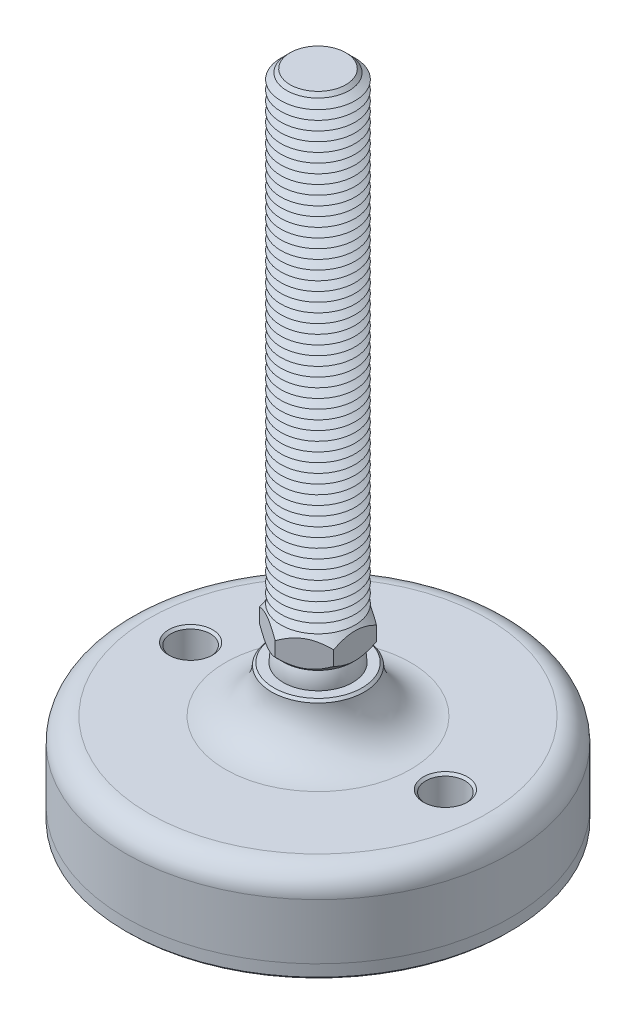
ISO-10303-21;
HEADER;
FILE_DESCRIPTION(('STEP AP214'),'2;1');
FILE_NAME('part.step','',(''),(''),'','','');
FILE_SCHEMA(('AUTOMOTIVE_DESIGN { 1 0 10303 214 1 1 1 1 }'));
ENDSEC;
DATA;
#1=APPLICATION_CONTEXT('core data for automotive mechanical design processes');
#2=APPLICATION_PROTOCOL_DEFINITION('international standard','automotive_design',2000,#1);
#3=PRODUCT_CONTEXT('',#1,'mechanical');
#4=PRODUCT('Part','Part','',(#3));
#5=PRODUCT_RELATED_PRODUCT_CATEGORY('part','',(#4));
#6=PRODUCT_DEFINITION_FORMATION('','',#4);
#7=PRODUCT_DEFINITION_CONTEXT('part definition',#1,'design');
#8=PRODUCT_DEFINITION('design','',#6,#7);
#9=PRODUCT_DEFINITION_SHAPE('','',#8);
#10=(LENGTH_UNIT() NAMED_UNIT(*) SI_UNIT(.MILLI.,.METRE.));
#11=(NAMED_UNIT(*) PLANE_ANGLE_UNIT() SI_UNIT($,.RADIAN.));
#12=(NAMED_UNIT(*) SI_UNIT($,.STERADIAN.) SOLID_ANGLE_UNIT());
#13=UNCERTAINTY_MEASURE_WITH_UNIT(LENGTH_MEASURE(1.E-05),#10,'distance_accuracy_value','');
#14=(GEOMETRIC_REPRESENTATION_CONTEXT(3) GLOBAL_UNCERTAINTY_ASSIGNED_CONTEXT((#13)) GLOBAL_UNIT_ASSIGNED_CONTEXT((#10,
#11,#12)) REPRESENTATION_CONTEXT('',''));
#15=CARTESIAN_POINT('',(0.,0.,0.));
#16=DIRECTION('',(0.,0.,1.));
#17=DIRECTION('',(1.,0.,0.));
#18=AXIS2_PLACEMENT_3D('',#15,#16,#17);
#19=CARTESIAN_POINT('',(0.,-27.,0.));
#20=DIRECTION('',(0.,1.,0.));
#21=DIRECTION('',(0.,0.,1.));
#22=AXIS2_PLACEMENT_3D('',#19,#20,#21);
#23=PLANE('',#22);
#24=CARTESIAN_POINT('',(-27.5,-27.,0.));
#25=DIRECTION('',(0.,1.,0.));
#26=DIRECTION('',(0.,0.,1.));
#27=AXIS2_PLACEMENT_3D('',#24,#25,#26);
#28=CIRCLE('',#27,4.25000000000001);
#29=CARTESIAN_POINT('',(-27.5,-27.,4.25000000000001));
#30=VERTEX_POINT('',#29);
#31=EDGE_CURVE('P0_E43',#30,#30,#28,.T.);
#32=ORIENTED_EDGE('',*,*,#31,.F.);
#33=EDGE_LOOP('',(#32));
#34=FACE_BOUND('',#33,.T.);
#35=CARTESIAN_POINT('',(27.5,-27.,0.));
#36=DIRECTION('',(0.,1.,0.));
#37=DIRECTION('',(0.,0.,1.));
#38=AXIS2_PLACEMENT_3D('',#35,#36,#37);
#39=CIRCLE('',#38,4.25000000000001);
#40=CARTESIAN_POINT('',(27.5,-27.,4.25000000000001));
#41=VERTEX_POINT('',#40);
#42=EDGE_CURVE('P0_E44',#41,#41,#39,.T.);
#43=ORIENTED_EDGE('',*,*,#42,.F.);
#44=EDGE_LOOP('',(#43));
#45=FACE_BOUND('',#44,.T.);
#46=CARTESIAN_POINT('',(0.,-27.,0.));
#47=DIRECTION('',(0.,1.,0.));
#48=DIRECTION('',(0.,0.,1.));
#49=AXIS2_PLACEMENT_3D('',#46,#47,#48);
#50=CIRCLE('',#49,41.5);
#51=CARTESIAN_POINT('',(0.,-27.,41.5));
#52=VERTEX_POINT('',#51);
#53=EDGE_CURVE('P0_E40',#52,#52,#50,.T.);
#54=ORIENTED_EDGE('',*,*,#53,.T.);
#55=EDGE_LOOP('',(#54));
#56=FACE_BOUND('',#55,.T.);
#57=ADVANCED_FACE('P0_F14',(#34,#45,#56),#23,.T.);
#58=CARTESIAN_POINT('',(0.,48.1654938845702,0.));
#59=DIRECTION('',(0.,1.,0.));
#60=DIRECTION('',(0.,0.,1.));
#61=AXIS2_PLACEMENT_3D('',#58,#59,#60);
#62=CYLINDRICAL_SURFACE('',#61,41.5);
#63=CARTESIAN_POINT('',(0.,-29.5,0.));
#64=DIRECTION('',(0.,-1.,0.));
#65=DIRECTION('',(0.,0.,-1.));
#66=AXIS2_PLACEMENT_3D('',#63,#64,#65);
#67=CIRCLE('',#66,41.5);
#68=CARTESIAN_POINT('',(0.,-29.5,-41.5));
#69=VERTEX_POINT('',#68);
#70=EDGE_CURVE('P0_E37',#69,#69,#67,.F.);
#71=ORIENTED_EDGE('',*,*,#70,.T.);
#72=EDGE_LOOP('',(#71));
#73=FACE_BOUND('',#72,.T.);
#74=ORIENTED_EDGE('',*,*,#53,.F.);
#75=EDGE_LOOP('',(#74));
#76=FACE_BOUND('',#75,.T.);
#77=ADVANCED_FACE('P0_F54',(#73,#76),#62,.T.);
#78=CARTESIAN_POINT('',(0.,-30.,41.5));
#79=DIRECTION('',(0.,-1.,0.));
#80=DIRECTION('',(0.,0.,-1.));
#81=AXIS2_PLACEMENT_3D('',#78,#79,#80);
#82=PLANE('',#81);
#83=CARTESIAN_POINT('',(27.5,-30.,0.));
#84=DIRECTION('',(0.,-1.,0.));
#85=DIRECTION('',(0.,0.,-1.));
#86=AXIS2_PLACEMENT_3D('',#83,#84,#85);
#87=CIRCLE('',#86,4.75);
#88=CARTESIAN_POINT('',(27.5,-30.,-4.75000000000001));
#89=VERTEX_POINT('',#88);
#90=EDGE_CURVE('P0_E25',#89,#89,#87,.F.);
#91=ORIENTED_EDGE('',*,*,#90,.T.);
#92=EDGE_LOOP('',(#91));
#93=FACE_BOUND('',#92,.T.);
#94=CARTESIAN_POINT('',(-27.5,-30.,0.));
#95=DIRECTION('',(0.,-1.,0.));
#96=DIRECTION('',(0.,0.,-1.));
#97=AXIS2_PLACEMENT_3D('',#94,#95,#96);
#98=CIRCLE('',#97,4.75);
#99=CARTESIAN_POINT('',(-27.5,-30.,-4.75));
#100=VERTEX_POINT('',#99);
#101=EDGE_CURVE('P0_E29',#100,#100,#98,.F.);
#102=ORIENTED_EDGE('',*,*,#101,.T.);
#103=EDGE_LOOP('',(#102));
#104=FACE_BOUND('',#103,.T.);
#105=CARTESIAN_POINT('',(0.,-30.,0.));
#106=DIRECTION('',(0.,-1.,0.));
#107=DIRECTION('',(0.,0.,-1.));
#108=AXIS2_PLACEMENT_3D('',#105,#106,#107);
#109=CIRCLE('',#108,41.);
#110=CARTESIAN_POINT('',(0.,-30.,-41.));
#111=VERTEX_POINT('',#110);
#112=EDGE_CURVE('P0_E34',#111,#111,#109,.T.);
#113=ORIENTED_EDGE('',*,*,#112,.T.);
#114=EDGE_LOOP('',(#113));
#115=FACE_BOUND('',#114,.T.);
#116=ADVANCED_FACE('P0_F61',(#93,#104,#115),#82,.T.);
#117=CARTESIAN_POINT('',(0.,-29.5,0.));
#118=DIRECTION('',(0.,1.,0.));
#119=DIRECTION('',(0.,0.,1.));
#120=AXIS2_PLACEMENT_3D('',#117,#118,#119);
#121=CONICAL_SURFACE('',#120,41.5,0.785398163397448);
#122=ORIENTED_EDGE('',*,*,#112,.F.);
#123=EDGE_LOOP('',(#122));
#124=FACE_BOUND('',#123,.T.);
#125=ORIENTED_EDGE('',*,*,#70,.F.);
#126=EDGE_LOOP('',(#125));
#127=FACE_BOUND('',#126,.T.);
#128=ADVANCED_FACE('P0_F68',(#124,#127),#121,.T.);
#129=CARTESIAN_POINT('',(27.5,-30.,0.));
#130=DIRECTION('',(0.,1.,0.));
#131=DIRECTION('',(0.,0.,1.));
#132=AXIS2_PLACEMENT_3D('',#129,#130,#131);
#133=CYLINDRICAL_SURFACE('',#132,4.25000000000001);
#134=CARTESIAN_POINT('',(27.5,-29.5,0.));
#135=DIRECTION('',(0.,-1.,0.));
#136=DIRECTION('',(0.,0.,-1.));
#137=AXIS2_PLACEMENT_3D('',#134,#135,#136);
#138=CIRCLE('',#137,4.25000000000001);
#139=CARTESIAN_POINT('',(27.5,-29.5,-4.25000000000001));
#140=VERTEX_POINT('',#139);
#141=EDGE_CURVE('P0_E21',#140,#140,#138,.T.);
#142=ORIENTED_EDGE('',*,*,#141,.T.);
#143=EDGE_LOOP('',(#142));
#144=FACE_BOUND('',#143,.T.);
#145=ORIENTED_EDGE('',*,*,#42,.T.);
#146=EDGE_LOOP('',(#145));
#147=FACE_BOUND('',#146,.T.);
#148=ADVANCED_FACE('P0_F74',(#144,#147),#133,.F.);
#149=CARTESIAN_POINT('',(-27.5,-30.,0.));
#150=DIRECTION('',(0.,1.,0.));
#151=DIRECTION('',(0.,0.,1.));
#152=AXIS2_PLACEMENT_3D('',#149,#150,#151);
#153=CYLINDRICAL_SURFACE('',#152,4.25000000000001);
#154=CARTESIAN_POINT('',(-27.5,-29.5,0.));
#155=DIRECTION('',(0.,-1.,0.));
#156=DIRECTION('',(0.,0.,-1.));
#157=AXIS2_PLACEMENT_3D('',#154,#155,#156);
#158=CIRCLE('',#157,4.25000000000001);
#159=CARTESIAN_POINT('',(-27.5,-29.5,-4.25000000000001));
#160=VERTEX_POINT('',#159);
#161=EDGE_CURVE('P0_E10',#160,#160,#158,.T.);
#162=ORIENTED_EDGE('',*,*,#161,.T.);
#163=EDGE_LOOP('',(#162));
#164=FACE_BOUND('',#163,.T.);
#165=ORIENTED_EDGE('',*,*,#31,.T.);
#166=EDGE_LOOP('',(#165));
#167=FACE_BOUND('',#166,.T.);
#168=ADVANCED_FACE('P0_F50',(#164,#167),#153,.F.);
#169=CARTESIAN_POINT('',(27.5,-30.,0.));
#170=DIRECTION('',(0.,-1.,0.));
#171=DIRECTION('',(0.,0.,-1.));
#172=AXIS2_PLACEMENT_3D('',#169,#170,#171);
#173=CONICAL_SURFACE('',#172,4.75,0.785398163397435);
#174=ORIENTED_EDGE('',*,*,#141,.F.);
#175=EDGE_LOOP('',(#174));
#176=FACE_BOUND('',#175,.T.);
#177=ORIENTED_EDGE('',*,*,#90,.F.);
#178=EDGE_LOOP('',(#177));
#179=FACE_BOUND('',#178,.T.);
#180=ADVANCED_FACE('P0_F76',(#176,#179),#173,.F.);
#181=CARTESIAN_POINT('',(-27.5,-30.,0.));
#182=DIRECTION('',(0.,-1.,0.));
#183=DIRECTION('',(0.,0.,-1.));
#184=AXIS2_PLACEMENT_3D('',#181,#182,#183);
#185=CONICAL_SURFACE('',#184,4.75,0.785398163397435);
#186=ORIENTED_EDGE('',*,*,#161,.F.);
#187=EDGE_LOOP('',(#186));
#188=FACE_BOUND('',#187,.T.);
#189=ORIENTED_EDGE('',*,*,#101,.F.);
#190=EDGE_LOOP('',(#189));
#191=FACE_BOUND('',#190,.T.);
#192=ADVANCED_FACE('P0_F16',(#188,#191),#185,.F.);
#193=CLOSED_SHELL('',(#57,#77,#116,#128,#148,#168,#180,#192));
#194=MANIFOLD_SOLID_BREP('P0_B1',#193);
#195=CARTESIAN_POINT('',(0.,3.75,0.));
#196=DIRECTION('',(0.,1.,0.));
#197=DIRECTION('',(0.,0.,1.));
#198=AXIS2_PLACEMENT_3D('',#195,#196,#197);
#199=PLANE('',#198);
#200=CARTESIAN_POINT('',(0.,3.75,0.));
#201=DIRECTION('',(0.,1.,0.));
#202=DIRECTION('',(0.,0.,1.));
#203=AXIS2_PLACEMENT_3D('',#200,#201,#202);
#204=CIRCLE('',#203,7.41889346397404);
#205=CARTESIAN_POINT('',(0.,3.75,7.41889346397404));
#206=VERTEX_POINT('',#205);
#207=EDGE_CURVE('P1_E213',#206,#206,#204,.T.);
#208=ORIENTED_EDGE('',*,*,#207,.F.);
#209=EDGE_LOOP('',(#208));
#210=FACE_BOUND('',#209,.T.);
#211=CARTESIAN_POINT('',(0.,3.75,0.));
#212=DIRECTION('',(0.,1.,0.));
#213=DIRECTION('',(0.,0.,1.));
#214=AXIS2_PLACEMENT_3D('',#211,#212,#213);
#215=CIRCLE('',#214,6.49519052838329);
#216=CARTESIAN_POINT('',(0.,3.75,6.49519052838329));
#217=VERTEX_POINT('',#216);
#218=EDGE_CURVE('P1_E25',#217,#217,#215,.F.);
#219=ORIENTED_EDGE('',*,*,#218,.F.);
#220=EDGE_LOOP('',(#219));
#221=FACE_BOUND('',#220,.T.);
#222=ADVANCED_FACE('P1_F16',(#210,#221),#199,.F.);
#223=CARTESIAN_POINT('',(0.,0.,0.));
#224=DIRECTION('',(0.,1.,0.));
#225=DIRECTION('',(0.,0.,-1.));
#226=AXIS2_PLACEMENT_3D('',#223,#224,#225);
#227=SPHERICAL_SURFACE('',#226,7.5);
#228=ORIENTED_EDGE('',*,*,#218,.T.);
#229=EDGE_LOOP('',(#228));
#230=FACE_BOUND('',#229,.T.);
#231=ADVANCED_FACE('P1_F203',(#230),#227,.T.);
#232=CARTESIAN_POINT('',(0.,3.75,0.));
#233=DIRECTION('',(0.,1.,0.));
#234=DIRECTION('',(0.,0.,1.));
#235=AXIS2_PLACEMENT_3D('',#232,#233,#234);
#236=CONICAL_SURFACE('',#235,7.41889346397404,0.785398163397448);
#237=ORIENTED_EDGE('',*,*,#207,.T.);
#238=EDGE_LOOP('',(#237));
#239=FACE_BOUND('',#238,.T.);
#240=CARTESIAN_POINT('',(-8.,8.67915108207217,-9.40607272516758));
#241=CARTESIAN_POINT('',(-8.,8.50538061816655,-9.17789983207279));
#242=CARTESIAN_POINT('',(-8.,8.33323236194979,-8.94847140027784));
#243=CARTESIAN_POINT('',(-8.,7.99291342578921,-8.48659991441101));
#244=CARTESIAN_POINT('',(-8.,7.82474372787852,-8.2541561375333));
#245=CARTESIAN_POINT('',(-8.,7.49191829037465,-7.78405005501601));
#246=CARTESIAN_POINT('',(-8.,7.32729980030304,-7.54636128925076));
#247=CARTESIAN_POINT('',(-8.,7.00401259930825,-7.066984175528));
#248=CARTESIAN_POINT('',(-8.,6.8453434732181,-6.82529610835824));
#249=CARTESIAN_POINT('',(-8.,6.52599353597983,-6.32262937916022));
#250=CARTESIAN_POINT('',(-8.,6.36576297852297,-6.06136321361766));
#251=CARTESIAN_POINT('',(-8.,6.05556462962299,-5.53271317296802));
#252=CARTESIAN_POINT('',(-8.,5.90559851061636,-5.26532831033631));
#253=CARTESIAN_POINT('',(-8.,5.61914583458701,-4.72442075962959));
#254=CARTESIAN_POINT('',(-8.,5.48261965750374,-4.45091921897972));
#255=CARTESIAN_POINT('',(-8.,5.22610459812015,-3.8963297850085));
#256=CARTESIAN_POINT('',(-8.,5.10610808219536,-3.61524546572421));
#257=CARTESIAN_POINT('',(-8.,4.89671738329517,-3.07036571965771));
#258=CARTESIAN_POINT('',(-8.,4.80554986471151,-2.80725883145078));
#259=CARTESIAN_POINT('',(-8.,4.64429812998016,-2.27454068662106));
#260=CARTESIAN_POINT('',(-8.,4.57421531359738,-2.00492899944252));
#261=CARTESIAN_POINT('',(-8.,4.46001937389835,-1.46539071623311));
#262=CARTESIAN_POINT('',(-8.,4.41544920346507,-1.19556248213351));
#263=CARTESIAN_POINT('',(-8.,4.35317465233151,-0.652806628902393));
#264=CARTESIAN_POINT('',(-8.,4.33546523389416,-0.379879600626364));
#265=CARTESIAN_POINT('',(-8.,4.3283167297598,0.155555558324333));
#266=CARTESIAN_POINT('',(-8.,4.33778869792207,0.418049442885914));
#267=CARTESIAN_POINT('',(-8.,4.38202991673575,0.940882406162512));
#268=CARTESIAN_POINT('',(-8.,4.41680155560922,1.2012212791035));
#269=CARTESIAN_POINT('',(-8.,4.51030475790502,1.72226548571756));
#270=CARTESIAN_POINT('',(-8.,4.56945097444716,1.9828951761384));
#271=CARTESIAN_POINT('',(-8.,4.7084911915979,2.498449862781));
#272=CARTESIAN_POINT('',(-8.,4.78838370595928,2.75337526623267));
#273=CARTESIAN_POINT('',(-8.,4.97226877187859,3.27629811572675));
#274=CARTESIAN_POINT('',(-8.,5.07763590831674,3.54380699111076));
#275=CARTESIAN_POINT('',(-8.,5.3045984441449,4.07191058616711));
#276=CARTESIAN_POINT('',(-8.,5.4262012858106,4.33250206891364));
#277=CARTESIAN_POINT('',(-8.,5.68274705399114,4.84802310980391));
#278=CARTESIAN_POINT('',(-8.,5.81773148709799,5.10293184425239));
#279=CARTESIAN_POINT('',(-8.,6.09806326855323,5.60689577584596));
#280=CARTESIAN_POINT('',(-8.,6.24340899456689,5.85595188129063));
#281=CARTESIAN_POINT('',(-8.,6.53502315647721,6.33676586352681));
#282=CARTESIAN_POINT('',(-8.,6.68088884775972,6.56876930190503));
#283=CARTESIAN_POINT('',(-8.,6.97879220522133,7.0287915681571));
#284=CARTESIAN_POINT('',(-8.,7.13083033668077,7.2568100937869));
#285=CARTESIAN_POINT('',(-8.,7.43872962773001,7.70754250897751));
#286=CARTESIAN_POINT('',(-8.,7.59454998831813,7.93028436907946));
#287=CARTESIAN_POINT('',(-8.,7.9103399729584,8.37271804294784));
#288=CARTESIAN_POINT('',(-8.,8.07030844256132,8.59241067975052));
#289=CARTESIAN_POINT('',(-8.,8.23197385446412,8.81082532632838));
#290=B_SPLINE_CURVE_WITH_KNOTS('',3,(#240,#241,#242,#243,#244,#245,#246,#247,#248,#249,#250,
#251,#252,#253,#254,#255,#256,#257,#258,#259,#260,#261,#262,#263,#264,#265,#266,#267,#268,#269,
#270,#271,#272,#273,#274,#275,#276,#277,#278,#279,#280,#281,#282,#283,#284,#285,#286,#287,#288,
#289),.UNSPECIFIED.,.F.,.F.,(4,2,2,2,2,2,2,2,2,2,2,2,2,2,2,2,2,2,2,2,2,2,2,2,4),(0.,
0.860441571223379,1.72109335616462,2.58840332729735,3.4556526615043,4.3749240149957,
5.2943447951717,6.21096847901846,7.12716742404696,7.96180281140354,8.7964935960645,
9.6157214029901,10.4347955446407,11.2215193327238,12.0083173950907,12.8090921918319,
13.6098096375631,14.471679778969,15.3339463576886,16.1989765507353,17.0638715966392,
17.8859014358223,18.7079933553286,19.5234450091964,20.3386721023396),.UNSPECIFIED.);
#291=CARTESIAN_POINT('',(-8.,5.56871084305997,-4.61880215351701));
#292=VERTEX_POINT('',#291);
#293=CARTESIAN_POINT('',(-8.,5.56871084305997,4.61880215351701));
#294=VERTEX_POINT('',#293);
#295=EDGE_CURVE('P1_E187',#292,#294,#290,.T.);
#296=ORIENTED_EDGE('',*,*,#295,.F.);
#297=CARTESIAN_POINT('',(0.000200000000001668,5.56882631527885,-9.23771977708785));
#298=CARTESIAN_POINT('',(-0.137352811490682,5.48941910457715,-9.15830362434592));
#299=CARTESIAN_POINT('',(-0.275962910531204,5.41244881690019,-9.07827704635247));
#300=CARTESIAN_POINT('',(-0.55550509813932,5.2641233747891,-8.91688328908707));
#301=CARTESIAN_POINT('',(-0.696438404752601,5.19277128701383,-8.83551540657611));
#302=CARTESIAN_POINT('',(-1.12434348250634,4.98764582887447,-8.58846429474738));
#303=CARTESIAN_POINT('',(-1.41493761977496,4.86367829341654,-8.42068969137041));
#304=CARTESIAN_POINT('',(-2.00094388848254,4.65139259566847,-8.08235881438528));
#305=CARTESIAN_POINT('',(-2.29620625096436,4.56253963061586,-7.91188900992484));
#306=CARTESIAN_POINT('',(-2.74395385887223,4.45975870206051,-7.65338180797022));
#307=CARTESIAN_POINT('',(-2.89386225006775,4.43059522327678,-7.5668321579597));
#308=CARTESIAN_POINT('',(-3.19494827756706,4.38309436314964,-7.39300005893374));
#309=CARTESIAN_POINT('',(-3.34612572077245,4.36475536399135,-7.30571772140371));
#310=CARTESIAN_POINT('',(-3.71452735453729,4.33400721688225,-7.09302093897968));
#311=CARTESIAN_POINT('',(-3.93214848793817,4.32755588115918,-6.96737731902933));
#312=CARTESIAN_POINT('',(-4.36699849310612,4.33838546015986,-6.71631655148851));
#313=CARTESIAN_POINT('',(-4.58422720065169,4.3556746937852,-6.59089949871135));
#314=CARTESIAN_POINT('',(-5.01663658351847,4.41296627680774,-6.3412478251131));
#315=CARTESIAN_POINT('',(-5.23181469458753,4.45299402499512,-6.21701468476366));
#316=CARTESIAN_POINT('',(-5.65847251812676,4.55358648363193,-5.97068367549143));
#317=CARTESIAN_POINT('',(-5.86995251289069,4.61414961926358,-5.84858564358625));
#318=CARTESIAN_POINT('',(-6.24536139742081,4.73874447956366,-5.63184322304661));
#319=CARTESIAN_POINT('',(-6.41012167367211,4.79949896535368,-5.53671883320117));
#320=CARTESIAN_POINT('',(-6.73668469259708,4.93079799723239,-5.34817758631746));
#321=CARTESIAN_POINT('',(-6.89848734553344,5.00134283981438,-5.25476078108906));
#322=CARTESIAN_POINT('',(-7.21862548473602,5.1506413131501,-5.06992894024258));
#323=CARTESIAN_POINT('',(-7.37697007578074,5.22936912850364,-4.97850864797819));
#324=CARTESIAN_POINT('',(-7.69072726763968,5.39400001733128,-4.79736084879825));
#325=CARTESIAN_POINT('',(-7.84614159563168,5.47989869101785,-4.70763234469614));
#326=CARTESIAN_POINT('',(-8.0002,5.56882631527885,-4.61868668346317));
#327=B_SPLINE_CURVE_WITH_KNOTS('',3,(#297,#298,#299,#300,#301,#302,#303,#304,#305,#306,#307,
#308,#309,#310,#311,#312,#313,#314,#315,#316,#317,#318,#319,#320,#321,#322,#323,#324,#325,#326),
.UNSPECIFIED.,.F.,.F.,(4,2,2,2,2,2,2,2,2,2,2,2,2,2,4),(0.,0.53269658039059,1.06568194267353,
2.13740664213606,3.19211397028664,3.71843331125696,4.24467396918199,4.99761238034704,
5.75081469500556,6.50485999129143,7.25884747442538,7.85770857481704,8.45658781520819,
9.05363199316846,9.65031250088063),.UNSPECIFIED.);
#328=CARTESIAN_POINT('',(0.,5.56871084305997,-9.23760430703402));
#329=VERTEX_POINT('',#328);
#330=EDGE_CURVE('P1_E181',#329,#292,#327,.T.);
#331=ORIENTED_EDGE('',*,*,#330,.F.);
#332=CARTESIAN_POINT('',(8.0002,5.56882631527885,-4.61868668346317));
#333=CARTESIAN_POINT('',(7.86264718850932,5.48941910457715,-4.69810283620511));
#334=CARTESIAN_POINT('',(7.72403708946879,5.4124488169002,-4.77812941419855));
#335=CARTESIAN_POINT('',(7.44449490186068,5.2641233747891,-4.93952317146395));
#336=CARTESIAN_POINT('',(7.3035615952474,5.19277128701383,-5.02089105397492));
#337=CARTESIAN_POINT('',(6.87565651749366,4.98764582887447,-5.26794216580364));
#338=CARTESIAN_POINT('',(6.58506238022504,4.86367829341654,-5.43571676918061));
#339=CARTESIAN_POINT('',(5.99905611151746,4.65139259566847,-5.77404764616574));
#340=CARTESIAN_POINT('',(5.70379374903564,4.56253963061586,-5.94451745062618));
#341=CARTESIAN_POINT('',(5.25604614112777,4.45975870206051,-6.2030246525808));
#342=CARTESIAN_POINT('',(5.10613774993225,4.43059522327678,-6.28957430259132));
#343=CARTESIAN_POINT('',(4.80505172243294,4.38309436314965,-6.46340640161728));
#344=CARTESIAN_POINT('',(4.65387427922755,4.36475536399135,-6.55068873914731));
#345=CARTESIAN_POINT('',(4.28547264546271,4.33400721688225,-6.76338552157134));
#346=CARTESIAN_POINT('',(4.06785151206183,4.32755588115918,-6.88902914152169));
#347=CARTESIAN_POINT('',(3.63300150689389,4.33838546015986,-7.14008990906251));
#348=CARTESIAN_POINT('',(3.41577279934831,4.3556746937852,-7.26550696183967));
#349=CARTESIAN_POINT('',(2.98336341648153,4.41296627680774,-7.51515863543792));
#350=CARTESIAN_POINT('',(2.76818530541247,4.45299402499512,-7.63939177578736));
#351=CARTESIAN_POINT('',(2.34152748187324,4.55358648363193,-7.88572278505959));
#352=CARTESIAN_POINT('',(2.13004748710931,4.61414961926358,-8.00782081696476));
#353=CARTESIAN_POINT('',(1.75463860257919,4.73874447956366,-8.22456323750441));
#354=CARTESIAN_POINT('',(1.58987832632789,4.79949896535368,-8.31968762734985));
#355=CARTESIAN_POINT('',(1.26331530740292,4.93079799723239,-8.50822887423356));
#356=CARTESIAN_POINT('',(1.10151265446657,5.00134283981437,-8.60164567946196));
#357=CARTESIAN_POINT('',(0.781374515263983,5.1506413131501,-8.78647752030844));
#358=CARTESIAN_POINT('',(0.623029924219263,5.22936912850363,-8.87789781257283));
#359=CARTESIAN_POINT('',(0.309272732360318,5.39400001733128,-9.05904561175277));
#360=CARTESIAN_POINT('',(0.153858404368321,5.47989869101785,-9.14877411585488));
#361=CARTESIAN_POINT('',(-0.000199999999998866,5.56882631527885,-9.23771977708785));
#362=B_SPLINE_CURVE_WITH_KNOTS('',3,(#332,#333,#334,#335,#336,#337,#338,#339,#340,#341,#342,
#343,#344,#345,#346,#347,#348,#349,#350,#351,#352,#353,#354,#355,#356,#357,#358,#359,#360,#361),
.UNSPECIFIED.,.F.,.F.,(4,2,2,2,2,2,2,2,2,2,2,2,2,2,4),(0.,0.532696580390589,1.06568194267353,
2.13740664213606,3.19211397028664,3.71843331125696,4.24467396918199,4.99761238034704,
5.75081469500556,6.50485999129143,7.25884747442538,7.85770857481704,8.45658781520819,
9.05363199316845,9.65031250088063),.UNSPECIFIED.);
#363=CARTESIAN_POINT('',(8.,5.56871084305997,-4.61880215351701));
#364=VERTEX_POINT('',#363);
#365=EDGE_CURVE('P1_E169',#364,#329,#362,.T.);
#366=ORIENTED_EDGE('',*,*,#365,.F.);
#367=CARTESIAN_POINT('',(8.,8.67915108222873,-9.40607272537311));
#368=CARTESIAN_POINT('',(8.,8.50538061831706,-9.17789983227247));
#369=CARTESIAN_POINT('',(8.,8.33323236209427,-8.94847140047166));
#370=CARTESIAN_POINT('',(8.,7.99291342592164,-8.48659991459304));
#371=CARTESIAN_POINT('',(8.,7.82474372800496,-8.25415613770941));
#372=CARTESIAN_POINT('',(8.,7.49191829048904,-7.78405005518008));
#373=CARTESIAN_POINT('',(8.,7.32729980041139,-7.54636128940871));
#374=CARTESIAN_POINT('',(8.,7.00401259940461,-7.0669841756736));
#375=CARTESIAN_POINT('',(8.,6.84534347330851,-6.82529610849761));
#376=CARTESIAN_POINT('',(8.,6.52599353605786,-6.32262937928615));
#377=CARTESIAN_POINT('',(8.,6.36576297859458,-6.06136321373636));
#378=CARTESIAN_POINT('',(8.,6.05556462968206,-5.53271317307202));
#379=CARTESIAN_POINT('',(8.,5.90559851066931,-5.26532831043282));
#380=CARTESIAN_POINT('',(8.,5.61914583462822,-4.72442075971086));
#381=CARTESIAN_POINT('',(8.,5.48261965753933,-4.45091921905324));
#382=CARTESIAN_POINT('',(8.,5.22610459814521,-3.8963297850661));
#383=CARTESIAN_POINT('',(8.,5.10610808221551,-3.61524546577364));
#384=CARTESIAN_POINT('',(8.,4.89671738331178,-3.07036571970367));
#385=CARTESIAN_POINT('',(8.,4.80554986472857,-2.8072588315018));
#386=CARTESIAN_POINT('',(8.,4.6442981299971,-2.27454068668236));
#387=CARTESIAN_POINT('',(8.,4.57421531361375,-2.00492899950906));
#388=CARTESIAN_POINT('',(8.,4.46001937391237,-1.46539071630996));
#389=CARTESIAN_POINT('',(8.,4.41544920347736,-1.19556248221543));
#390=CARTESIAN_POINT('',(8.,4.35317465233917,-0.65280662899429));
#391=CARTESIAN_POINT('',(8.,4.33546523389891,-0.379879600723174));
#392=CARTESIAN_POINT('',(8.,4.32831672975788,0.155555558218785));
#393=CARTESIAN_POINT('',(8.,4.33778869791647,0.41804944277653));
#394=CARTESIAN_POINT('',(8.,4.38202991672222,0.940882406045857));
#395=CARTESIAN_POINT('',(8.,4.41680155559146,1.20122127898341));
#396=CARTESIAN_POINT('',(8.,4.51030475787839,1.72226548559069));
#397=CARTESIAN_POINT('',(8.,4.56945097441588,1.9828951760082));
#398=CARTESIAN_POINT('',(8.,4.70849119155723,2.49844986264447));
#399=CARTESIAN_POINT('',(8.,4.78838370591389,2.75337526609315));
#400=CARTESIAN_POINT('',(8.,4.97226877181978,3.27629811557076));
#401=CARTESIAN_POINT('',(8.,5.07763590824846,3.5438069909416));
#402=CARTESIAN_POINT('',(8.,5.30459844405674,4.07191058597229));
#403=CARTESIAN_POINT('',(8.,5.42620128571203,4.33250206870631));
#404=CARTESIAN_POINT('',(8.,5.68274705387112,4.84802310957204));
#405=CARTESIAN_POINT('',(8.,5.81773148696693,5.10293184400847));
#406=CARTESIAN_POINT('',(8.,6.09806326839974,5.60689577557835));
#407=CARTESIAN_POINT('',(8.,6.24340899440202,5.85595188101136));
#408=CARTESIAN_POINT('',(8.,6.53502315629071,6.33676586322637));
#409=CARTESIAN_POINT('',(8.,6.68088884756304,6.56876930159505));
#410=CARTESIAN_POINT('',(8.,6.97879220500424,7.02879156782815));
#411=CARTESIAN_POINT('',(8.,7.13083033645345,7.25681009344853));
#412=CARTESIAN_POINT('',(8.,7.43872962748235,7.70754250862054));
#413=CARTESIAN_POINT('',(8.,7.59454998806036,7.93028436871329));
#414=CARTESIAN_POINT('',(8.,7.91033997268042,8.37271804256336));
#415=CARTESIAN_POINT('',(8.,8.07030844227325,8.59241067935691));
#416=CARTESIAN_POINT('',(8.,8.23197385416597,8.81082532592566));
#417=B_SPLINE_CURVE_WITH_KNOTS('',3,(#367,#368,#369,#370,#371,#372,#373,#374,#375,#376,#377,
#378,#379,#380,#381,#382,#383,#384,#385,#386,#387,#388,#389,#390,#391,#392,#393,#394,#395,#396,
#397,#398,#399,#400,#401,#402,#403,#404,#405,#406,#407,#408,#409,#410,#411,#412,#413,#414,#415,
#416),.UNSPECIFIED.,.F.,.F.,(4,2,2,2,2,2,2,2,2,2,2,2,2,2,2,2,2,2,2,2,2,2,2,2,4),(0.,
0.860441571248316,1.7210933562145,2.58840332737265,3.45565266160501,4.37492401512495,
5.2943447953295,6.21096847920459,7.12716742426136,7.96180281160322,8.79649359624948,
9.61572140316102,10.4347955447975,11.2215193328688,12.0083173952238,12.8090921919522,
13.6098096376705,14.4716797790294,15.3339463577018,16.1989765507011,17.0638715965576,
17.8859014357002,18.7079933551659,19.5234450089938,20.338672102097),.UNSPECIFIED.);
#418=CARTESIAN_POINT('',(8.,5.56871084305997,4.61880215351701));
#419=VERTEX_POINT('',#418);
#420=EDGE_CURVE('P1_E71',#419,#364,#417,.F.);
#421=ORIENTED_EDGE('',*,*,#420,.F.);
#422=CARTESIAN_POINT('',(-0.000199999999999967,5.56882631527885,9.23771977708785));
#423=CARTESIAN_POINT('',(0.137352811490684,5.48941910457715,9.15830362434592));
#424=CARTESIAN_POINT('',(0.275962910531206,5.41244881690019,9.07827704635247));
#425=CARTESIAN_POINT('',(0.555505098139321,5.2641233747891,8.91688328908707));
#426=CARTESIAN_POINT('',(0.696438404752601,5.19277128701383,8.83551540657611));
#427=CARTESIAN_POINT('',(1.12434348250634,4.98764582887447,8.58846429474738));
#428=CARTESIAN_POINT('',(1.41493761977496,4.86367829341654,8.42068969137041));
#429=CARTESIAN_POINT('',(2.00094388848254,4.65139259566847,8.08235881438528));
#430=CARTESIAN_POINT('',(2.29620625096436,4.56253963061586,7.91188900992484));
#431=CARTESIAN_POINT('',(2.74395385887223,4.45975870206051,7.65338180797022));
#432=CARTESIAN_POINT('',(2.89386225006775,4.43059522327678,7.5668321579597));
#433=CARTESIAN_POINT('',(3.19494827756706,4.38309436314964,7.39300005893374));
#434=CARTESIAN_POINT('',(3.34612572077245,4.36475536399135,7.30571772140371));
#435=CARTESIAN_POINT('',(3.71452735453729,4.33400721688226,7.09302093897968));
#436=CARTESIAN_POINT('',(3.93214848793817,4.32755588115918,6.96737731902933));
#437=CARTESIAN_POINT('',(4.36699849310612,4.33838546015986,6.71631655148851));
#438=CARTESIAN_POINT('',(4.58422720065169,4.3556746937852,6.59089949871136));
#439=CARTESIAN_POINT('',(5.01663658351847,4.41296627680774,6.3412478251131));
#440=CARTESIAN_POINT('',(5.23181469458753,4.45299402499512,6.21701468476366));
#441=CARTESIAN_POINT('',(5.65847251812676,4.55358648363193,5.97068367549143));
#442=CARTESIAN_POINT('',(5.86995251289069,4.61414961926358,5.84858564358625));
#443=CARTESIAN_POINT('',(6.24536139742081,4.73874447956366,5.63184322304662));
#444=CARTESIAN_POINT('',(6.41012167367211,4.79949896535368,5.53671883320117));
#445=CARTESIAN_POINT('',(6.73668469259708,4.93079799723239,5.34817758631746));
#446=CARTESIAN_POINT('',(6.89848734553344,5.00134283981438,5.25476078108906));
#447=CARTESIAN_POINT('',(7.21862548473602,5.1506413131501,5.06992894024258));
#448=CARTESIAN_POINT('',(7.37697007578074,5.22936912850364,4.97850864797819));
#449=CARTESIAN_POINT('',(7.69072726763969,5.39400001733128,4.79736084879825));
#450=CARTESIAN_POINT('',(7.84614159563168,5.47989869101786,4.70763234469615));
#451=CARTESIAN_POINT('',(8.0002,5.56882631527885,4.61868668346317));
#452=B_SPLINE_CURVE_WITH_KNOTS('',3,(#422,#423,#424,#425,#426,#427,#428,#429,#430,#431,#432,
#433,#434,#435,#436,#437,#438,#439,#440,#441,#442,#443,#444,#445,#446,#447,#448,#449,#450,#451),
.UNSPECIFIED.,.F.,.F.,(4,2,2,2,2,2,2,2,2,2,2,2,2,2,4),(0.,0.532696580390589,1.06568194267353,
2.13740664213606,3.19211397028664,3.71843331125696,4.24467396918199,4.99761238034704,
5.75081469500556,6.50485999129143,7.25884747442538,7.85770857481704,8.45658781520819,
9.05363199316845,9.65031250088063),.UNSPECIFIED.);
#453=CARTESIAN_POINT('',(0.,5.56871084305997,9.23760430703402));
#454=VERTEX_POINT('',#453);
#455=EDGE_CURVE('P1_E68',#454,#419,#452,.T.);
#456=ORIENTED_EDGE('',*,*,#455,.F.);
#457=CARTESIAN_POINT('',(-8.0002,5.56882631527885,4.61868668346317));
#458=CARTESIAN_POINT('',(-7.86264718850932,5.48941910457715,4.6981028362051));
#459=CARTESIAN_POINT('',(-7.7240370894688,5.41244881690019,4.77812941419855));
#460=CARTESIAN_POINT('',(-7.44449490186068,5.2641233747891,4.93952317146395));
#461=CARTESIAN_POINT('',(-7.3035615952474,5.19277128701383,5.02089105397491));
#462=CARTESIAN_POINT('',(-6.87565651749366,4.98764582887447,5.26794216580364));
#463=CARTESIAN_POINT('',(-6.58506238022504,4.86367829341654,5.43571676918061));
#464=CARTESIAN_POINT('',(-5.99905611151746,4.65139259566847,5.77404764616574));
#465=CARTESIAN_POINT('',(-5.70379374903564,4.56253963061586,5.94451745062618));
#466=CARTESIAN_POINT('',(-5.25604614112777,4.45975870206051,6.2030246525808));
#467=CARTESIAN_POINT('',(-5.10613774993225,4.43059522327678,6.28957430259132));
#468=CARTESIAN_POINT('',(-4.80505172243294,4.38309436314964,6.46340640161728));
#469=CARTESIAN_POINT('',(-4.65387427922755,4.36475536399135,6.55068873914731));
#470=CARTESIAN_POINT('',(-4.28547264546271,4.33400721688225,6.76338552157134));
#471=CARTESIAN_POINT('',(-4.06785151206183,4.32755588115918,6.88902914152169));
#472=CARTESIAN_POINT('',(-3.63300150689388,4.33838546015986,7.14008990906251));
#473=CARTESIAN_POINT('',(-3.4157727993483,4.3556746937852,7.26550696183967));
#474=CARTESIAN_POINT('',(-2.98336341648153,4.41296627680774,7.51515863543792));
#475=CARTESIAN_POINT('',(-2.76818530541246,4.45299402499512,7.63939177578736));
#476=CARTESIAN_POINT('',(-2.34152748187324,4.55358648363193,7.88572278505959));
#477=CARTESIAN_POINT('',(-2.13004748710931,4.61414961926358,8.00782081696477));
#478=CARTESIAN_POINT('',(-1.75463860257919,4.73874447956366,8.22456323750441));
#479=CARTESIAN_POINT('',(-1.58987832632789,4.79949896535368,8.31968762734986));
#480=CARTESIAN_POINT('',(-1.26331530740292,4.93079799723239,8.50822887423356));
#481=CARTESIAN_POINT('',(-1.10151265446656,5.00134283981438,8.60164567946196));
#482=CARTESIAN_POINT('',(-0.781374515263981,5.1506413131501,8.78647752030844));
#483=CARTESIAN_POINT('',(-0.623029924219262,5.22936912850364,8.87789781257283));
#484=CARTESIAN_POINT('',(-0.309272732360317,5.39400001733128,9.05904561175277));
#485=CARTESIAN_POINT('',(-0.15385840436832,5.47989869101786,9.14877411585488));
#486=CARTESIAN_POINT('',(0.000199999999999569,5.56882631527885,9.23771977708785));
#487=B_SPLINE_CURVE_WITH_KNOTS('',3,(#457,#458,#459,#460,#461,#462,#463,#464,#465,#466,#467,
#468,#469,#470,#471,#472,#473,#474,#475,#476,#477,#478,#479,#480,#481,#482,#483,#484,#485,#486),
.UNSPECIFIED.,.F.,.F.,(4,2,2,2,2,2,2,2,2,2,2,2,2,2,4),(0.,0.532696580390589,1.06568194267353,
2.13740664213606,3.19211397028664,3.71843331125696,4.244673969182,4.99761238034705,
5.75081469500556,6.50485999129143,7.25884747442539,7.85770857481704,8.4565878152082,
9.05363199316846,9.65031250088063),.UNSPECIFIED.);
#488=EDGE_CURVE('P1_E40',#294,#454,#487,.T.);
#489=ORIENTED_EDGE('',*,*,#488,.F.);
#490=EDGE_LOOP('',(#296,#331,#366,#421,#456,#489));
#491=FACE_BOUND('',#490,.T.);
#492=ADVANCED_FACE('P1_F69',(#239,#491),#236,.T.);
#493=CARTESIAN_POINT('',(-8.,11.,-4.61880215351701));
#494=DIRECTION('',(1.,0.,0.));
#495=DIRECTION('',(0.,0.,-1.));
#496=AXIS2_PLACEMENT_3D('',#493,#494,#495);
#497=PLANE('',#496);
#498=DIRECTION('',(0.,-1.,0.));
#499=VECTOR('',#498,1.);
#500=CARTESIAN_POINT('',(-8.,11.,4.61880215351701));
#501=LINE('',#500,#499);
#502=CARTESIAN_POINT('',(-8.,8.6905989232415,4.61880215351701));
#503=VERTEX_POINT('',#502);
#504=EDGE_CURVE('P1_E84',#503,#294,#501,.T.);
#505=ORIENTED_EDGE('',*,*,#504,.F.);
#506=CARTESIAN_POINT('',(-8.,5.72751350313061,-9.21177669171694));
#507=CARTESIAN_POINT('',(-8.,5.89682366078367,-8.98748005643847));
#508=CARTESIAN_POINT('',(-8.,6.06449721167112,-8.76192759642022));
#509=CARTESIAN_POINT('',(-8.,6.39583833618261,-8.30781564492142));
#510=CARTESIAN_POINT('',(-8.,6.55950489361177,-8.07925541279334));
#511=CARTESIAN_POINT('',(-8.,6.88326292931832,-7.6169606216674));
#512=CARTESIAN_POINT('',(-8.,7.04331688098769,-7.38319969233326));
#513=CARTESIAN_POINT('',(-8.,7.35745062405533,-6.91170999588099));
#514=CARTESIAN_POINT('',(-8.,7.51153083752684,-6.67398151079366));
#515=CARTESIAN_POINT('',(-8.,7.82098685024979,-6.18020562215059));
#516=CARTESIAN_POINT('',(-8.,7.97593334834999,-5.92388779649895));
#517=CARTESIAN_POINT('',(-8.,8.2756319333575,-5.40526917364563));
#518=CARTESIAN_POINT('',(-8.,8.42038240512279,-5.14296743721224));
#519=CARTESIAN_POINT('',(-8.,8.69656572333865,-4.61240539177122));
#520=CARTESIAN_POINT('',(-8.,8.82803773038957,-4.3441656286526));
#521=CARTESIAN_POINT('',(-8.,9.07472095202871,-3.80037048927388));
#522=CARTESIAN_POINT('',(-8.,9.18993952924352,-3.52481849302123));
#523=CARTESIAN_POINT('',(-8.,9.39155974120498,-2.98846490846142));
#524=CARTESIAN_POINT('',(-8.,9.47953421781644,-2.72826076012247));
#525=CARTESIAN_POINT('',(-8.,9.63460815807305,-2.20158778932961));
#526=CARTESIAN_POINT('',(-8.,9.70170618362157,-1.93511853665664));
#527=CARTESIAN_POINT('',(-8.,9.81040693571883,-1.40193852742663));
#528=CARTESIAN_POINT('',(-8.,9.85244648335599,-1.13531830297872));
#529=CARTESIAN_POINT('',(-8.,9.91021431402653,-0.599227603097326));
#530=CARTESIAN_POINT('',(-8.,9.92594711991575,-0.329757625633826));
#531=CARTESIAN_POINT('',(-8.,9.92993303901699,0.1996220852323));
#532=CARTESIAN_POINT('',(-8.,9.91916018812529,0.459524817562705));
#533=CARTESIAN_POINT('',(-8.,9.87287879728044,0.977104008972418));
#534=CARTESIAN_POINT('',(-8.,9.83736785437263,1.23478024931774));
#535=CARTESIAN_POINT('',(-8.,9.74294362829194,1.75039800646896));
#536=CARTESIAN_POINT('',(-8.,9.68363209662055,2.00826541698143));
#537=CARTESIAN_POINT('',(-8.,9.544769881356,2.51838158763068));
#538=CARTESIAN_POINT('',(-8.,9.46522089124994,2.77063081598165));
#539=CARTESIAN_POINT('',(-8.,9.28097494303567,3.29235438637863));
#540=CARTESIAN_POINT('',(-8.,9.17462363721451,3.56123855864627));
#541=CARTESIAN_POINT('',(-8.,8.94559365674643,4.09202258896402));
#542=CARTESIAN_POINT('',(-8.,8.82290737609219,4.35391912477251));
#543=CARTESIAN_POINT('',(-8.,8.56412641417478,4.87200778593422));
#544=CARTESIAN_POINT('',(-8.,8.42798963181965,5.12817871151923));
#545=CARTESIAN_POINT('',(-8.,8.14531665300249,5.63462540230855));
#546=CARTESIAN_POINT('',(-8.,7.99878211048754,5.88490209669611));
#547=CARTESIAN_POINT('',(-8.,7.70486004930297,6.36801618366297));
#548=CARTESIAN_POINT('',(-8.,7.55787799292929,6.60110156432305));
#549=CARTESIAN_POINT('',(-8.,7.25773303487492,7.06327081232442));
#550=CARTESIAN_POINT('',(-8.,7.10456966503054,7.29235437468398));
#551=CARTESIAN_POINT('',(-8.,6.79443207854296,7.74518607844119));
#552=CARTESIAN_POINT('',(-8.,6.63749892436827,7.96896244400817));
#553=CARTESIAN_POINT('',(-8.,6.31948249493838,8.413457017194));
#554=CARTESIAN_POINT('',(-8.,6.15840037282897,8.63417604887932));
#555=CARTESIAN_POINT('',(-8.,5.99562197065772,8.85361482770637));
#556=B_SPLINE_CURVE_WITH_KNOTS('',3,(#506,#507,#508,#509,#510,#511,#512,#513,#514,#515,#516,
#517,#518,#519,#520,#521,#522,#523,#524,#525,#526,#527,#528,#529,#530,#531,#532,#533,#534,#535,
#536,#537,#538,#539,#540,#541,#542,#543,#544,#545,#546,#547,#548,#549,#550,#551,#552,#553,#554,
#555),.UNSPECIFIED.,.F.,.F.,(4,2,2,2,2,2,2,2,2,2,2,2,2,2,2,2,2,2,2,2,2,2,2,2,4),(0.,
0.843090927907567,1.68639349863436,2.53623021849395,3.38600678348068,4.28435323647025,
5.18284167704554,6.07859779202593,6.97394682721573,7.79724439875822,8.62059867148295,
9.42914521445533,10.2375527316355,11.0166993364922,11.7959216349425,12.5887656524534,
13.381543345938,14.248326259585,15.1155141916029,15.9855080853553,16.8553639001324,
17.6819249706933,18.5085487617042,19.328457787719,20.1481413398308),.UNSPECIFIED.);
#557=CARTESIAN_POINT('',(-8.,8.6905989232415,-4.61880215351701));
#558=VERTEX_POINT('',#557);
#559=EDGE_CURVE('P1_E85',#503,#558,#556,.F.);
#560=ORIENTED_EDGE('',*,*,#559,.T.);
#561=DIRECTION('',(0.,-1.,0.));
#562=VECTOR('',#561,1.);
#563=CARTESIAN_POINT('',(-8.,11.,-4.61880215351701));
#564=LINE('',#563,#562);
#565=EDGE_CURVE('P1_E102',#558,#292,#564,.T.);
#566=ORIENTED_EDGE('',*,*,#565,.T.);
#567=ORIENTED_EDGE('',*,*,#295,.T.);
#568=EDGE_LOOP('',(#505,#560,#566,#567));
#569=FACE_BOUND('',#568,.T.);
#570=ADVANCED_FACE('P1_F195',(#569),#497,.F.);
#571=CARTESIAN_POINT('',(0.,11.,-9.23760430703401));
#572=DIRECTION('',(0.5,0.,0.866025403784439));
#573=DIRECTION('',(0.866025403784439,0.,-0.5));
#574=AXIS2_PLACEMENT_3D('',#571,#572,#573);
#575=PLANE('',#574);
#576=ORIENTED_EDGE('',*,*,#565,.F.);
#577=CARTESIAN_POINT('',(-8.0002,8.69048345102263,-4.61868668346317));
#578=CARTESIAN_POINT('',(-7.86264718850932,8.76989066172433,-4.69810283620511));
#579=CARTESIAN_POINT('',(-7.72403708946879,8.84686094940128,-4.77812941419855));
#580=CARTESIAN_POINT('',(-7.44449490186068,8.99518639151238,-4.93952317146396));
#581=CARTESIAN_POINT('',(-7.3035615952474,9.06653847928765,-5.02089105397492));
#582=CARTESIAN_POINT('',(-6.87565651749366,9.271663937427,-5.26794216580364));
#583=CARTESIAN_POINT('',(-6.58506238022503,9.39563147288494,-5.43571676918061));
#584=CARTESIAN_POINT('',(-5.99905611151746,9.60791717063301,-5.77404764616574));
#585=CARTESIAN_POINT('',(-5.70379374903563,9.69677013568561,-5.94451745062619));
#586=CARTESIAN_POINT('',(-5.25604614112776,9.79955106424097,-6.20302465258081));
#587=CARTESIAN_POINT('',(-5.10613774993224,9.8287145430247,-6.28957430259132));
#588=CARTESIAN_POINT('',(-4.80505172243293,9.87621540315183,-6.46340640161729));
#589=CARTESIAN_POINT('',(-4.65387427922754,9.89455440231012,-6.55068873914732));
#590=CARTESIAN_POINT('',(-4.2854726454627,9.92530254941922,-6.76338552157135));
#591=CARTESIAN_POINT('',(-4.06785151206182,9.93175388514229,-6.8890291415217));
#592=CARTESIAN_POINT('',(-3.63300150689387,9.92092430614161,-7.14008990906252));
#593=CARTESIAN_POINT('',(-3.41577279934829,9.90363507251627,-7.26550696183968));
#594=CARTESIAN_POINT('',(-2.98336341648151,9.84634348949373,-7.51515863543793));
#595=CARTESIAN_POINT('',(-2.76818530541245,9.80631574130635,-7.63939177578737));
#596=CARTESIAN_POINT('',(-2.34152748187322,9.70572328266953,-7.88572278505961));
#597=CARTESIAN_POINT('',(-2.13004748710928,9.64516014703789,-8.00782081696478));
#598=CARTESIAN_POINT('',(-1.75463860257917,9.5205652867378,-8.22456323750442));
#599=CARTESIAN_POINT('',(-1.58987832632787,9.45981080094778,-8.31968762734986));
#600=CARTESIAN_POINT('',(-1.2633153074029,9.32851176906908,-8.50822887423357));
#601=CARTESIAN_POINT('',(-1.10151265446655,9.25796692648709,-8.60164567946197));
#602=CARTESIAN_POINT('',(-0.781374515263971,9.10866845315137,-8.78647752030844));
#603=CARTESIAN_POINT('',(-0.623029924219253,9.02994063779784,-8.87789781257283));
#604=CARTESIAN_POINT('',(-0.309272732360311,8.86530974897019,-9.05904561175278));
#605=CARTESIAN_POINT('',(-0.153858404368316,8.77941107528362,-9.14877411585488));
#606=CARTESIAN_POINT('',(0.000200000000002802,8.69048345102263,-9.23771977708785));
#607=B_SPLINE_CURVE_WITH_KNOTS('',3,(#577,#578,#579,#580,#581,#582,#583,#584,#585,#586,#587,
#588,#589,#590,#591,#592,#593,#594,#595,#596,#597,#598,#599,#600,#601,#602,#603,#604,#605,#606),
.UNSPECIFIED.,.F.,.F.,(4,2,2,2,2,2,2,2,2,2,2,2,2,2,4),(0.,0.532696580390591,1.06568194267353,
2.13740664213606,3.19211397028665,3.71843331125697,4.24467396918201,4.99761238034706,
5.75081469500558,6.50485999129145,7.25884747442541,7.85770857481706,8.4565878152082,
9.05363199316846,9.65031250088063),.UNSPECIFIED.);
#608=CARTESIAN_POINT('',(0.,8.6905989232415,-9.23760430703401));
#609=VERTEX_POINT('',#608);
#610=EDGE_CURVE('P1_E32',#558,#609,#607,.T.);
#611=ORIENTED_EDGE('',*,*,#610,.T.);
#612=DIRECTION('',(0.,-1.,0.));
#613=VECTOR('',#612,1.);
#614=CARTESIAN_POINT('',(0.,11.,-9.23760430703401));
#615=LINE('',#614,#613);
#616=EDGE_CURVE('P1_E99',#609,#329,#615,.T.);
#617=ORIENTED_EDGE('',*,*,#616,.T.);
#618=ORIENTED_EDGE('',*,*,#330,.T.);
#619=EDGE_LOOP('',(#576,#611,#617,#618));
#620=FACE_BOUND('',#619,.T.);
#621=ADVANCED_FACE('P1_F192',(#620),#575,.F.);
#622=CARTESIAN_POINT('',(8.,11.,-4.61880215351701));
#623=DIRECTION('',(-0.5,0.,0.866025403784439));
#624=DIRECTION('',(0.866025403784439,0.,0.5));
#625=AXIS2_PLACEMENT_3D('',#622,#623,#624);
#626=PLANE('',#625);
#627=ORIENTED_EDGE('',*,*,#616,.F.);
#628=CARTESIAN_POINT('',(-0.000199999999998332,8.69048345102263,-9.23771977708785));
#629=CARTESIAN_POINT('',(0.137352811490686,8.76989066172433,-9.15830362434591));
#630=CARTESIAN_POINT('',(0.275962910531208,8.84686094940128,-9.07827704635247));
#631=CARTESIAN_POINT('',(0.555505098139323,8.99518639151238,-8.91688328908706));
#632=CARTESIAN_POINT('',(0.696438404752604,9.06653847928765,-8.8355154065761));
#633=CARTESIAN_POINT('',(1.12434348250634,9.27166393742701,-8.58846429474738));
#634=CARTESIAN_POINT('',(1.41493761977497,9.39563147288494,-8.42068969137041));
#635=CARTESIAN_POINT('',(2.00094388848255,9.60791717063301,-8.08235881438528));
#636=CARTESIAN_POINT('',(2.29620625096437,9.69677013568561,-7.91188900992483));
#637=CARTESIAN_POINT('',(2.74395385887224,9.79955106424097,-7.65338180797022));
#638=CARTESIAN_POINT('',(2.89386225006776,9.8287145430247,-7.5668321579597));
#639=CARTESIAN_POINT('',(3.19494827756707,9.87621540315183,-7.39300005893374));
#640=CARTESIAN_POINT('',(3.34612572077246,9.89455440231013,-7.3057177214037));
#641=CARTESIAN_POINT('',(3.7145273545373,9.92530254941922,-7.09302093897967));
#642=CARTESIAN_POINT('',(3.93214848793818,9.9317538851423,-6.96737731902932));
#643=CARTESIAN_POINT('',(4.36699849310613,9.92092430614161,-6.7163165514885));
#644=CARTESIAN_POINT('',(4.58422720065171,9.90363507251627,-6.59089949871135));
#645=CARTESIAN_POINT('',(5.01663658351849,9.84634348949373,-6.34124782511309));
#646=CARTESIAN_POINT('',(5.23181469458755,9.80631574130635,-6.21701468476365));
#647=CARTESIAN_POINT('',(5.65847251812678,9.70572328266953,-5.97068367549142));
#648=CARTESIAN_POINT('',(5.86995251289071,9.64516014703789,-5.84858564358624));
#649=CARTESIAN_POINT('',(6.24536139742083,9.5205652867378,-5.6318432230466));
#650=CARTESIAN_POINT('',(6.41012167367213,9.45981080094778,-5.53671883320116));
#651=CARTESIAN_POINT('',(6.7366846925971,9.32851176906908,-5.34817758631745));
#652=CARTESIAN_POINT('',(6.89848734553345,9.25796692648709,-5.25476078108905));
#653=CARTESIAN_POINT('',(7.21862548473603,9.10866845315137,-5.06992894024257));
#654=CARTESIAN_POINT('',(7.37697007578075,9.02994063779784,-4.97850864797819));
#655=CARTESIAN_POINT('',(7.69072726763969,8.86530974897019,-4.79736084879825));
#656=CARTESIAN_POINT('',(7.84614159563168,8.77941107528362,-4.70763234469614));
#657=CARTESIAN_POINT('',(8.0002,8.69048345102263,-4.61868668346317));
#658=B_SPLINE_CURVE_WITH_KNOTS('',3,(#628,#629,#630,#631,#632,#633,#634,#635,#636,#637,#638,
#639,#640,#641,#642,#643,#644,#645,#646,#647,#648,#649,#650,#651,#652,#653,#654,#655,#656,#657),
.UNSPECIFIED.,.F.,.F.,(4,2,2,2,2,2,2,2,2,2,2,2,2,2,4),(0.,0.53269658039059,1.06568194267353,
2.13740664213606,3.19211397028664,3.71843331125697,4.244673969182,4.99761238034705,
5.75081469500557,6.50485999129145,7.25884747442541,7.85770857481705,8.4565878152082,
9.05363199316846,9.65031250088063),.UNSPECIFIED.);
#659=CARTESIAN_POINT('',(8.,8.6905989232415,-4.61880215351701));
#660=VERTEX_POINT('',#659);
#661=EDGE_CURVE('P1_E145',#609,#660,#658,.T.);
#662=ORIENTED_EDGE('',*,*,#661,.T.);
#663=DIRECTION('',(0.,-1.,0.));
#664=VECTOR('',#663,1.);
#665=CARTESIAN_POINT('',(8.,11.,-4.61880215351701));
#666=LINE('',#665,#664);
#667=EDGE_CURVE('P1_E94',#660,#364,#666,.T.);
#668=ORIENTED_EDGE('',*,*,#667,.T.);
#669=ORIENTED_EDGE('',*,*,#365,.T.);
#670=EDGE_LOOP('',(#627,#662,#668,#669));
#671=FACE_BOUND('',#670,.T.);
#672=ADVANCED_FACE('P1_F159',(#671),#626,.F.);
#673=CARTESIAN_POINT('',(8.,11.,4.61880215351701));
#674=DIRECTION('',(-1.,0.,0.));
#675=DIRECTION('',(0.,0.,1.));
#676=AXIS2_PLACEMENT_3D('',#673,#674,#675);
#677=PLANE('',#676);
#678=ORIENTED_EDGE('',*,*,#667,.F.);
#679=CARTESIAN_POINT('',(8.,5.72751350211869,-9.2117766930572));
#680=CARTESIAN_POINT('',(8.,5.89682365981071,-8.98748005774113));
#681=CARTESIAN_POINT('',(8.,6.06449721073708,-8.76192759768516));
#682=CARTESIAN_POINT('',(8.,6.39583833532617,-8.30781564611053));
#683=CARTESIAN_POINT('',(8.,6.55950489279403,-8.07925541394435));
#684=CARTESIAN_POINT('',(8.,6.88326292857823,-7.61696062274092));
#685=CARTESIAN_POINT('',(8.,7.04331688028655,-7.38319969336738));
#686=CARTESIAN_POINT('',(8.,7.35745062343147,-6.9117099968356));
#687=CARTESIAN_POINT('',(8.,7.51153083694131,-6.67398151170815));
#688=CARTESIAN_POINT('',(8.,7.82098684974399,-6.18020562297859));
#689=CARTESIAN_POINT('',(8.,7.97593334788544,-5.92388779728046));
#690=CARTESIAN_POINT('',(8.,8.27563193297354,-5.40526917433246));
#691=CARTESIAN_POINT('',(8.,8.42038240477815,-5.1429674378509));
#692=CARTESIAN_POINT('',(8.,8.69656572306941,-4.61240539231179));
#693=CARTESIAN_POINT('',(8.,8.82803773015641,-4.34416562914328));
#694=CARTESIAN_POINT('',(8.,9.07472095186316,-3.80037048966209));
#695=CARTESIAN_POINT('',(8.,9.18993952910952,-3.52481849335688));
#696=CARTESIAN_POINT('',(8.,9.39155974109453,-2.98846490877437));
#697=CARTESIAN_POINT('',(8.,9.47953421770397,-2.72826076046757));
#698=CARTESIAN_POINT('',(8.,9.63460815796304,-2.20158778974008));
#699=CARTESIAN_POINT('',(8.,9.70170618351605,-1.93511853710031));
#700=CARTESIAN_POINT('',(8.,9.81040693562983,-1.40193852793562));
#701=CARTESIAN_POINT('',(8.,9.85244648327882,-1.13531830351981));
#702=CARTESIAN_POINT('',(8.,9.91021431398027,-0.599227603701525));
#703=CARTESIAN_POINT('',(8.,9.92594711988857,-0.329757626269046));
#704=CARTESIAN_POINT('',(8.,9.92993303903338,0.199622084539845));
#705=CARTESIAN_POINT('',(8.,9.9191601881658,0.459524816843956));
#706=CARTESIAN_POINT('',(8.,9.87287879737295,0.977104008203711));
#707=CARTESIAN_POINT('',(8.,9.83736785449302,1.23478024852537));
#708=CARTESIAN_POINT('',(8.,9.74294362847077,1.75039800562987));
#709=CARTESIAN_POINT('',(8.,9.68363209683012,2.00826541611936));
#710=CARTESIAN_POINT('',(8.,9.54476988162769,2.51838158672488));
#711=CARTESIAN_POINT('',(8.,9.46522089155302,2.77063081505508));
#712=CARTESIAN_POINT('',(8.,9.28097494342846,3.29235438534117));
#713=CARTESIAN_POINT('',(8.,9.17462363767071,3.56123855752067));
#714=CARTESIAN_POINT('',(8.,8.94559365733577,4.09202258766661));
#715=CARTESIAN_POINT('',(8.,8.82290737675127,4.35391912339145));
#716=CARTESIAN_POINT('',(8.,8.56412641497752,4.87200778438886));
#717=CARTESIAN_POINT('',(8.,8.42798963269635,5.12817870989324));
#718=CARTESIAN_POINT('',(8.,8.1453166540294,5.63462540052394));
#719=CARTESIAN_POINT('',(8.,7.99878211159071,5.88490209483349));
#720=CARTESIAN_POINT('',(8.,7.70486005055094,6.36801618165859));
#721=CARTESIAN_POINT('',(8.,7.55787799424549,6.60110156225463));
#722=CARTESIAN_POINT('',(8.,7.25773303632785,7.06327081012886));
#723=CARTESIAN_POINT('',(8.,7.10456966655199,7.29235437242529));
#724=CARTESIAN_POINT('',(8.,6.79443208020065,7.74518607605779));
#725=CARTESIAN_POINT('',(8.,6.63749892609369,7.96896244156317));
#726=CARTESIAN_POINT('',(8.,6.31948249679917,8.41345701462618));
#727=CARTESIAN_POINT('',(8.,6.15840037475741,8.6341760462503));
#728=CARTESIAN_POINT('',(8.,5.99562197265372,8.85361482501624));
#729=B_SPLINE_CURVE_WITH_KNOTS('',3,(#679,#680,#681,#682,#683,#684,#685,#686,#687,#688,#689,
#690,#691,#692,#693,#694,#695,#696,#697,#698,#699,#700,#701,#702,#703,#704,#705,#706,#707,#708,
#709,#710,#711,#712,#713,#714,#715,#716,#717,#718,#719,#720,#721,#722,#723,#724,#725,#726,#727,
#728),.UNSPECIFIED.,.F.,.F.,(4,2,2,2,2,2,2,2,2,2,2,2,2,2,2,2,2,2,2,2,2,2,2,2,4),(0.,
0.843090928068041,1.68639349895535,2.53623021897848,3.38600678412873,4.28435323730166,
5.18284167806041,6.07859779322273,6.97394682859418,7.79724440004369,8.6205986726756,
9.42914521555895,10.2375527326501,11.0166993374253,11.7959216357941,12.5887656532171,
13.381543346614,14.2483262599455,15.1155141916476,15.9855080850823,16.8553638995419,
17.6819249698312,18.5085487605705,19.3284577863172,20.1481413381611),.UNSPECIFIED.);
#730=CARTESIAN_POINT('',(8.,8.6905989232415,4.61880215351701));
#731=VERTEX_POINT('',#730);
#732=EDGE_CURVE('P1_E150',#660,#731,#729,.T.);
#733=ORIENTED_EDGE('',*,*,#732,.T.);
#734=DIRECTION('',(0.,-1.,0.));
#735=VECTOR('',#734,1.);
#736=CARTESIAN_POINT('',(8.,11.,4.61880215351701));
#737=LINE('',#736,#735);
#738=EDGE_CURVE('P1_E90',#731,#419,#737,.T.);
#739=ORIENTED_EDGE('',*,*,#738,.T.);
#740=ORIENTED_EDGE('',*,*,#420,.T.);
#741=EDGE_LOOP('',(#678,#733,#739,#740));
#742=FACE_BOUND('',#741,.T.);
#743=ADVANCED_FACE('P1_F156',(#742),#677,.F.);
#744=CARTESIAN_POINT('',(0.,11.,9.23760430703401));
#745=DIRECTION('',(-0.5,0.,-0.866025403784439));
#746=DIRECTION('',(-0.866025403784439,0.,0.5));
#747=AXIS2_PLACEMENT_3D('',#744,#745,#746);
#748=PLANE('',#747);
#749=ORIENTED_EDGE('',*,*,#738,.F.);
#750=CARTESIAN_POINT('',(8.0002,8.69048345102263,4.61868668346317));
#751=CARTESIAN_POINT('',(7.86264718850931,8.76989066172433,4.69810283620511));
#752=CARTESIAN_POINT('',(7.72403708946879,8.84686094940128,4.77812941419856));
#753=CARTESIAN_POINT('',(7.44449490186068,8.99518639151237,4.93952317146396));
#754=CARTESIAN_POINT('',(7.30356159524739,9.06653847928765,5.02089105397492));
#755=CARTESIAN_POINT('',(6.87565651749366,9.271663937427,5.26794216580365));
#756=CARTESIAN_POINT('',(6.58506238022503,9.39563147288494,5.43571676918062));
#757=CARTESIAN_POINT('',(5.99905611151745,9.607917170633,5.77404764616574));
#758=CARTESIAN_POINT('',(5.70379374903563,9.69677013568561,5.94451745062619));
#759=CARTESIAN_POINT('',(5.25604614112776,9.79955106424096,6.20302465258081));
#760=CARTESIAN_POINT('',(5.10613774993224,9.82871454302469,6.28957430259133));
#761=CARTESIAN_POINT('',(4.80505172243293,9.87621540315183,6.46340640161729));
#762=CARTESIAN_POINT('',(4.65387427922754,9.89455440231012,6.55068873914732));
#763=CARTESIAN_POINT('',(4.2854726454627,9.92530254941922,6.76338552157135));
#764=CARTESIAN_POINT('',(4.06785151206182,9.93175388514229,6.8890291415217));
#765=CARTESIAN_POINT('',(3.63300150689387,9.92092430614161,7.14008990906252));
#766=CARTESIAN_POINT('',(3.41577279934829,9.90363507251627,7.26550696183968));
#767=CARTESIAN_POINT('',(2.98336341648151,9.84634348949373,7.51515863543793));
#768=CARTESIAN_POINT('',(2.76818530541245,9.80631574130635,7.63939177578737));
#769=CARTESIAN_POINT('',(2.34152748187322,9.70572328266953,7.88572278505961));
#770=CARTESIAN_POINT('',(2.13004748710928,9.64516014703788,8.00782081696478));
#771=CARTESIAN_POINT('',(1.75463860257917,9.5205652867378,8.22456323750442));
#772=CARTESIAN_POINT('',(1.58987832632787,9.45981080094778,8.31968762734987));
#773=CARTESIAN_POINT('',(1.2633153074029,9.32851176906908,8.50822887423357));
#774=CARTESIAN_POINT('',(1.10151265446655,9.25796692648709,8.60164567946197));
#775=CARTESIAN_POINT('',(0.781374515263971,9.10866845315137,8.78647752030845));
#776=CARTESIAN_POINT('',(0.623029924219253,9.02994063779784,8.87789781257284));
#777=CARTESIAN_POINT('',(0.309272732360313,8.86530974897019,9.05904561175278));
#778=CARTESIAN_POINT('',(0.153858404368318,8.77941107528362,9.14877411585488));
#779=CARTESIAN_POINT('',(-0.000199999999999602,8.69048345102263,9.23771977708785));
#780=B_SPLINE_CURVE_WITH_KNOTS('',3,(#750,#751,#752,#753,#754,#755,#756,#757,#758,#759,#760,
#761,#762,#763,#764,#765,#766,#767,#768,#769,#770,#771,#772,#773,#774,#775,#776,#777,#778,#779),
.UNSPECIFIED.,.F.,.F.,(4,2,2,2,2,2,2,2,2,2,2,2,2,2,4),(0.,0.53269658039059,1.06568194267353,
2.13740664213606,3.19211397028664,3.71843331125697,4.244673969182,4.99761238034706,
5.75081469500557,6.50485999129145,7.25884747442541,7.85770857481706,8.4565878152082,
9.05363199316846,9.65031250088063),.UNSPECIFIED.);
#781=CARTESIAN_POINT('',(0.,8.6905989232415,9.23760430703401));
#782=VERTEX_POINT('',#781);
#783=EDGE_CURVE('P1_E89',#731,#782,#780,.T.);
#784=ORIENTED_EDGE('',*,*,#783,.T.);
#785=DIRECTION('',(0.,-1.,0.));
#786=VECTOR('',#785,1.);
#787=CARTESIAN_POINT('',(0.,11.,9.23760430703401));
#788=LINE('',#787,#786);
#789=EDGE_CURVE('P1_E82',#782,#454,#788,.T.);
#790=ORIENTED_EDGE('',*,*,#789,.T.);
#791=ORIENTED_EDGE('',*,*,#455,.T.);
#792=EDGE_LOOP('',(#749,#784,#790,#791));
#793=FACE_BOUND('',#792,.T.);
#794=ADVANCED_FACE('P1_F88',(#793),#748,.F.);
#795=CARTESIAN_POINT('',(-8.,11.,4.61880215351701));
#796=DIRECTION('',(0.5,0.,-0.866025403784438));
#797=DIRECTION('',(-0.866025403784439,0.,-0.5));
#798=AXIS2_PLACEMENT_3D('',#795,#796,#797);
#799=PLANE('',#798);
#800=ORIENTED_EDGE('',*,*,#789,.F.);
#801=CARTESIAN_POINT('',(0.000199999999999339,8.69048345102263,9.23771977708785));
#802=CARTESIAN_POINT('',(-0.137352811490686,8.76989066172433,9.15830362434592));
#803=CARTESIAN_POINT('',(-0.275962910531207,8.84686094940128,9.07827704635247));
#804=CARTESIAN_POINT('',(-0.555505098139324,8.99518639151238,8.91688328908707));
#805=CARTESIAN_POINT('',(-0.696438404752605,9.06653847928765,8.8355154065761));
#806=CARTESIAN_POINT('',(-1.12434348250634,9.27166393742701,8.58846429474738));
#807=CARTESIAN_POINT('',(-1.41493761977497,9.39563147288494,8.42068969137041));
#808=CARTESIAN_POINT('',(-2.00094388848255,9.60791717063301,8.08235881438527));
#809=CARTESIAN_POINT('',(-2.29620625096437,9.69677013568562,7.91188900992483));
#810=CARTESIAN_POINT('',(-2.74395385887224,9.79955106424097,7.65338180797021));
#811=CARTESIAN_POINT('',(-2.89386225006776,9.8287145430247,7.56683215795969));
#812=CARTESIAN_POINT('',(-3.19494827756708,9.87621540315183,7.39300005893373));
#813=CARTESIAN_POINT('',(-3.34612572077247,9.89455440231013,7.3057177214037));
#814=CARTESIAN_POINT('',(-3.71452735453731,9.92530254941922,7.09302093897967));
#815=CARTESIAN_POINT('',(-3.93214848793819,9.9317538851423,6.96737731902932));
#816=CARTESIAN_POINT('',(-4.36699849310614,9.92092430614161,6.71631655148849));
#817=CARTESIAN_POINT('',(-4.58422720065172,9.90363507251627,6.59089949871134));
#818=CARTESIAN_POINT('',(-5.01663658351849,9.84634348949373,6.34124782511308));
#819=CARTESIAN_POINT('',(-5.23181469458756,9.80631574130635,6.21701468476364));
#820=CARTESIAN_POINT('',(-5.65847251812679,9.70572328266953,5.97068367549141));
#821=CARTESIAN_POINT('',(-5.86995251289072,9.64516014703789,5.84858564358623));
#822=CARTESIAN_POINT('',(-6.24536139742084,9.5205652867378,5.6318432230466));
#823=CARTESIAN_POINT('',(-6.41012167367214,9.45981080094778,5.53671883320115));
#824=CARTESIAN_POINT('',(-6.7366846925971,9.32851176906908,5.34817758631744));
#825=CARTESIAN_POINT('',(-6.89848734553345,9.25796692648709,5.25476078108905));
#826=CARTESIAN_POINT('',(-7.21862548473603,9.10866845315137,5.06992894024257));
#827=CARTESIAN_POINT('',(-7.37697007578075,9.02994063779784,4.97850864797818));
#828=CARTESIAN_POINT('',(-7.69072726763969,8.8653097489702,4.79736084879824));
#829=CARTESIAN_POINT('',(-7.84614159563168,8.77941107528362,4.70763234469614));
#830=CARTESIAN_POINT('',(-8.0002,8.69048345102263,4.61868668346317));
#831=B_SPLINE_CURVE_WITH_KNOTS('',3,(#801,#802,#803,#804,#805,#806,#807,#808,#809,#810,#811,
#812,#813,#814,#815,#816,#817,#818,#819,#820,#821,#822,#823,#824,#825,#826,#827,#828,#829,#830),
.UNSPECIFIED.,.F.,.F.,(4,2,2,2,2,2,2,2,2,2,2,2,2,2,4),(0.,0.53269658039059,1.06568194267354,
2.13740664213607,3.19211397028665,3.71843331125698,4.24467396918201,4.99761238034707,
5.75081469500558,6.50485999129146,7.25884747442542,7.85770857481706,8.45658781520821,
9.05363199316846,9.65031250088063),.UNSPECIFIED.);
#832=EDGE_CURVE('P1_E106',#782,#503,#831,.T.);
#833=ORIENTED_EDGE('',*,*,#832,.T.);
#834=ORIENTED_EDGE('',*,*,#504,.T.);
#835=ORIENTED_EDGE('',*,*,#488,.T.);
#836=EDGE_LOOP('',(#800,#833,#834,#835));
#837=FACE_BOUND('',#836,.T.);
#838=ADVANCED_FACE('P1_F80',(#837),#799,.F.);
#839=CARTESIAN_POINT('',(0.,8.6905989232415,0.));
#840=DIRECTION('',(0.,-1.,0.));
#841=DIRECTION('',(0.,0.,-1.));
#842=AXIS2_PLACEMENT_3D('',#839,#840,#841);
#843=CONICAL_SURFACE('',#842,9.23760430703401,0.785398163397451);
#844=CARTESIAN_POINT('',(0.,11.,0.));
#845=DIRECTION('',(0.,1.,0.));
#846=DIRECTION('',(0.,0.,1.));
#847=AXIS2_PLACEMENT_3D('',#844,#845,#846);
#848=CIRCLE('',#847,6.92820323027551);
#849=CARTESIAN_POINT('',(0.,11.,6.92820323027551));
#850=VERTEX_POINT('',#849);
#851=EDGE_CURVE('P1_E216',#850,#850,#848,.T.);
#852=ORIENTED_EDGE('',*,*,#851,.F.);
#853=EDGE_LOOP('',(#852));
#854=FACE_BOUND('',#853,.T.);
#855=ORIENTED_EDGE('',*,*,#783,.F.);
#856=ORIENTED_EDGE('',*,*,#732,.F.);
#857=ORIENTED_EDGE('',*,*,#661,.F.);
#858=ORIENTED_EDGE('',*,*,#610,.F.);
#859=ORIENTED_EDGE('',*,*,#559,.F.);
#860=ORIENTED_EDGE('',*,*,#832,.F.);
#861=EDGE_LOOP('',(#855,#856,#857,#858,#859,#860));
#862=FACE_BOUND('',#861,.T.);
#863=ADVANCED_FACE('P1_F119',(#854,#862),#843,.T.);
#864=CARTESIAN_POINT('',(0.,11.,0.));
#865=DIRECTION('',(0.,1.,0.));
#866=DIRECTION('',(0.,0.,1.));
#867=AXIS2_PLACEMENT_3D('',#864,#865,#866);
#868=PLANE('',#867);
#869=ORIENTED_EDGE('',*,*,#851,.T.);
#870=EDGE_LOOP('',(#869));
#871=FACE_BOUND('',#870,.T.);
#872=CARTESIAN_POINT('',(0.,11.,0.));
#873=DIRECTION('',(0.,1.,0.));
#874=DIRECTION('',(0.,0.,1.));
#875=AXIS2_PLACEMENT_3D('',#872,#873,#874);
#876=CIRCLE('',#875,8.);
#877=CARTESIAN_POINT('',(0.,11.,8.));
#878=VERTEX_POINT('',#877);
#879=EDGE_CURVE('P1_E217',#878,#878,#876,.T.);
#880=ORIENTED_EDGE('',*,*,#879,.F.);
#881=EDGE_LOOP('',(#880));
#882=FACE_BOUND('',#881,.T.);
#883=ADVANCED_FACE('P1_F124',(#871,#882),#868,.F.);
#884=CARTESIAN_POINT('',(0.,11.,0.));
#885=DIRECTION('',(0.,-1.,0.));
#886=DIRECTION('',(0.,0.,-1.));
#887=AXIS2_PLACEMENT_3D('',#884,#885,#886);
#888=CONICAL_SURFACE('',#887,8.,1.0471975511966);
#889=CARTESIAN_POINT('',(0.,12.,0.));
#890=DIRECTION('',(0.,1.,0.));
#891=DIRECTION('',(0.,0.,1.));
#892=AXIS2_PLACEMENT_3D('',#889,#890,#891);
#893=CIRCLE('',#892,6.26794919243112);
#894=CARTESIAN_POINT('',(0.,12.,6.26794919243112));
#895=VERTEX_POINT('',#894);
#896=EDGE_CURVE('P1_E221',#895,#895,#893,.T.);
#897=ORIENTED_EDGE('',*,*,#896,.F.);
#898=EDGE_LOOP('',(#897));
#899=FACE_BOUND('',#898,.T.);
#900=ORIENTED_EDGE('',*,*,#879,.T.);
#901=EDGE_LOOP('',(#900));
#902=FACE_BOUND('',#901,.T.);
#903=ADVANCED_FACE('P1_F1108',(#899,#902),#888,.T.);
#904=CARTESIAN_POINT('',(0.,12.,0.));
#905=DIRECTION('',(0.,1.,0.));
#906=DIRECTION('',(0.,0.,1.));
#907=AXIS2_PLACEMENT_3D('',#904,#905,#906);
#908=CONICAL_SURFACE('',#907,6.26794919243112,1.0471975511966);
#909=CARTESIAN_POINT('',(0.,13.,0.));
#910=DIRECTION('',(0.,1.,0.));
#911=DIRECTION('',(0.,0.,1.));
#912=AXIS2_PLACEMENT_3D('',#909,#910,#911);
#913=CIRCLE('',#912,8.);
#914=CARTESIAN_POINT('',(0.,13.,8.));
#915=VERTEX_POINT('',#914);
#916=EDGE_CURVE('P1_E226',#915,#915,#913,.T.);
#917=ORIENTED_EDGE('',*,*,#916,.F.);
#918=EDGE_LOOP('',(#917));
#919=FACE_BOUND('',#918,.T.);
#920=ORIENTED_EDGE('',*,*,#896,.T.);
#921=EDGE_LOOP('',(#920));
#922=FACE_BOUND('',#921,.T.);
#923=ADVANCED_FACE('P1_F1102',(#919,#922),#908,.T.);
#924=CARTESIAN_POINT('',(0.,13.,0.));
#925=DIRECTION('',(0.,-1.,0.));
#926=DIRECTION('',(0.,0.,-1.));
#927=AXIS2_PLACEMENT_3D('',#924,#925,#926);
#928=CONICAL_SURFACE('',#927,8.,1.0471975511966);
#929=CARTESIAN_POINT('',(0.,14.,0.));
#930=DIRECTION('',(0.,1.,0.));
#931=DIRECTION('',(0.,0.,1.));
#932=AXIS2_PLACEMENT_3D('',#929,#930,#931);
#933=CIRCLE('',#932,6.26794919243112);
#934=CARTESIAN_POINT('',(0.,14.,6.26794919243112));
#935=VERTEX_POINT('',#934);
#936=EDGE_CURVE('P1_E229',#935,#935,#933,.T.);
#937=ORIENTED_EDGE('',*,*,#936,.F.);
#938=EDGE_LOOP('',(#937));
#939=FACE_BOUND('',#938,.T.);
#940=ORIENTED_EDGE('',*,*,#916,.T.);
#941=EDGE_LOOP('',(#940));
#942=FACE_BOUND('',#941,.T.);
#943=ADVANCED_FACE('P1_F1096',(#939,#942),#928,.T.);
#944=CARTESIAN_POINT('',(0.,14.,0.));
#945=DIRECTION('',(0.,1.,0.));
#946=DIRECTION('',(0.,0.,1.));
#947=AXIS2_PLACEMENT_3D('',#944,#945,#946);
#948=CONICAL_SURFACE('',#947,6.26794919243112,1.0471975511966);
#949=CARTESIAN_POINT('',(0.,15.,0.));
#950=DIRECTION('',(0.,1.,0.));
#951=DIRECTION('',(0.,0.,1.));
#952=AXIS2_PLACEMENT_3D('',#949,#950,#951);
#953=CIRCLE('',#952,8.);
#954=CARTESIAN_POINT('',(0.,15.,8.));
#955=VERTEX_POINT('',#954);
#956=EDGE_CURVE('P1_E232',#955,#955,#953,.T.);
#957=ORIENTED_EDGE('',*,*,#956,.F.);
#958=EDGE_LOOP('',(#957));
#959=FACE_BOUND('',#958,.T.);
#960=ORIENTED_EDGE('',*,*,#936,.T.);
#961=EDGE_LOOP('',(#960));
#962=FACE_BOUND('',#961,.T.);
#963=ADVANCED_FACE('P1_F1090',(#959,#962),#948,.T.);
#964=CARTESIAN_POINT('',(0.,15.,0.));
#965=DIRECTION('',(0.,-1.,0.));
#966=DIRECTION('',(0.,0.,-1.));
#967=AXIS2_PLACEMENT_3D('',#964,#965,#966);
#968=CONICAL_SURFACE('',#967,8.,1.0471975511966);
#969=CARTESIAN_POINT('',(0.,16.,0.));
#970=DIRECTION('',(0.,1.,0.));
#971=DIRECTION('',(0.,0.,1.));
#972=AXIS2_PLACEMENT_3D('',#969,#970,#971);
#973=CIRCLE('',#972,6.26794919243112);
#974=CARTESIAN_POINT('',(0.,16.,6.26794919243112));
#975=VERTEX_POINT('',#974);
#976=EDGE_CURVE('P1_E235',#975,#975,#973,.T.);
#977=ORIENTED_EDGE('',*,*,#976,.F.);
#978=EDGE_LOOP('',(#977));
#979=FACE_BOUND('',#978,.T.);
#980=ORIENTED_EDGE('',*,*,#956,.T.);
#981=EDGE_LOOP('',(#980));
#982=FACE_BOUND('',#981,.T.);
#983=ADVANCED_FACE('P1_F1084',(#979,#982),#968,.T.);
#984=CARTESIAN_POINT('',(0.,16.,0.));
#985=DIRECTION('',(0.,1.,0.));
#986=DIRECTION('',(0.,0.,1.));
#987=AXIS2_PLACEMENT_3D('',#984,#985,#986);
#988=CONICAL_SURFACE('',#987,6.26794919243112,1.0471975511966);
#989=CARTESIAN_POINT('',(0.,17.,0.));
#990=DIRECTION('',(0.,1.,0.));
#991=DIRECTION('',(0.,0.,1.));
#992=AXIS2_PLACEMENT_3D('',#989,#990,#991);
#993=CIRCLE('',#992,8.);
#994=CARTESIAN_POINT('',(0.,17.,8.));
#995=VERTEX_POINT('',#994);
#996=EDGE_CURVE('P1_E238',#995,#995,#993,.T.);
#997=ORIENTED_EDGE('',*,*,#996,.F.);
#998=EDGE_LOOP('',(#997));
#999=FACE_BOUND('',#998,.T.);
#1000=ORIENTED_EDGE('',*,*,#976,.T.);
#1001=EDGE_LOOP('',(#1000));
#1002=FACE_BOUND('',#1001,.T.);
#1003=ADVANCED_FACE('P1_F1078',(#999,#1002),#988,.T.);
#1004=CARTESIAN_POINT('',(0.,17.,0.));
#1005=DIRECTION('',(0.,-1.,0.));
#1006=DIRECTION('',(0.,0.,-1.));
#1007=AXIS2_PLACEMENT_3D('',#1004,#1005,#1006);
#1008=CONICAL_SURFACE('',#1007,8.,1.0471975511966);
#1009=CARTESIAN_POINT('',(0.,18.,0.));
#1010=DIRECTION('',(0.,1.,0.));
#1011=DIRECTION('',(0.,0.,1.));
#1012=AXIS2_PLACEMENT_3D('',#1009,#1010,#1011);
#1013=CIRCLE('',#1012,6.26794919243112);
#1014=CARTESIAN_POINT('',(0.,18.,6.26794919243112));
#1015=VERTEX_POINT('',#1014);
#1016=EDGE_CURVE('P1_E241',#1015,#1015,#1013,.T.);
#1017=ORIENTED_EDGE('',*,*,#1016,.F.);
#1018=EDGE_LOOP('',(#1017));
#1019=FACE_BOUND('',#1018,.T.);
#1020=ORIENTED_EDGE('',*,*,#996,.T.);
#1021=EDGE_LOOP('',(#1020));
#1022=FACE_BOUND('',#1021,.T.);
#1023=ADVANCED_FACE('P1_F1072',(#1019,#1022),#1008,.T.);
#1024=CARTESIAN_POINT('',(0.,18.,0.));
#1025=DIRECTION('',(0.,1.,0.));
#1026=DIRECTION('',(0.,0.,1.));
#1027=AXIS2_PLACEMENT_3D('',#1024,#1025,#1026);
#1028=CONICAL_SURFACE('',#1027,6.26794919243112,1.0471975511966);
#1029=CARTESIAN_POINT('',(0.,19.,0.));
#1030=DIRECTION('',(0.,1.,0.));
#1031=DIRECTION('',(0.,0.,1.));
#1032=AXIS2_PLACEMENT_3D('',#1029,#1030,#1031);
#1033=CIRCLE('',#1032,8.);
#1034=CARTESIAN_POINT('',(0.,19.,8.));
#1035=VERTEX_POINT('',#1034);
#1036=EDGE_CURVE('P1_E244',#1035,#1035,#1033,.T.);
#1037=ORIENTED_EDGE('',*,*,#1036,.F.);
#1038=EDGE_LOOP('',(#1037));
#1039=FACE_BOUND('',#1038,.T.);
#1040=ORIENTED_EDGE('',*,*,#1016,.T.);
#1041=EDGE_LOOP('',(#1040));
#1042=FACE_BOUND('',#1041,.T.);
#1043=ADVANCED_FACE('P1_F1066',(#1039,#1042),#1028,.T.);
#1044=CARTESIAN_POINT('',(0.,19.,0.));
#1045=DIRECTION('',(0.,-1.,0.));
#1046=DIRECTION('',(0.,0.,-1.));
#1047=AXIS2_PLACEMENT_3D('',#1044,#1045,#1046);
#1048=CONICAL_SURFACE('',#1047,8.,1.0471975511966);
#1049=CARTESIAN_POINT('',(0.,20.,0.));
#1050=DIRECTION('',(0.,1.,0.));
#1051=DIRECTION('',(0.,0.,1.));
#1052=AXIS2_PLACEMENT_3D('',#1049,#1050,#1051);
#1053=CIRCLE('',#1052,6.26794919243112);
#1054=CARTESIAN_POINT('',(0.,20.,6.26794919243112));
#1055=VERTEX_POINT('',#1054);
#1056=EDGE_CURVE('P1_E247',#1055,#1055,#1053,.T.);
#1057=ORIENTED_EDGE('',*,*,#1056,.F.);
#1058=EDGE_LOOP('',(#1057));
#1059=FACE_BOUND('',#1058,.T.);
#1060=ORIENTED_EDGE('',*,*,#1036,.T.);
#1061=EDGE_LOOP('',(#1060));
#1062=FACE_BOUND('',#1061,.T.);
#1063=ADVANCED_FACE('P1_F1060',(#1059,#1062),#1048,.T.);
#1064=CARTESIAN_POINT('',(0.,20.,0.));
#1065=DIRECTION('',(0.,1.,0.));
#1066=DIRECTION('',(0.,0.,1.));
#1067=AXIS2_PLACEMENT_3D('',#1064,#1065,#1066);
#1068=CONICAL_SURFACE('',#1067,6.26794919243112,1.0471975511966);
#1069=CARTESIAN_POINT('',(0.,21.,0.));
#1070=DIRECTION('',(0.,1.,0.));
#1071=DIRECTION('',(0.,0.,1.));
#1072=AXIS2_PLACEMENT_3D('',#1069,#1070,#1071);
#1073=CIRCLE('',#1072,8.);
#1074=CARTESIAN_POINT('',(0.,21.,8.));
#1075=VERTEX_POINT('',#1074);
#1076=EDGE_CURVE('P1_E250',#1075,#1075,#1073,.T.);
#1077=ORIENTED_EDGE('',*,*,#1076,.F.);
#1078=EDGE_LOOP('',(#1077));
#1079=FACE_BOUND('',#1078,.T.);
#1080=ORIENTED_EDGE('',*,*,#1056,.T.);
#1081=EDGE_LOOP('',(#1080));
#1082=FACE_BOUND('',#1081,.T.);
#1083=ADVANCED_FACE('P1_F1054',(#1079,#1082),#1068,.T.);
#1084=CARTESIAN_POINT('',(0.,21.,0.));
#1085=DIRECTION('',(0.,-1.,0.));
#1086=DIRECTION('',(0.,0.,-1.));
#1087=AXIS2_PLACEMENT_3D('',#1084,#1085,#1086);
#1088=CONICAL_SURFACE('',#1087,8.,1.0471975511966);
#1089=CARTESIAN_POINT('',(0.,22.,0.));
#1090=DIRECTION('',(0.,1.,0.));
#1091=DIRECTION('',(0.,0.,1.));
#1092=AXIS2_PLACEMENT_3D('',#1089,#1090,#1091);
#1093=CIRCLE('',#1092,6.26794919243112);
#1094=CARTESIAN_POINT('',(0.,22.,6.26794919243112));
#1095=VERTEX_POINT('',#1094);
#1096=EDGE_CURVE('P1_E253',#1095,#1095,#1093,.T.);
#1097=ORIENTED_EDGE('',*,*,#1096,.F.);
#1098=EDGE_LOOP('',(#1097));
#1099=FACE_BOUND('',#1098,.T.);
#1100=ORIENTED_EDGE('',*,*,#1076,.T.);
#1101=EDGE_LOOP('',(#1100));
#1102=FACE_BOUND('',#1101,.T.);
#1103=ADVANCED_FACE('P1_F1048',(#1099,#1102),#1088,.T.);
#1104=CARTESIAN_POINT('',(0.,22.,0.));
#1105=DIRECTION('',(0.,1.,0.));
#1106=DIRECTION('',(0.,0.,1.));
#1107=AXIS2_PLACEMENT_3D('',#1104,#1105,#1106);
#1108=CONICAL_SURFACE('',#1107,6.26794919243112,1.0471975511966);
#1109=CARTESIAN_POINT('',(0.,23.,0.));
#1110=DIRECTION('',(0.,1.,0.));
#1111=DIRECTION('',(0.,0.,1.));
#1112=AXIS2_PLACEMENT_3D('',#1109,#1110,#1111);
#1113=CIRCLE('',#1112,8.);
#1114=CARTESIAN_POINT('',(0.,23.,8.));
#1115=VERTEX_POINT('',#1114);
#1116=EDGE_CURVE('P1_E256',#1115,#1115,#1113,.T.);
#1117=ORIENTED_EDGE('',*,*,#1116,.F.);
#1118=EDGE_LOOP('',(#1117));
#1119=FACE_BOUND('',#1118,.T.);
#1120=ORIENTED_EDGE('',*,*,#1096,.T.);
#1121=EDGE_LOOP('',(#1120));
#1122=FACE_BOUND('',#1121,.T.);
#1123=ADVANCED_FACE('P1_F1042',(#1119,#1122),#1108,.T.);
#1124=CARTESIAN_POINT('',(0.,23.,0.));
#1125=DIRECTION('',(0.,-1.,0.));
#1126=DIRECTION('',(0.,0.,-1.));
#1127=AXIS2_PLACEMENT_3D('',#1124,#1125,#1126);
#1128=CONICAL_SURFACE('',#1127,8.,1.0471975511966);
#1129=CARTESIAN_POINT('',(0.,24.,0.));
#1130=DIRECTION('',(0.,1.,0.));
#1131=DIRECTION('',(0.,0.,1.));
#1132=AXIS2_PLACEMENT_3D('',#1129,#1130,#1131);
#1133=CIRCLE('',#1132,6.26794919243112);
#1134=CARTESIAN_POINT('',(0.,24.,6.26794919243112));
#1135=VERTEX_POINT('',#1134);
#1136=EDGE_CURVE('P1_E259',#1135,#1135,#1133,.T.);
#1137=ORIENTED_EDGE('',*,*,#1136,.F.);
#1138=EDGE_LOOP('',(#1137));
#1139=FACE_BOUND('',#1138,.T.);
#1140=ORIENTED_EDGE('',*,*,#1116,.T.);
#1141=EDGE_LOOP('',(#1140));
#1142=FACE_BOUND('',#1141,.T.);
#1143=ADVANCED_FACE('P1_F1036',(#1139,#1142),#1128,.T.);
#1144=CARTESIAN_POINT('',(0.,24.,0.));
#1145=DIRECTION('',(0.,1.,0.));
#1146=DIRECTION('',(0.,0.,1.));
#1147=AXIS2_PLACEMENT_3D('',#1144,#1145,#1146);
#1148=CONICAL_SURFACE('',#1147,6.26794919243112,1.0471975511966);
#1149=CARTESIAN_POINT('',(0.,25.,0.));
#1150=DIRECTION('',(0.,1.,0.));
#1151=DIRECTION('',(0.,0.,1.));
#1152=AXIS2_PLACEMENT_3D('',#1149,#1150,#1151);
#1153=CIRCLE('',#1152,8.);
#1154=CARTESIAN_POINT('',(0.,25.,8.));
#1155=VERTEX_POINT('',#1154);
#1156=EDGE_CURVE('P1_E262',#1155,#1155,#1153,.T.);
#1157=ORIENTED_EDGE('',*,*,#1156,.F.);
#1158=EDGE_LOOP('',(#1157));
#1159=FACE_BOUND('',#1158,.T.);
#1160=ORIENTED_EDGE('',*,*,#1136,.T.);
#1161=EDGE_LOOP('',(#1160));
#1162=FACE_BOUND('',#1161,.T.);
#1163=ADVANCED_FACE('P1_F1030',(#1159,#1162),#1148,.T.);
#1164=CARTESIAN_POINT('',(0.,25.,0.));
#1165=DIRECTION('',(0.,-1.,0.));
#1166=DIRECTION('',(0.,0.,-1.));
#1167=AXIS2_PLACEMENT_3D('',#1164,#1165,#1166);
#1168=CONICAL_SURFACE('',#1167,8.,1.0471975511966);
#1169=CARTESIAN_POINT('',(0.,26.,0.));
#1170=DIRECTION('',(0.,1.,0.));
#1171=DIRECTION('',(0.,0.,1.));
#1172=AXIS2_PLACEMENT_3D('',#1169,#1170,#1171);
#1173=CIRCLE('',#1172,6.26794919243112);
#1174=CARTESIAN_POINT('',(0.,26.,6.26794919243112));
#1175=VERTEX_POINT('',#1174);
#1176=EDGE_CURVE('P1_E265',#1175,#1175,#1173,.T.);
#1177=ORIENTED_EDGE('',*,*,#1176,.F.);
#1178=EDGE_LOOP('',(#1177));
#1179=FACE_BOUND('',#1178,.T.);
#1180=ORIENTED_EDGE('',*,*,#1156,.T.);
#1181=EDGE_LOOP('',(#1180));
#1182=FACE_BOUND('',#1181,.T.);
#1183=ADVANCED_FACE('P1_F1024',(#1179,#1182),#1168,.T.);
#1184=CARTESIAN_POINT('',(0.,26.,0.));
#1185=DIRECTION('',(0.,1.,0.));
#1186=DIRECTION('',(0.,0.,1.));
#1187=AXIS2_PLACEMENT_3D('',#1184,#1185,#1186);
#1188=CONICAL_SURFACE('',#1187,6.26794919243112,1.0471975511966);
#1189=CARTESIAN_POINT('',(0.,27.,0.));
#1190=DIRECTION('',(0.,1.,0.));
#1191=DIRECTION('',(0.,0.,1.));
#1192=AXIS2_PLACEMENT_3D('',#1189,#1190,#1191);
#1193=CIRCLE('',#1192,8.);
#1194=CARTESIAN_POINT('',(0.,27.,8.));
#1195=VERTEX_POINT('',#1194);
#1196=EDGE_CURVE('P1_E268',#1195,#1195,#1193,.T.);
#1197=ORIENTED_EDGE('',*,*,#1196,.F.);
#1198=EDGE_LOOP('',(#1197));
#1199=FACE_BOUND('',#1198,.T.);
#1200=ORIENTED_EDGE('',*,*,#1176,.T.);
#1201=EDGE_LOOP('',(#1200));
#1202=FACE_BOUND('',#1201,.T.);
#1203=ADVANCED_FACE('P1_F1018',(#1199,#1202),#1188,.T.);
#1204=CARTESIAN_POINT('',(0.,27.,0.));
#1205=DIRECTION('',(0.,-1.,0.));
#1206=DIRECTION('',(0.,0.,-1.));
#1207=AXIS2_PLACEMENT_3D('',#1204,#1205,#1206);
#1208=CONICAL_SURFACE('',#1207,8.,1.0471975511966);
#1209=CARTESIAN_POINT('',(0.,28.,0.));
#1210=DIRECTION('',(0.,1.,0.));
#1211=DIRECTION('',(0.,0.,1.));
#1212=AXIS2_PLACEMENT_3D('',#1209,#1210,#1211);
#1213=CIRCLE('',#1212,6.26794919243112);
#1214=CARTESIAN_POINT('',(0.,28.,6.26794919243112));
#1215=VERTEX_POINT('',#1214);
#1216=EDGE_CURVE('P1_E271',#1215,#1215,#1213,.T.);
#1217=ORIENTED_EDGE('',*,*,#1216,.F.);
#1218=EDGE_LOOP('',(#1217));
#1219=FACE_BOUND('',#1218,.T.);
#1220=ORIENTED_EDGE('',*,*,#1196,.T.);
#1221=EDGE_LOOP('',(#1220));
#1222=FACE_BOUND('',#1221,.T.);
#1223=ADVANCED_FACE('P1_F1012',(#1219,#1222),#1208,.T.);
#1224=CARTESIAN_POINT('',(0.,28.,0.));
#1225=DIRECTION('',(0.,1.,0.));
#1226=DIRECTION('',(0.,0.,1.));
#1227=AXIS2_PLACEMENT_3D('',#1224,#1225,#1226);
#1228=CONICAL_SURFACE('',#1227,6.26794919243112,1.0471975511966);
#1229=CARTESIAN_POINT('',(0.,29.,0.));
#1230=DIRECTION('',(0.,1.,0.));
#1231=DIRECTION('',(0.,0.,1.));
#1232=AXIS2_PLACEMENT_3D('',#1229,#1230,#1231);
#1233=CIRCLE('',#1232,8.);
#1234=CARTESIAN_POINT('',(0.,29.,8.));
#1235=VERTEX_POINT('',#1234);
#1236=EDGE_CURVE('P1_E274',#1235,#1235,#1233,.T.);
#1237=ORIENTED_EDGE('',*,*,#1236,.F.);
#1238=EDGE_LOOP('',(#1237));
#1239=FACE_BOUND('',#1238,.T.);
#1240=ORIENTED_EDGE('',*,*,#1216,.T.);
#1241=EDGE_LOOP('',(#1240));
#1242=FACE_BOUND('',#1241,.T.);
#1243=ADVANCED_FACE('P1_F1006',(#1239,#1242),#1228,.T.);
#1244=CARTESIAN_POINT('',(0.,29.,0.));
#1245=DIRECTION('',(0.,-1.,0.));
#1246=DIRECTION('',(0.,0.,-1.));
#1247=AXIS2_PLACEMENT_3D('',#1244,#1245,#1246);
#1248=CONICAL_SURFACE('',#1247,8.,1.0471975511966);
#1249=CARTESIAN_POINT('',(0.,30.,0.));
#1250=DIRECTION('',(0.,1.,0.));
#1251=DIRECTION('',(0.,0.,1.));
#1252=AXIS2_PLACEMENT_3D('',#1249,#1250,#1251);
#1253=CIRCLE('',#1252,6.26794919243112);
#1254=CARTESIAN_POINT('',(0.,30.,6.26794919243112));
#1255=VERTEX_POINT('',#1254);
#1256=EDGE_CURVE('P1_E277',#1255,#1255,#1253,.T.);
#1257=ORIENTED_EDGE('',*,*,#1256,.F.);
#1258=EDGE_LOOP('',(#1257));
#1259=FACE_BOUND('',#1258,.T.);
#1260=ORIENTED_EDGE('',*,*,#1236,.T.);
#1261=EDGE_LOOP('',(#1260));
#1262=FACE_BOUND('',#1261,.T.);
#1263=ADVANCED_FACE('P1_F1000',(#1259,#1262),#1248,.T.);
#1264=CARTESIAN_POINT('',(0.,30.,0.));
#1265=DIRECTION('',(0.,1.,0.));
#1266=DIRECTION('',(0.,0.,1.));
#1267=AXIS2_PLACEMENT_3D('',#1264,#1265,#1266);
#1268=CONICAL_SURFACE('',#1267,6.26794919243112,1.0471975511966);
#1269=CARTESIAN_POINT('',(0.,31.,0.));
#1270=DIRECTION('',(0.,1.,0.));
#1271=DIRECTION('',(0.,0.,1.));
#1272=AXIS2_PLACEMENT_3D('',#1269,#1270,#1271);
#1273=CIRCLE('',#1272,8.);
#1274=CARTESIAN_POINT('',(0.,31.,8.));
#1275=VERTEX_POINT('',#1274);
#1276=EDGE_CURVE('P1_E280',#1275,#1275,#1273,.T.);
#1277=ORIENTED_EDGE('',*,*,#1276,.F.);
#1278=EDGE_LOOP('',(#1277));
#1279=FACE_BOUND('',#1278,.T.);
#1280=ORIENTED_EDGE('',*,*,#1256,.T.);
#1281=EDGE_LOOP('',(#1280));
#1282=FACE_BOUND('',#1281,.T.);
#1283=ADVANCED_FACE('P1_F994',(#1279,#1282),#1268,.T.);
#1284=CARTESIAN_POINT('',(0.,31.,0.));
#1285=DIRECTION('',(0.,-1.,0.));
#1286=DIRECTION('',(0.,0.,-1.));
#1287=AXIS2_PLACEMENT_3D('',#1284,#1285,#1286);
#1288=CONICAL_SURFACE('',#1287,8.,1.0471975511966);
#1289=CARTESIAN_POINT('',(0.,32.,0.));
#1290=DIRECTION('',(0.,1.,0.));
#1291=DIRECTION('',(0.,0.,1.));
#1292=AXIS2_PLACEMENT_3D('',#1289,#1290,#1291);
#1293=CIRCLE('',#1292,6.26794919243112);
#1294=CARTESIAN_POINT('',(0.,32.,6.26794919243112));
#1295=VERTEX_POINT('',#1294);
#1296=EDGE_CURVE('P1_E283',#1295,#1295,#1293,.T.);
#1297=ORIENTED_EDGE('',*,*,#1296,.F.);
#1298=EDGE_LOOP('',(#1297));
#1299=FACE_BOUND('',#1298,.T.);
#1300=ORIENTED_EDGE('',*,*,#1276,.T.);
#1301=EDGE_LOOP('',(#1300));
#1302=FACE_BOUND('',#1301,.T.);
#1303=ADVANCED_FACE('P1_F988',(#1299,#1302),#1288,.T.);
#1304=CARTESIAN_POINT('',(0.,32.,0.));
#1305=DIRECTION('',(0.,1.,0.));
#1306=DIRECTION('',(0.,0.,1.));
#1307=AXIS2_PLACEMENT_3D('',#1304,#1305,#1306);
#1308=CONICAL_SURFACE('',#1307,6.26794919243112,1.0471975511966);
#1309=CARTESIAN_POINT('',(0.,33.,0.));
#1310=DIRECTION('',(0.,1.,0.));
#1311=DIRECTION('',(0.,0.,1.));
#1312=AXIS2_PLACEMENT_3D('',#1309,#1310,#1311);
#1313=CIRCLE('',#1312,8.);
#1314=CARTESIAN_POINT('',(0.,33.,8.));
#1315=VERTEX_POINT('',#1314);
#1316=EDGE_CURVE('P1_E286',#1315,#1315,#1313,.T.);
#1317=ORIENTED_EDGE('',*,*,#1316,.F.);
#1318=EDGE_LOOP('',(#1317));
#1319=FACE_BOUND('',#1318,.T.);
#1320=ORIENTED_EDGE('',*,*,#1296,.T.);
#1321=EDGE_LOOP('',(#1320));
#1322=FACE_BOUND('',#1321,.T.);
#1323=ADVANCED_FACE('P1_F982',(#1319,#1322),#1308,.T.);
#1324=CARTESIAN_POINT('',(0.,33.,0.));
#1325=DIRECTION('',(0.,-1.,0.));
#1326=DIRECTION('',(0.,0.,-1.));
#1327=AXIS2_PLACEMENT_3D('',#1324,#1325,#1326);
#1328=CONICAL_SURFACE('',#1327,8.,1.0471975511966);
#1329=CARTESIAN_POINT('',(0.,34.,0.));
#1330=DIRECTION('',(0.,1.,0.));
#1331=DIRECTION('',(0.,0.,1.));
#1332=AXIS2_PLACEMENT_3D('',#1329,#1330,#1331);
#1333=CIRCLE('',#1332,6.26794919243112);
#1334=CARTESIAN_POINT('',(0.,34.,6.26794919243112));
#1335=VERTEX_POINT('',#1334);
#1336=EDGE_CURVE('P1_E289',#1335,#1335,#1333,.T.);
#1337=ORIENTED_EDGE('',*,*,#1336,.F.);
#1338=EDGE_LOOP('',(#1337));
#1339=FACE_BOUND('',#1338,.T.);
#1340=ORIENTED_EDGE('',*,*,#1316,.T.);
#1341=EDGE_LOOP('',(#1340));
#1342=FACE_BOUND('',#1341,.T.);
#1343=ADVANCED_FACE('P1_F976',(#1339,#1342),#1328,.T.);
#1344=CARTESIAN_POINT('',(0.,34.,0.));
#1345=DIRECTION('',(0.,1.,0.));
#1346=DIRECTION('',(0.,0.,1.));
#1347=AXIS2_PLACEMENT_3D('',#1344,#1345,#1346);
#1348=CONICAL_SURFACE('',#1347,6.26794919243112,1.0471975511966);
#1349=CARTESIAN_POINT('',(0.,35.,0.));
#1350=DIRECTION('',(0.,1.,0.));
#1351=DIRECTION('',(0.,0.,1.));
#1352=AXIS2_PLACEMENT_3D('',#1349,#1350,#1351);
#1353=CIRCLE('',#1352,8.);
#1354=CARTESIAN_POINT('',(0.,35.,8.));
#1355=VERTEX_POINT('',#1354);
#1356=EDGE_CURVE('P1_E292',#1355,#1355,#1353,.T.);
#1357=ORIENTED_EDGE('',*,*,#1356,.F.);
#1358=EDGE_LOOP('',(#1357));
#1359=FACE_BOUND('',#1358,.T.);
#1360=ORIENTED_EDGE('',*,*,#1336,.T.);
#1361=EDGE_LOOP('',(#1360));
#1362=FACE_BOUND('',#1361,.T.);
#1363=ADVANCED_FACE('P1_F970',(#1359,#1362),#1348,.T.);
#1364=CARTESIAN_POINT('',(0.,35.,0.));
#1365=DIRECTION('',(0.,-1.,0.));
#1366=DIRECTION('',(0.,0.,-1.));
#1367=AXIS2_PLACEMENT_3D('',#1364,#1365,#1366);
#1368=CONICAL_SURFACE('',#1367,8.,1.0471975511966);
#1369=CARTESIAN_POINT('',(0.,36.,0.));
#1370=DIRECTION('',(0.,1.,0.));
#1371=DIRECTION('',(0.,0.,1.));
#1372=AXIS2_PLACEMENT_3D('',#1369,#1370,#1371);
#1373=CIRCLE('',#1372,6.26794919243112);
#1374=CARTESIAN_POINT('',(0.,36.,6.26794919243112));
#1375=VERTEX_POINT('',#1374);
#1376=EDGE_CURVE('P1_E295',#1375,#1375,#1373,.T.);
#1377=ORIENTED_EDGE('',*,*,#1376,.F.);
#1378=EDGE_LOOP('',(#1377));
#1379=FACE_BOUND('',#1378,.T.);
#1380=ORIENTED_EDGE('',*,*,#1356,.T.);
#1381=EDGE_LOOP('',(#1380));
#1382=FACE_BOUND('',#1381,.T.);
#1383=ADVANCED_FACE('P1_F964',(#1379,#1382),#1368,.T.);
#1384=CARTESIAN_POINT('',(0.,36.,0.));
#1385=DIRECTION('',(0.,1.,0.));
#1386=DIRECTION('',(0.,0.,1.));
#1387=AXIS2_PLACEMENT_3D('',#1384,#1385,#1386);
#1388=CONICAL_SURFACE('',#1387,6.26794919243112,1.0471975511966);
#1389=CARTESIAN_POINT('',(0.,37.,0.));
#1390=DIRECTION('',(0.,1.,0.));
#1391=DIRECTION('',(0.,0.,1.));
#1392=AXIS2_PLACEMENT_3D('',#1389,#1390,#1391);
#1393=CIRCLE('',#1392,8.);
#1394=CARTESIAN_POINT('',(0.,37.,8.));
#1395=VERTEX_POINT('',#1394);
#1396=EDGE_CURVE('P1_E298',#1395,#1395,#1393,.T.);
#1397=ORIENTED_EDGE('',*,*,#1396,.F.);
#1398=EDGE_LOOP('',(#1397));
#1399=FACE_BOUND('',#1398,.T.);
#1400=ORIENTED_EDGE('',*,*,#1376,.T.);
#1401=EDGE_LOOP('',(#1400));
#1402=FACE_BOUND('',#1401,.T.);
#1403=ADVANCED_FACE('P1_F958',(#1399,#1402),#1388,.T.);
#1404=CARTESIAN_POINT('',(0.,37.,0.));
#1405=DIRECTION('',(0.,-1.,0.));
#1406=DIRECTION('',(0.,0.,-1.));
#1407=AXIS2_PLACEMENT_3D('',#1404,#1405,#1406);
#1408=CONICAL_SURFACE('',#1407,8.,1.0471975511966);
#1409=CARTESIAN_POINT('',(0.,38.,0.));
#1410=DIRECTION('',(0.,1.,0.));
#1411=DIRECTION('',(0.,0.,1.));
#1412=AXIS2_PLACEMENT_3D('',#1409,#1410,#1411);
#1413=CIRCLE('',#1412,6.26794919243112);
#1414=CARTESIAN_POINT('',(0.,38.,6.26794919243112));
#1415=VERTEX_POINT('',#1414);
#1416=EDGE_CURVE('P1_E301',#1415,#1415,#1413,.T.);
#1417=ORIENTED_EDGE('',*,*,#1416,.F.);
#1418=EDGE_LOOP('',(#1417));
#1419=FACE_BOUND('',#1418,.T.);
#1420=ORIENTED_EDGE('',*,*,#1396,.T.);
#1421=EDGE_LOOP('',(#1420));
#1422=FACE_BOUND('',#1421,.T.);
#1423=ADVANCED_FACE('P1_F952',(#1419,#1422),#1408,.T.);
#1424=CARTESIAN_POINT('',(0.,38.,0.));
#1425=DIRECTION('',(0.,1.,0.));
#1426=DIRECTION('',(0.,0.,1.));
#1427=AXIS2_PLACEMENT_3D('',#1424,#1425,#1426);
#1428=CONICAL_SURFACE('',#1427,6.26794919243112,1.0471975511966);
#1429=CARTESIAN_POINT('',(0.,39.,0.));
#1430=DIRECTION('',(0.,1.,0.));
#1431=DIRECTION('',(0.,0.,1.));
#1432=AXIS2_PLACEMENT_3D('',#1429,#1430,#1431);
#1433=CIRCLE('',#1432,8.);
#1434=CARTESIAN_POINT('',(0.,39.,8.));
#1435=VERTEX_POINT('',#1434);
#1436=EDGE_CURVE('P1_E304',#1435,#1435,#1433,.T.);
#1437=ORIENTED_EDGE('',*,*,#1436,.F.);
#1438=EDGE_LOOP('',(#1437));
#1439=FACE_BOUND('',#1438,.T.);
#1440=ORIENTED_EDGE('',*,*,#1416,.T.);
#1441=EDGE_LOOP('',(#1440));
#1442=FACE_BOUND('',#1441,.T.);
#1443=ADVANCED_FACE('P1_F946',(#1439,#1442),#1428,.T.);
#1444=CARTESIAN_POINT('',(0.,39.,0.));
#1445=DIRECTION('',(0.,-1.,0.));
#1446=DIRECTION('',(0.,0.,-1.));
#1447=AXIS2_PLACEMENT_3D('',#1444,#1445,#1446);
#1448=CONICAL_SURFACE('',#1447,8.,1.0471975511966);
#1449=CARTESIAN_POINT('',(0.,40.,0.));
#1450=DIRECTION('',(0.,1.,0.));
#1451=DIRECTION('',(0.,0.,1.));
#1452=AXIS2_PLACEMENT_3D('',#1449,#1450,#1451);
#1453=CIRCLE('',#1452,6.26794919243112);
#1454=CARTESIAN_POINT('',(0.,40.,6.26794919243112));
#1455=VERTEX_POINT('',#1454);
#1456=EDGE_CURVE('P1_E307',#1455,#1455,#1453,.T.);
#1457=ORIENTED_EDGE('',*,*,#1456,.F.);
#1458=EDGE_LOOP('',(#1457));
#1459=FACE_BOUND('',#1458,.T.);
#1460=ORIENTED_EDGE('',*,*,#1436,.T.);
#1461=EDGE_LOOP('',(#1460));
#1462=FACE_BOUND('',#1461,.T.);
#1463=ADVANCED_FACE('P1_F940',(#1459,#1462),#1448,.T.);
#1464=CARTESIAN_POINT('',(0.,40.,0.));
#1465=DIRECTION('',(0.,1.,0.));
#1466=DIRECTION('',(0.,0.,1.));
#1467=AXIS2_PLACEMENT_3D('',#1464,#1465,#1466);
#1468=CONICAL_SURFACE('',#1467,6.26794919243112,1.0471975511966);
#1469=CARTESIAN_POINT('',(0.,41.,0.));
#1470=DIRECTION('',(0.,1.,0.));
#1471=DIRECTION('',(0.,0.,1.));
#1472=AXIS2_PLACEMENT_3D('',#1469,#1470,#1471);
#1473=CIRCLE('',#1472,8.);
#1474=CARTESIAN_POINT('',(0.,41.,8.));
#1475=VERTEX_POINT('',#1474);
#1476=EDGE_CURVE('P1_E310',#1475,#1475,#1473,.T.);
#1477=ORIENTED_EDGE('',*,*,#1476,.F.);
#1478=EDGE_LOOP('',(#1477));
#1479=FACE_BOUND('',#1478,.T.);
#1480=ORIENTED_EDGE('',*,*,#1456,.T.);
#1481=EDGE_LOOP('',(#1480));
#1482=FACE_BOUND('',#1481,.T.);
#1483=ADVANCED_FACE('P1_F934',(#1479,#1482),#1468,.T.);
#1484=CARTESIAN_POINT('',(0.,41.,0.));
#1485=DIRECTION('',(0.,-1.,0.));
#1486=DIRECTION('',(0.,0.,-1.));
#1487=AXIS2_PLACEMENT_3D('',#1484,#1485,#1486);
#1488=CONICAL_SURFACE('',#1487,8.,1.0471975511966);
#1489=CARTESIAN_POINT('',(0.,42.,0.));
#1490=DIRECTION('',(0.,1.,0.));
#1491=DIRECTION('',(0.,0.,1.));
#1492=AXIS2_PLACEMENT_3D('',#1489,#1490,#1491);
#1493=CIRCLE('',#1492,6.26794919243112);
#1494=CARTESIAN_POINT('',(0.,42.,6.26794919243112));
#1495=VERTEX_POINT('',#1494);
#1496=EDGE_CURVE('P1_E313',#1495,#1495,#1493,.T.);
#1497=ORIENTED_EDGE('',*,*,#1496,.F.);
#1498=EDGE_LOOP('',(#1497));
#1499=FACE_BOUND('',#1498,.T.);
#1500=ORIENTED_EDGE('',*,*,#1476,.T.);
#1501=EDGE_LOOP('',(#1500));
#1502=FACE_BOUND('',#1501,.T.);
#1503=ADVANCED_FACE('P1_F928',(#1499,#1502),#1488,.T.);
#1504=CARTESIAN_POINT('',(0.,42.,0.));
#1505=DIRECTION('',(0.,1.,0.));
#1506=DIRECTION('',(0.,0.,1.));
#1507=AXIS2_PLACEMENT_3D('',#1504,#1505,#1506);
#1508=CONICAL_SURFACE('',#1507,6.26794919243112,1.0471975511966);
#1509=CARTESIAN_POINT('',(0.,43.,0.));
#1510=DIRECTION('',(0.,1.,0.));
#1511=DIRECTION('',(0.,0.,1.));
#1512=AXIS2_PLACEMENT_3D('',#1509,#1510,#1511);
#1513=CIRCLE('',#1512,8.);
#1514=CARTESIAN_POINT('',(0.,43.,8.));
#1515=VERTEX_POINT('',#1514);
#1516=EDGE_CURVE('P1_E316',#1515,#1515,#1513,.T.);
#1517=ORIENTED_EDGE('',*,*,#1516,.F.);
#1518=EDGE_LOOP('',(#1517));
#1519=FACE_BOUND('',#1518,.T.);
#1520=ORIENTED_EDGE('',*,*,#1496,.T.);
#1521=EDGE_LOOP('',(#1520));
#1522=FACE_BOUND('',#1521,.T.);
#1523=ADVANCED_FACE('P1_F922',(#1519,#1522),#1508,.T.);
#1524=CARTESIAN_POINT('',(0.,43.,0.));
#1525=DIRECTION('',(0.,-1.,0.));
#1526=DIRECTION('',(0.,0.,-1.));
#1527=AXIS2_PLACEMENT_3D('',#1524,#1525,#1526);
#1528=CONICAL_SURFACE('',#1527,8.,1.0471975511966);
#1529=CARTESIAN_POINT('',(0.,44.,0.));
#1530=DIRECTION('',(0.,1.,0.));
#1531=DIRECTION('',(0.,0.,1.));
#1532=AXIS2_PLACEMENT_3D('',#1529,#1530,#1531);
#1533=CIRCLE('',#1532,6.26794919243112);
#1534=CARTESIAN_POINT('',(0.,44.,6.26794919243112));
#1535=VERTEX_POINT('',#1534);
#1536=EDGE_CURVE('P1_E319',#1535,#1535,#1533,.T.);
#1537=ORIENTED_EDGE('',*,*,#1536,.F.);
#1538=EDGE_LOOP('',(#1537));
#1539=FACE_BOUND('',#1538,.T.);
#1540=ORIENTED_EDGE('',*,*,#1516,.T.);
#1541=EDGE_LOOP('',(#1540));
#1542=FACE_BOUND('',#1541,.T.);
#1543=ADVANCED_FACE('P1_F916',(#1539,#1542),#1528,.T.);
#1544=CARTESIAN_POINT('',(0.,44.,0.));
#1545=DIRECTION('',(0.,1.,0.));
#1546=DIRECTION('',(0.,0.,1.));
#1547=AXIS2_PLACEMENT_3D('',#1544,#1545,#1546);
#1548=CONICAL_SURFACE('',#1547,6.26794919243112,1.0471975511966);
#1549=CARTESIAN_POINT('',(0.,45.,0.));
#1550=DIRECTION('',(0.,1.,0.));
#1551=DIRECTION('',(0.,0.,1.));
#1552=AXIS2_PLACEMENT_3D('',#1549,#1550,#1551);
#1553=CIRCLE('',#1552,8.);
#1554=CARTESIAN_POINT('',(0.,45.,8.));
#1555=VERTEX_POINT('',#1554);
#1556=EDGE_CURVE('P1_E322',#1555,#1555,#1553,.T.);
#1557=ORIENTED_EDGE('',*,*,#1556,.F.);
#1558=EDGE_LOOP('',(#1557));
#1559=FACE_BOUND('',#1558,.T.);
#1560=ORIENTED_EDGE('',*,*,#1536,.T.);
#1561=EDGE_LOOP('',(#1560));
#1562=FACE_BOUND('',#1561,.T.);
#1563=ADVANCED_FACE('P1_F910',(#1559,#1562),#1548,.T.);
#1564=CARTESIAN_POINT('',(0.,45.,0.));
#1565=DIRECTION('',(0.,-1.,0.));
#1566=DIRECTION('',(0.,0.,-1.));
#1567=AXIS2_PLACEMENT_3D('',#1564,#1565,#1566);
#1568=CONICAL_SURFACE('',#1567,8.,1.0471975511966);
#1569=CARTESIAN_POINT('',(0.,46.,0.));
#1570=DIRECTION('',(0.,1.,0.));
#1571=DIRECTION('',(0.,0.,1.));
#1572=AXIS2_PLACEMENT_3D('',#1569,#1570,#1571);
#1573=CIRCLE('',#1572,6.26794919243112);
#1574=CARTESIAN_POINT('',(0.,46.,6.26794919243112));
#1575=VERTEX_POINT('',#1574);
#1576=EDGE_CURVE('P1_E325',#1575,#1575,#1573,.T.);
#1577=ORIENTED_EDGE('',*,*,#1576,.F.);
#1578=EDGE_LOOP('',(#1577));
#1579=FACE_BOUND('',#1578,.T.);
#1580=ORIENTED_EDGE('',*,*,#1556,.T.);
#1581=EDGE_LOOP('',(#1580));
#1582=FACE_BOUND('',#1581,.T.);
#1583=ADVANCED_FACE('P1_F904',(#1579,#1582),#1568,.T.);
#1584=CARTESIAN_POINT('',(0.,46.,0.));
#1585=DIRECTION('',(0.,1.,0.));
#1586=DIRECTION('',(0.,0.,1.));
#1587=AXIS2_PLACEMENT_3D('',#1584,#1585,#1586);
#1588=CONICAL_SURFACE('',#1587,6.26794919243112,1.0471975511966);
#1589=CARTESIAN_POINT('',(0.,47.,0.));
#1590=DIRECTION('',(0.,1.,0.));
#1591=DIRECTION('',(0.,0.,1.));
#1592=AXIS2_PLACEMENT_3D('',#1589,#1590,#1591);
#1593=CIRCLE('',#1592,8.);
#1594=CARTESIAN_POINT('',(0.,47.,8.));
#1595=VERTEX_POINT('',#1594);
#1596=EDGE_CURVE('P1_E328',#1595,#1595,#1593,.T.);
#1597=ORIENTED_EDGE('',*,*,#1596,.F.);
#1598=EDGE_LOOP('',(#1597));
#1599=FACE_BOUND('',#1598,.T.);
#1600=ORIENTED_EDGE('',*,*,#1576,.T.);
#1601=EDGE_LOOP('',(#1600));
#1602=FACE_BOUND('',#1601,.T.);
#1603=ADVANCED_FACE('P1_F898',(#1599,#1602),#1588,.T.);
#1604=CARTESIAN_POINT('',(0.,47.,0.));
#1605=DIRECTION('',(0.,-1.,0.));
#1606=DIRECTION('',(0.,0.,-1.));
#1607=AXIS2_PLACEMENT_3D('',#1604,#1605,#1606);
#1608=CONICAL_SURFACE('',#1607,8.,1.0471975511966);
#1609=CARTESIAN_POINT('',(0.,48.,0.));
#1610=DIRECTION('',(0.,1.,0.));
#1611=DIRECTION('',(0.,0.,1.));
#1612=AXIS2_PLACEMENT_3D('',#1609,#1610,#1611);
#1613=CIRCLE('',#1612,6.26794919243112);
#1614=CARTESIAN_POINT('',(0.,48.,6.26794919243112));
#1615=VERTEX_POINT('',#1614);
#1616=EDGE_CURVE('P1_E331',#1615,#1615,#1613,.T.);
#1617=ORIENTED_EDGE('',*,*,#1616,.F.);
#1618=EDGE_LOOP('',(#1617));
#1619=FACE_BOUND('',#1618,.T.);
#1620=ORIENTED_EDGE('',*,*,#1596,.T.);
#1621=EDGE_LOOP('',(#1620));
#1622=FACE_BOUND('',#1621,.T.);
#1623=ADVANCED_FACE('P1_F892',(#1619,#1622),#1608,.T.);
#1624=CARTESIAN_POINT('',(0.,48.,0.));
#1625=DIRECTION('',(0.,1.,0.));
#1626=DIRECTION('',(0.,0.,1.));
#1627=AXIS2_PLACEMENT_3D('',#1624,#1625,#1626);
#1628=CONICAL_SURFACE('',#1627,6.26794919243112,1.0471975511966);
#1629=CARTESIAN_POINT('',(0.,49.,0.));
#1630=DIRECTION('',(0.,1.,0.));
#1631=DIRECTION('',(0.,0.,1.));
#1632=AXIS2_PLACEMENT_3D('',#1629,#1630,#1631);
#1633=CIRCLE('',#1632,8.);
#1634=CARTESIAN_POINT('',(0.,49.,8.));
#1635=VERTEX_POINT('',#1634);
#1636=EDGE_CURVE('P1_E334',#1635,#1635,#1633,.T.);
#1637=ORIENTED_EDGE('',*,*,#1636,.F.);
#1638=EDGE_LOOP('',(#1637));
#1639=FACE_BOUND('',#1638,.T.);
#1640=ORIENTED_EDGE('',*,*,#1616,.T.);
#1641=EDGE_LOOP('',(#1640));
#1642=FACE_BOUND('',#1641,.T.);
#1643=ADVANCED_FACE('P1_F886',(#1639,#1642),#1628,.T.);
#1644=CARTESIAN_POINT('',(0.,49.,0.));
#1645=DIRECTION('',(0.,-1.,0.));
#1646=DIRECTION('',(0.,0.,-1.));
#1647=AXIS2_PLACEMENT_3D('',#1644,#1645,#1646);
#1648=CONICAL_SURFACE('',#1647,8.,1.0471975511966);
#1649=CARTESIAN_POINT('',(0.,50.,0.));
#1650=DIRECTION('',(0.,1.,0.));
#1651=DIRECTION('',(0.,0.,1.));
#1652=AXIS2_PLACEMENT_3D('',#1649,#1650,#1651);
#1653=CIRCLE('',#1652,6.26794919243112);
#1654=CARTESIAN_POINT('',(0.,50.,6.26794919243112));
#1655=VERTEX_POINT('',#1654);
#1656=EDGE_CURVE('P1_E337',#1655,#1655,#1653,.T.);
#1657=ORIENTED_EDGE('',*,*,#1656,.F.);
#1658=EDGE_LOOP('',(#1657));
#1659=FACE_BOUND('',#1658,.T.);
#1660=ORIENTED_EDGE('',*,*,#1636,.T.);
#1661=EDGE_LOOP('',(#1660));
#1662=FACE_BOUND('',#1661,.T.);
#1663=ADVANCED_FACE('P1_F880',(#1659,#1662),#1648,.T.);
#1664=CARTESIAN_POINT('',(0.,50.,0.));
#1665=DIRECTION('',(0.,1.,0.));
#1666=DIRECTION('',(0.,0.,1.));
#1667=AXIS2_PLACEMENT_3D('',#1664,#1665,#1666);
#1668=CONICAL_SURFACE('',#1667,6.26794919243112,1.0471975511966);
#1669=CARTESIAN_POINT('',(0.,51.,0.));
#1670=DIRECTION('',(0.,1.,0.));
#1671=DIRECTION('',(0.,0.,1.));
#1672=AXIS2_PLACEMENT_3D('',#1669,#1670,#1671);
#1673=CIRCLE('',#1672,8.);
#1674=CARTESIAN_POINT('',(0.,51.,8.));
#1675=VERTEX_POINT('',#1674);
#1676=EDGE_CURVE('P1_E340',#1675,#1675,#1673,.T.);
#1677=ORIENTED_EDGE('',*,*,#1676,.F.);
#1678=EDGE_LOOP('',(#1677));
#1679=FACE_BOUND('',#1678,.T.);
#1680=ORIENTED_EDGE('',*,*,#1656,.T.);
#1681=EDGE_LOOP('',(#1680));
#1682=FACE_BOUND('',#1681,.T.);
#1683=ADVANCED_FACE('P1_F874',(#1679,#1682),#1668,.T.);
#1684=CARTESIAN_POINT('',(0.,51.,0.));
#1685=DIRECTION('',(0.,-1.,0.));
#1686=DIRECTION('',(0.,0.,-1.));
#1687=AXIS2_PLACEMENT_3D('',#1684,#1685,#1686);
#1688=CONICAL_SURFACE('',#1687,8.,1.0471975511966);
#1689=CARTESIAN_POINT('',(0.,52.,0.));
#1690=DIRECTION('',(0.,1.,0.));
#1691=DIRECTION('',(0.,0.,1.));
#1692=AXIS2_PLACEMENT_3D('',#1689,#1690,#1691);
#1693=CIRCLE('',#1692,6.26794919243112);
#1694=CARTESIAN_POINT('',(0.,52.,6.26794919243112));
#1695=VERTEX_POINT('',#1694);
#1696=EDGE_CURVE('P1_E343',#1695,#1695,#1693,.T.);
#1697=ORIENTED_EDGE('',*,*,#1696,.F.);
#1698=EDGE_LOOP('',(#1697));
#1699=FACE_BOUND('',#1698,.T.);
#1700=ORIENTED_EDGE('',*,*,#1676,.T.);
#1701=EDGE_LOOP('',(#1700));
#1702=FACE_BOUND('',#1701,.T.);
#1703=ADVANCED_FACE('P1_F868',(#1699,#1702),#1688,.T.);
#1704=CARTESIAN_POINT('',(0.,52.,0.));
#1705=DIRECTION('',(0.,1.,0.));
#1706=DIRECTION('',(0.,0.,1.));
#1707=AXIS2_PLACEMENT_3D('',#1704,#1705,#1706);
#1708=CONICAL_SURFACE('',#1707,6.26794919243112,1.0471975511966);
#1709=CARTESIAN_POINT('',(0.,53.,0.));
#1710=DIRECTION('',(0.,1.,0.));
#1711=DIRECTION('',(0.,0.,1.));
#1712=AXIS2_PLACEMENT_3D('',#1709,#1710,#1711);
#1713=CIRCLE('',#1712,8.);
#1714=CARTESIAN_POINT('',(0.,53.,8.));
#1715=VERTEX_POINT('',#1714);
#1716=EDGE_CURVE('P1_E346',#1715,#1715,#1713,.T.);
#1717=ORIENTED_EDGE('',*,*,#1716,.F.);
#1718=EDGE_LOOP('',(#1717));
#1719=FACE_BOUND('',#1718,.T.);
#1720=ORIENTED_EDGE('',*,*,#1696,.T.);
#1721=EDGE_LOOP('',(#1720));
#1722=FACE_BOUND('',#1721,.T.);
#1723=ADVANCED_FACE('P1_F862',(#1719,#1722),#1708,.T.);
#1724=CARTESIAN_POINT('',(0.,53.,0.));
#1725=DIRECTION('',(0.,-1.,0.));
#1726=DIRECTION('',(0.,0.,-1.));
#1727=AXIS2_PLACEMENT_3D('',#1724,#1725,#1726);
#1728=CONICAL_SURFACE('',#1727,8.,1.0471975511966);
#1729=CARTESIAN_POINT('',(0.,54.,0.));
#1730=DIRECTION('',(0.,1.,0.));
#1731=DIRECTION('',(0.,0.,1.));
#1732=AXIS2_PLACEMENT_3D('',#1729,#1730,#1731);
#1733=CIRCLE('',#1732,6.26794919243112);
#1734=CARTESIAN_POINT('',(0.,54.,6.26794919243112));
#1735=VERTEX_POINT('',#1734);
#1736=EDGE_CURVE('P1_E349',#1735,#1735,#1733,.T.);
#1737=ORIENTED_EDGE('',*,*,#1736,.F.);
#1738=EDGE_LOOP('',(#1737));
#1739=FACE_BOUND('',#1738,.T.);
#1740=ORIENTED_EDGE('',*,*,#1716,.T.);
#1741=EDGE_LOOP('',(#1740));
#1742=FACE_BOUND('',#1741,.T.);
#1743=ADVANCED_FACE('P1_F856',(#1739,#1742),#1728,.T.);
#1744=CARTESIAN_POINT('',(0.,54.,0.));
#1745=DIRECTION('',(0.,1.,0.));
#1746=DIRECTION('',(0.,0.,1.));
#1747=AXIS2_PLACEMENT_3D('',#1744,#1745,#1746);
#1748=CONICAL_SURFACE('',#1747,6.26794919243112,1.0471975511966);
#1749=CARTESIAN_POINT('',(0.,55.,0.));
#1750=DIRECTION('',(0.,1.,0.));
#1751=DIRECTION('',(0.,0.,1.));
#1752=AXIS2_PLACEMENT_3D('',#1749,#1750,#1751);
#1753=CIRCLE('',#1752,8.);
#1754=CARTESIAN_POINT('',(0.,55.,8.));
#1755=VERTEX_POINT('',#1754);
#1756=EDGE_CURVE('P1_E352',#1755,#1755,#1753,.T.);
#1757=ORIENTED_EDGE('',*,*,#1756,.F.);
#1758=EDGE_LOOP('',(#1757));
#1759=FACE_BOUND('',#1758,.T.);
#1760=ORIENTED_EDGE('',*,*,#1736,.T.);
#1761=EDGE_LOOP('',(#1760));
#1762=FACE_BOUND('',#1761,.T.);
#1763=ADVANCED_FACE('P1_F850',(#1759,#1762),#1748,.T.);
#1764=CARTESIAN_POINT('',(0.,55.,0.));
#1765=DIRECTION('',(0.,-1.,0.));
#1766=DIRECTION('',(0.,0.,-1.));
#1767=AXIS2_PLACEMENT_3D('',#1764,#1765,#1766);
#1768=CONICAL_SURFACE('',#1767,8.,1.0471975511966);
#1769=CARTESIAN_POINT('',(0.,56.,0.));
#1770=DIRECTION('',(0.,1.,0.));
#1771=DIRECTION('',(0.,0.,1.));
#1772=AXIS2_PLACEMENT_3D('',#1769,#1770,#1771);
#1773=CIRCLE('',#1772,6.26794919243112);
#1774=CARTESIAN_POINT('',(0.,56.,6.26794919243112));
#1775=VERTEX_POINT('',#1774);
#1776=EDGE_CURVE('P1_E355',#1775,#1775,#1773,.T.);
#1777=ORIENTED_EDGE('',*,*,#1776,.F.);
#1778=EDGE_LOOP('',(#1777));
#1779=FACE_BOUND('',#1778,.T.);
#1780=ORIENTED_EDGE('',*,*,#1756,.T.);
#1781=EDGE_LOOP('',(#1780));
#1782=FACE_BOUND('',#1781,.T.);
#1783=ADVANCED_FACE('P1_F844',(#1779,#1782),#1768,.T.);
#1784=CARTESIAN_POINT('',(0.,56.,0.));
#1785=DIRECTION('',(0.,1.,0.));
#1786=DIRECTION('',(0.,0.,1.));
#1787=AXIS2_PLACEMENT_3D('',#1784,#1785,#1786);
#1788=CONICAL_SURFACE('',#1787,6.26794919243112,1.0471975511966);
#1789=CARTESIAN_POINT('',(0.,57.,0.));
#1790=DIRECTION('',(0.,1.,0.));
#1791=DIRECTION('',(0.,0.,1.));
#1792=AXIS2_PLACEMENT_3D('',#1789,#1790,#1791);
#1793=CIRCLE('',#1792,8.);
#1794=CARTESIAN_POINT('',(0.,57.,8.));
#1795=VERTEX_POINT('',#1794);
#1796=EDGE_CURVE('P1_E358',#1795,#1795,#1793,.T.);
#1797=ORIENTED_EDGE('',*,*,#1796,.F.);
#1798=EDGE_LOOP('',(#1797));
#1799=FACE_BOUND('',#1798,.T.);
#1800=ORIENTED_EDGE('',*,*,#1776,.T.);
#1801=EDGE_LOOP('',(#1800));
#1802=FACE_BOUND('',#1801,.T.);
#1803=ADVANCED_FACE('P1_F838',(#1799,#1802),#1788,.T.);
#1804=CARTESIAN_POINT('',(0.,57.,0.));
#1805=DIRECTION('',(0.,-1.,0.));
#1806=DIRECTION('',(0.,0.,-1.));
#1807=AXIS2_PLACEMENT_3D('',#1804,#1805,#1806);
#1808=CONICAL_SURFACE('',#1807,8.,1.0471975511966);
#1809=CARTESIAN_POINT('',(0.,58.,0.));
#1810=DIRECTION('',(0.,1.,0.));
#1811=DIRECTION('',(0.,0.,1.));
#1812=AXIS2_PLACEMENT_3D('',#1809,#1810,#1811);
#1813=CIRCLE('',#1812,6.26794919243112);
#1814=CARTESIAN_POINT('',(0.,58.,6.26794919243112));
#1815=VERTEX_POINT('',#1814);
#1816=EDGE_CURVE('P1_E361',#1815,#1815,#1813,.T.);
#1817=ORIENTED_EDGE('',*,*,#1816,.F.);
#1818=EDGE_LOOP('',(#1817));
#1819=FACE_BOUND('',#1818,.T.);
#1820=ORIENTED_EDGE('',*,*,#1796,.T.);
#1821=EDGE_LOOP('',(#1820));
#1822=FACE_BOUND('',#1821,.T.);
#1823=ADVANCED_FACE('P1_F832',(#1819,#1822),#1808,.T.);
#1824=CARTESIAN_POINT('',(0.,58.,0.));
#1825=DIRECTION('',(0.,1.,0.));
#1826=DIRECTION('',(0.,0.,1.));
#1827=AXIS2_PLACEMENT_3D('',#1824,#1825,#1826);
#1828=CONICAL_SURFACE('',#1827,6.26794919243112,1.0471975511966);
#1829=CARTESIAN_POINT('',(0.,59.,0.));
#1830=DIRECTION('',(0.,1.,0.));
#1831=DIRECTION('',(0.,0.,1.));
#1832=AXIS2_PLACEMENT_3D('',#1829,#1830,#1831);
#1833=CIRCLE('',#1832,8.);
#1834=CARTESIAN_POINT('',(0.,59.,8.));
#1835=VERTEX_POINT('',#1834);
#1836=EDGE_CURVE('P1_E364',#1835,#1835,#1833,.T.);
#1837=ORIENTED_EDGE('',*,*,#1836,.F.);
#1838=EDGE_LOOP('',(#1837));
#1839=FACE_BOUND('',#1838,.T.);
#1840=ORIENTED_EDGE('',*,*,#1816,.T.);
#1841=EDGE_LOOP('',(#1840));
#1842=FACE_BOUND('',#1841,.T.);
#1843=ADVANCED_FACE('P1_F826',(#1839,#1842),#1828,.T.);
#1844=CARTESIAN_POINT('',(0.,59.,0.));
#1845=DIRECTION('',(0.,-1.,0.));
#1846=DIRECTION('',(0.,0.,-1.));
#1847=AXIS2_PLACEMENT_3D('',#1844,#1845,#1846);
#1848=CONICAL_SURFACE('',#1847,8.,1.0471975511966);
#1849=CARTESIAN_POINT('',(0.,60.,0.));
#1850=DIRECTION('',(0.,1.,0.));
#1851=DIRECTION('',(0.,0.,1.));
#1852=AXIS2_PLACEMENT_3D('',#1849,#1850,#1851);
#1853=CIRCLE('',#1852,6.26794919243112);
#1854=CARTESIAN_POINT('',(0.,60.,6.26794919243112));
#1855=VERTEX_POINT('',#1854);
#1856=EDGE_CURVE('P1_E367',#1855,#1855,#1853,.T.);
#1857=ORIENTED_EDGE('',*,*,#1856,.F.);
#1858=EDGE_LOOP('',(#1857));
#1859=FACE_BOUND('',#1858,.T.);
#1860=ORIENTED_EDGE('',*,*,#1836,.T.);
#1861=EDGE_LOOP('',(#1860));
#1862=FACE_BOUND('',#1861,.T.);
#1863=ADVANCED_FACE('P1_F820',(#1859,#1862),#1848,.T.);
#1864=CARTESIAN_POINT('',(0.,60.,0.));
#1865=DIRECTION('',(0.,1.,0.));
#1866=DIRECTION('',(0.,0.,1.));
#1867=AXIS2_PLACEMENT_3D('',#1864,#1865,#1866);
#1868=CONICAL_SURFACE('',#1867,6.26794919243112,1.0471975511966);
#1869=CARTESIAN_POINT('',(0.,61.,0.));
#1870=DIRECTION('',(0.,1.,0.));
#1871=DIRECTION('',(0.,0.,1.));
#1872=AXIS2_PLACEMENT_3D('',#1869,#1870,#1871);
#1873=CIRCLE('',#1872,8.);
#1874=CARTESIAN_POINT('',(0.,61.,8.));
#1875=VERTEX_POINT('',#1874);
#1876=EDGE_CURVE('P1_E370',#1875,#1875,#1873,.T.);
#1877=ORIENTED_EDGE('',*,*,#1876,.F.);
#1878=EDGE_LOOP('',(#1877));
#1879=FACE_BOUND('',#1878,.T.);
#1880=ORIENTED_EDGE('',*,*,#1856,.T.);
#1881=EDGE_LOOP('',(#1880));
#1882=FACE_BOUND('',#1881,.T.);
#1883=ADVANCED_FACE('P1_F814',(#1879,#1882),#1868,.T.);
#1884=CARTESIAN_POINT('',(0.,61.,0.));
#1885=DIRECTION('',(0.,-1.,0.));
#1886=DIRECTION('',(0.,0.,-1.));
#1887=AXIS2_PLACEMENT_3D('',#1884,#1885,#1886);
#1888=CONICAL_SURFACE('',#1887,8.,1.0471975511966);
#1889=CARTESIAN_POINT('',(0.,62.,0.));
#1890=DIRECTION('',(0.,1.,0.));
#1891=DIRECTION('',(0.,0.,1.));
#1892=AXIS2_PLACEMENT_3D('',#1889,#1890,#1891);
#1893=CIRCLE('',#1892,6.26794919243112);
#1894=CARTESIAN_POINT('',(0.,62.,6.26794919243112));
#1895=VERTEX_POINT('',#1894);
#1896=EDGE_CURVE('P1_E373',#1895,#1895,#1893,.T.);
#1897=ORIENTED_EDGE('',*,*,#1896,.F.);
#1898=EDGE_LOOP('',(#1897));
#1899=FACE_BOUND('',#1898,.T.);
#1900=ORIENTED_EDGE('',*,*,#1876,.T.);
#1901=EDGE_LOOP('',(#1900));
#1902=FACE_BOUND('',#1901,.T.);
#1903=ADVANCED_FACE('P1_F808',(#1899,#1902),#1888,.T.);
#1904=CARTESIAN_POINT('',(0.,62.,0.));
#1905=DIRECTION('',(0.,1.,0.));
#1906=DIRECTION('',(0.,0.,1.));
#1907=AXIS2_PLACEMENT_3D('',#1904,#1905,#1906);
#1908=CONICAL_SURFACE('',#1907,6.26794919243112,1.0471975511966);
#1909=CARTESIAN_POINT('',(0.,63.,0.));
#1910=DIRECTION('',(0.,1.,0.));
#1911=DIRECTION('',(0.,0.,1.));
#1912=AXIS2_PLACEMENT_3D('',#1909,#1910,#1911);
#1913=CIRCLE('',#1912,8.);
#1914=CARTESIAN_POINT('',(0.,63.,8.));
#1915=VERTEX_POINT('',#1914);
#1916=EDGE_CURVE('P1_E376',#1915,#1915,#1913,.T.);
#1917=ORIENTED_EDGE('',*,*,#1916,.F.);
#1918=EDGE_LOOP('',(#1917));
#1919=FACE_BOUND('',#1918,.T.);
#1920=ORIENTED_EDGE('',*,*,#1896,.T.);
#1921=EDGE_LOOP('',(#1920));
#1922=FACE_BOUND('',#1921,.T.);
#1923=ADVANCED_FACE('P1_F802',(#1919,#1922),#1908,.T.);
#1924=CARTESIAN_POINT('',(0.,63.,0.));
#1925=DIRECTION('',(0.,-1.,0.));
#1926=DIRECTION('',(0.,0.,-1.));
#1927=AXIS2_PLACEMENT_3D('',#1924,#1925,#1926);
#1928=CONICAL_SURFACE('',#1927,8.,1.0471975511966);
#1929=CARTESIAN_POINT('',(0.,64.,0.));
#1930=DIRECTION('',(0.,1.,0.));
#1931=DIRECTION('',(0.,0.,1.));
#1932=AXIS2_PLACEMENT_3D('',#1929,#1930,#1931);
#1933=CIRCLE('',#1932,6.26794919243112);
#1934=CARTESIAN_POINT('',(0.,64.,6.26794919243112));
#1935=VERTEX_POINT('',#1934);
#1936=EDGE_CURVE('P1_E379',#1935,#1935,#1933,.T.);
#1937=ORIENTED_EDGE('',*,*,#1936,.F.);
#1938=EDGE_LOOP('',(#1937));
#1939=FACE_BOUND('',#1938,.T.);
#1940=ORIENTED_EDGE('',*,*,#1916,.T.);
#1941=EDGE_LOOP('',(#1940));
#1942=FACE_BOUND('',#1941,.T.);
#1943=ADVANCED_FACE('P1_F796',(#1939,#1942),#1928,.T.);
#1944=CARTESIAN_POINT('',(0.,64.,0.));
#1945=DIRECTION('',(0.,1.,0.));
#1946=DIRECTION('',(0.,0.,1.));
#1947=AXIS2_PLACEMENT_3D('',#1944,#1945,#1946);
#1948=CONICAL_SURFACE('',#1947,6.26794919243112,1.0471975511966);
#1949=CARTESIAN_POINT('',(0.,65.,0.));
#1950=DIRECTION('',(0.,1.,0.));
#1951=DIRECTION('',(0.,0.,1.));
#1952=AXIS2_PLACEMENT_3D('',#1949,#1950,#1951);
#1953=CIRCLE('',#1952,8.);
#1954=CARTESIAN_POINT('',(0.,65.,8.));
#1955=VERTEX_POINT('',#1954);
#1956=EDGE_CURVE('P1_E382',#1955,#1955,#1953,.T.);
#1957=ORIENTED_EDGE('',*,*,#1956,.F.);
#1958=EDGE_LOOP('',(#1957));
#1959=FACE_BOUND('',#1958,.T.);
#1960=ORIENTED_EDGE('',*,*,#1936,.T.);
#1961=EDGE_LOOP('',(#1960));
#1962=FACE_BOUND('',#1961,.T.);
#1963=ADVANCED_FACE('P1_F790',(#1959,#1962),#1948,.T.);
#1964=CARTESIAN_POINT('',(0.,65.,0.));
#1965=DIRECTION('',(0.,-1.,0.));
#1966=DIRECTION('',(0.,0.,-1.));
#1967=AXIS2_PLACEMENT_3D('',#1964,#1965,#1966);
#1968=CONICAL_SURFACE('',#1967,8.,1.0471975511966);
#1969=CARTESIAN_POINT('',(0.,66.,0.));
#1970=DIRECTION('',(0.,1.,0.));
#1971=DIRECTION('',(0.,0.,1.));
#1972=AXIS2_PLACEMENT_3D('',#1969,#1970,#1971);
#1973=CIRCLE('',#1972,6.26794919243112);
#1974=CARTESIAN_POINT('',(0.,66.,6.26794919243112));
#1975=VERTEX_POINT('',#1974);
#1976=EDGE_CURVE('P1_E385',#1975,#1975,#1973,.T.);
#1977=ORIENTED_EDGE('',*,*,#1976,.F.);
#1978=EDGE_LOOP('',(#1977));
#1979=FACE_BOUND('',#1978,.T.);
#1980=ORIENTED_EDGE('',*,*,#1956,.T.);
#1981=EDGE_LOOP('',(#1980));
#1982=FACE_BOUND('',#1981,.T.);
#1983=ADVANCED_FACE('P1_F784',(#1979,#1982),#1968,.T.);
#1984=CARTESIAN_POINT('',(0.,66.,0.));
#1985=DIRECTION('',(0.,1.,0.));
#1986=DIRECTION('',(0.,0.,1.));
#1987=AXIS2_PLACEMENT_3D('',#1984,#1985,#1986);
#1988=CONICAL_SURFACE('',#1987,6.26794919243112,1.0471975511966);
#1989=CARTESIAN_POINT('',(0.,67.,0.));
#1990=DIRECTION('',(0.,1.,0.));
#1991=DIRECTION('',(0.,0.,1.));
#1992=AXIS2_PLACEMENT_3D('',#1989,#1990,#1991);
#1993=CIRCLE('',#1992,8.);
#1994=CARTESIAN_POINT('',(0.,67.,8.));
#1995=VERTEX_POINT('',#1994);
#1996=EDGE_CURVE('P1_E388',#1995,#1995,#1993,.T.);
#1997=ORIENTED_EDGE('',*,*,#1996,.F.);
#1998=EDGE_LOOP('',(#1997));
#1999=FACE_BOUND('',#1998,.T.);
#2000=ORIENTED_EDGE('',*,*,#1976,.T.);
#2001=EDGE_LOOP('',(#2000));
#2002=FACE_BOUND('',#2001,.T.);
#2003=ADVANCED_FACE('P1_F778',(#1999,#2002),#1988,.T.);
#2004=CARTESIAN_POINT('',(0.,67.,0.));
#2005=DIRECTION('',(0.,-1.,0.));
#2006=DIRECTION('',(0.,0.,-1.));
#2007=AXIS2_PLACEMENT_3D('',#2004,#2005,#2006);
#2008=CONICAL_SURFACE('',#2007,8.,1.0471975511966);
#2009=CARTESIAN_POINT('',(0.,68.,0.));
#2010=DIRECTION('',(0.,1.,0.));
#2011=DIRECTION('',(0.,0.,1.));
#2012=AXIS2_PLACEMENT_3D('',#2009,#2010,#2011);
#2013=CIRCLE('',#2012,6.26794919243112);
#2014=CARTESIAN_POINT('',(0.,68.,6.26794919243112));
#2015=VERTEX_POINT('',#2014);
#2016=EDGE_CURVE('P1_E391',#2015,#2015,#2013,.T.);
#2017=ORIENTED_EDGE('',*,*,#2016,.F.);
#2018=EDGE_LOOP('',(#2017));
#2019=FACE_BOUND('',#2018,.T.);
#2020=ORIENTED_EDGE('',*,*,#1996,.T.);
#2021=EDGE_LOOP('',(#2020));
#2022=FACE_BOUND('',#2021,.T.);
#2023=ADVANCED_FACE('P1_F772',(#2019,#2022),#2008,.T.);
#2024=CARTESIAN_POINT('',(0.,68.,0.));
#2025=DIRECTION('',(0.,1.,0.));
#2026=DIRECTION('',(0.,0.,1.));
#2027=AXIS2_PLACEMENT_3D('',#2024,#2025,#2026);
#2028=CONICAL_SURFACE('',#2027,6.26794919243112,1.0471975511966);
#2029=CARTESIAN_POINT('',(0.,69.,0.));
#2030=DIRECTION('',(0.,1.,0.));
#2031=DIRECTION('',(0.,0.,1.));
#2032=AXIS2_PLACEMENT_3D('',#2029,#2030,#2031);
#2033=CIRCLE('',#2032,8.);
#2034=CARTESIAN_POINT('',(0.,69.,8.));
#2035=VERTEX_POINT('',#2034);
#2036=EDGE_CURVE('P1_E394',#2035,#2035,#2033,.T.);
#2037=ORIENTED_EDGE('',*,*,#2036,.F.);
#2038=EDGE_LOOP('',(#2037));
#2039=FACE_BOUND('',#2038,.T.);
#2040=ORIENTED_EDGE('',*,*,#2016,.T.);
#2041=EDGE_LOOP('',(#2040));
#2042=FACE_BOUND('',#2041,.T.);
#2043=ADVANCED_FACE('P1_F766',(#2039,#2042),#2028,.T.);
#2044=CARTESIAN_POINT('',(0.,69.,0.));
#2045=DIRECTION('',(0.,-1.,0.));
#2046=DIRECTION('',(0.,0.,-1.));
#2047=AXIS2_PLACEMENT_3D('',#2044,#2045,#2046);
#2048=CONICAL_SURFACE('',#2047,8.,1.0471975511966);
#2049=CARTESIAN_POINT('',(0.,70.,0.));
#2050=DIRECTION('',(0.,1.,0.));
#2051=DIRECTION('',(0.,0.,1.));
#2052=AXIS2_PLACEMENT_3D('',#2049,#2050,#2051);
#2053=CIRCLE('',#2052,6.26794919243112);
#2054=CARTESIAN_POINT('',(0.,70.,6.26794919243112));
#2055=VERTEX_POINT('',#2054);
#2056=EDGE_CURVE('P1_E397',#2055,#2055,#2053,.T.);
#2057=ORIENTED_EDGE('',*,*,#2056,.F.);
#2058=EDGE_LOOP('',(#2057));
#2059=FACE_BOUND('',#2058,.T.);
#2060=ORIENTED_EDGE('',*,*,#2036,.T.);
#2061=EDGE_LOOP('',(#2060));
#2062=FACE_BOUND('',#2061,.T.);
#2063=ADVANCED_FACE('P1_F760',(#2059,#2062),#2048,.T.);
#2064=CARTESIAN_POINT('',(0.,70.,0.));
#2065=DIRECTION('',(0.,1.,0.));
#2066=DIRECTION('',(0.,0.,1.));
#2067=AXIS2_PLACEMENT_3D('',#2064,#2065,#2066);
#2068=CONICAL_SURFACE('',#2067,6.26794919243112,1.0471975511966);
#2069=CARTESIAN_POINT('',(0.,71.,0.));
#2070=DIRECTION('',(0.,1.,0.));
#2071=DIRECTION('',(0.,0.,1.));
#2072=AXIS2_PLACEMENT_3D('',#2069,#2070,#2071);
#2073=CIRCLE('',#2072,8.);
#2074=CARTESIAN_POINT('',(0.,71.,8.));
#2075=VERTEX_POINT('',#2074);
#2076=EDGE_CURVE('P1_E400',#2075,#2075,#2073,.T.);
#2077=ORIENTED_EDGE('',*,*,#2076,.F.);
#2078=EDGE_LOOP('',(#2077));
#2079=FACE_BOUND('',#2078,.T.);
#2080=ORIENTED_EDGE('',*,*,#2056,.T.);
#2081=EDGE_LOOP('',(#2080));
#2082=FACE_BOUND('',#2081,.T.);
#2083=ADVANCED_FACE('P1_F754',(#2079,#2082),#2068,.T.);
#2084=CARTESIAN_POINT('',(0.,71.,0.));
#2085=DIRECTION('',(0.,-1.,0.));
#2086=DIRECTION('',(0.,0.,-1.));
#2087=AXIS2_PLACEMENT_3D('',#2084,#2085,#2086);
#2088=CONICAL_SURFACE('',#2087,8.,1.0471975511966);
#2089=CARTESIAN_POINT('',(0.,72.,0.));
#2090=DIRECTION('',(0.,1.,0.));
#2091=DIRECTION('',(0.,0.,1.));
#2092=AXIS2_PLACEMENT_3D('',#2089,#2090,#2091);
#2093=CIRCLE('',#2092,6.26794919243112);
#2094=CARTESIAN_POINT('',(0.,72.,6.26794919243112));
#2095=VERTEX_POINT('',#2094);
#2096=EDGE_CURVE('P1_E403',#2095,#2095,#2093,.T.);
#2097=ORIENTED_EDGE('',*,*,#2096,.F.);
#2098=EDGE_LOOP('',(#2097));
#2099=FACE_BOUND('',#2098,.T.);
#2100=ORIENTED_EDGE('',*,*,#2076,.T.);
#2101=EDGE_LOOP('',(#2100));
#2102=FACE_BOUND('',#2101,.T.);
#2103=ADVANCED_FACE('P1_F748',(#2099,#2102),#2088,.T.);
#2104=CARTESIAN_POINT('',(0.,72.,0.));
#2105=DIRECTION('',(0.,1.,0.));
#2106=DIRECTION('',(0.,0.,1.));
#2107=AXIS2_PLACEMENT_3D('',#2104,#2105,#2106);
#2108=CONICAL_SURFACE('',#2107,6.26794919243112,1.0471975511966);
#2109=CARTESIAN_POINT('',(0.,73.,0.));
#2110=DIRECTION('',(0.,1.,0.));
#2111=DIRECTION('',(0.,0.,1.));
#2112=AXIS2_PLACEMENT_3D('',#2109,#2110,#2111);
#2113=CIRCLE('',#2112,8.);
#2114=CARTESIAN_POINT('',(0.,73.,8.));
#2115=VERTEX_POINT('',#2114);
#2116=EDGE_CURVE('P1_E406',#2115,#2115,#2113,.T.);
#2117=ORIENTED_EDGE('',*,*,#2116,.F.);
#2118=EDGE_LOOP('',(#2117));
#2119=FACE_BOUND('',#2118,.T.);
#2120=ORIENTED_EDGE('',*,*,#2096,.T.);
#2121=EDGE_LOOP('',(#2120));
#2122=FACE_BOUND('',#2121,.T.);
#2123=ADVANCED_FACE('P1_F742',(#2119,#2122),#2108,.T.);
#2124=CARTESIAN_POINT('',(0.,73.,0.));
#2125=DIRECTION('',(0.,-1.,0.));
#2126=DIRECTION('',(0.,0.,-1.));
#2127=AXIS2_PLACEMENT_3D('',#2124,#2125,#2126);
#2128=CONICAL_SURFACE('',#2127,8.,1.0471975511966);
#2129=CARTESIAN_POINT('',(0.,74.,0.));
#2130=DIRECTION('',(0.,1.,0.));
#2131=DIRECTION('',(0.,0.,1.));
#2132=AXIS2_PLACEMENT_3D('',#2129,#2130,#2131);
#2133=CIRCLE('',#2132,6.26794919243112);
#2134=CARTESIAN_POINT('',(0.,74.,6.26794919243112));
#2135=VERTEX_POINT('',#2134);
#2136=EDGE_CURVE('P1_E409',#2135,#2135,#2133,.T.);
#2137=ORIENTED_EDGE('',*,*,#2136,.F.);
#2138=EDGE_LOOP('',(#2137));
#2139=FACE_BOUND('',#2138,.T.);
#2140=ORIENTED_EDGE('',*,*,#2116,.T.);
#2141=EDGE_LOOP('',(#2140));
#2142=FACE_BOUND('',#2141,.T.);
#2143=ADVANCED_FACE('P1_F736',(#2139,#2142),#2128,.T.);
#2144=CARTESIAN_POINT('',(0.,74.,0.));
#2145=DIRECTION('',(0.,1.,0.));
#2146=DIRECTION('',(0.,0.,1.));
#2147=AXIS2_PLACEMENT_3D('',#2144,#2145,#2146);
#2148=CONICAL_SURFACE('',#2147,6.26794919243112,1.0471975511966);
#2149=CARTESIAN_POINT('',(0.,75.,0.));
#2150=DIRECTION('',(0.,1.,0.));
#2151=DIRECTION('',(0.,0.,1.));
#2152=AXIS2_PLACEMENT_3D('',#2149,#2150,#2151);
#2153=CIRCLE('',#2152,8.);
#2154=CARTESIAN_POINT('',(0.,75.,8.));
#2155=VERTEX_POINT('',#2154);
#2156=EDGE_CURVE('P1_E412',#2155,#2155,#2153,.T.);
#2157=ORIENTED_EDGE('',*,*,#2156,.F.);
#2158=EDGE_LOOP('',(#2157));
#2159=FACE_BOUND('',#2158,.T.);
#2160=ORIENTED_EDGE('',*,*,#2136,.T.);
#2161=EDGE_LOOP('',(#2160));
#2162=FACE_BOUND('',#2161,.T.);
#2163=ADVANCED_FACE('P1_F730',(#2159,#2162),#2148,.T.);
#2164=CARTESIAN_POINT('',(0.,75.,0.));
#2165=DIRECTION('',(0.,-1.,0.));
#2166=DIRECTION('',(0.,0.,-1.));
#2167=AXIS2_PLACEMENT_3D('',#2164,#2165,#2166);
#2168=CONICAL_SURFACE('',#2167,8.,1.0471975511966);
#2169=CARTESIAN_POINT('',(0.,76.,0.));
#2170=DIRECTION('',(0.,1.,0.));
#2171=DIRECTION('',(0.,0.,1.));
#2172=AXIS2_PLACEMENT_3D('',#2169,#2170,#2171);
#2173=CIRCLE('',#2172,6.26794919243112);
#2174=CARTESIAN_POINT('',(0.,76.,6.26794919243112));
#2175=VERTEX_POINT('',#2174);
#2176=EDGE_CURVE('P1_E415',#2175,#2175,#2173,.T.);
#2177=ORIENTED_EDGE('',*,*,#2176,.F.);
#2178=EDGE_LOOP('',(#2177));
#2179=FACE_BOUND('',#2178,.T.);
#2180=ORIENTED_EDGE('',*,*,#2156,.T.);
#2181=EDGE_LOOP('',(#2180));
#2182=FACE_BOUND('',#2181,.T.);
#2183=ADVANCED_FACE('P1_F724',(#2179,#2182),#2168,.T.);
#2184=CARTESIAN_POINT('',(0.,76.,0.));
#2185=DIRECTION('',(0.,1.,0.));
#2186=DIRECTION('',(0.,0.,1.));
#2187=AXIS2_PLACEMENT_3D('',#2184,#2185,#2186);
#2188=CONICAL_SURFACE('',#2187,6.26794919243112,1.0471975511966);
#2189=CARTESIAN_POINT('',(0.,77.,0.));
#2190=DIRECTION('',(0.,1.,0.));
#2191=DIRECTION('',(0.,0.,1.));
#2192=AXIS2_PLACEMENT_3D('',#2189,#2190,#2191);
#2193=CIRCLE('',#2192,8.);
#2194=CARTESIAN_POINT('',(0.,77.,8.));
#2195=VERTEX_POINT('',#2194);
#2196=EDGE_CURVE('P1_E418',#2195,#2195,#2193,.T.);
#2197=ORIENTED_EDGE('',*,*,#2196,.F.);
#2198=EDGE_LOOP('',(#2197));
#2199=FACE_BOUND('',#2198,.T.);
#2200=ORIENTED_EDGE('',*,*,#2176,.T.);
#2201=EDGE_LOOP('',(#2200));
#2202=FACE_BOUND('',#2201,.T.);
#2203=ADVANCED_FACE('P1_F718',(#2199,#2202),#2188,.T.);
#2204=CARTESIAN_POINT('',(0.,77.,0.));
#2205=DIRECTION('',(0.,-1.,0.));
#2206=DIRECTION('',(0.,0.,-1.));
#2207=AXIS2_PLACEMENT_3D('',#2204,#2205,#2206);
#2208=CONICAL_SURFACE('',#2207,8.,1.0471975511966);
#2209=CARTESIAN_POINT('',(0.,78.,0.));
#2210=DIRECTION('',(0.,1.,0.));
#2211=DIRECTION('',(0.,0.,1.));
#2212=AXIS2_PLACEMENT_3D('',#2209,#2210,#2211);
#2213=CIRCLE('',#2212,6.26794919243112);
#2214=CARTESIAN_POINT('',(0.,78.,6.26794919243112));
#2215=VERTEX_POINT('',#2214);
#2216=EDGE_CURVE('P1_E421',#2215,#2215,#2213,.T.);
#2217=ORIENTED_EDGE('',*,*,#2216,.F.);
#2218=EDGE_LOOP('',(#2217));
#2219=FACE_BOUND('',#2218,.T.);
#2220=ORIENTED_EDGE('',*,*,#2196,.T.);
#2221=EDGE_LOOP('',(#2220));
#2222=FACE_BOUND('',#2221,.T.);
#2223=ADVANCED_FACE('P1_F712',(#2219,#2222),#2208,.T.);
#2224=CARTESIAN_POINT('',(0.,78.,0.));
#2225=DIRECTION('',(0.,1.,0.));
#2226=DIRECTION('',(0.,0.,1.));
#2227=AXIS2_PLACEMENT_3D('',#2224,#2225,#2226);
#2228=CONICAL_SURFACE('',#2227,6.26794919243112,1.0471975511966);
#2229=CARTESIAN_POINT('',(0.,79.,0.));
#2230=DIRECTION('',(0.,1.,0.));
#2231=DIRECTION('',(0.,0.,1.));
#2232=AXIS2_PLACEMENT_3D('',#2229,#2230,#2231);
#2233=CIRCLE('',#2232,8.);
#2234=CARTESIAN_POINT('',(0.,79.,8.));
#2235=VERTEX_POINT('',#2234);
#2236=EDGE_CURVE('P1_E424',#2235,#2235,#2233,.T.);
#2237=ORIENTED_EDGE('',*,*,#2236,.F.);
#2238=EDGE_LOOP('',(#2237));
#2239=FACE_BOUND('',#2238,.T.);
#2240=ORIENTED_EDGE('',*,*,#2216,.T.);
#2241=EDGE_LOOP('',(#2240));
#2242=FACE_BOUND('',#2241,.T.);
#2243=ADVANCED_FACE('P1_F706',(#2239,#2242),#2228,.T.);
#2244=CARTESIAN_POINT('',(0.,79.,0.));
#2245=DIRECTION('',(0.,-1.,0.));
#2246=DIRECTION('',(0.,0.,-1.));
#2247=AXIS2_PLACEMENT_3D('',#2244,#2245,#2246);
#2248=CONICAL_SURFACE('',#2247,8.,1.0471975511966);
#2249=CARTESIAN_POINT('',(0.,80.,0.));
#2250=DIRECTION('',(0.,1.,0.));
#2251=DIRECTION('',(0.,0.,1.));
#2252=AXIS2_PLACEMENT_3D('',#2249,#2250,#2251);
#2253=CIRCLE('',#2252,6.26794919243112);
#2254=CARTESIAN_POINT('',(0.,80.,6.26794919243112));
#2255=VERTEX_POINT('',#2254);
#2256=EDGE_CURVE('P1_E427',#2255,#2255,#2253,.T.);
#2257=ORIENTED_EDGE('',*,*,#2256,.F.);
#2258=EDGE_LOOP('',(#2257));
#2259=FACE_BOUND('',#2258,.T.);
#2260=ORIENTED_EDGE('',*,*,#2236,.T.);
#2261=EDGE_LOOP('',(#2260));
#2262=FACE_BOUND('',#2261,.T.);
#2263=ADVANCED_FACE('P1_F700',(#2259,#2262),#2248,.T.);
#2264=CARTESIAN_POINT('',(0.,80.,0.));
#2265=DIRECTION('',(0.,1.,0.));
#2266=DIRECTION('',(0.,0.,1.));
#2267=AXIS2_PLACEMENT_3D('',#2264,#2265,#2266);
#2268=CONICAL_SURFACE('',#2267,6.26794919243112,1.0471975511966);
#2269=CARTESIAN_POINT('',(0.,81.,0.));
#2270=DIRECTION('',(0.,1.,0.));
#2271=DIRECTION('',(0.,0.,1.));
#2272=AXIS2_PLACEMENT_3D('',#2269,#2270,#2271);
#2273=CIRCLE('',#2272,8.);
#2274=CARTESIAN_POINT('',(0.,81.,8.));
#2275=VERTEX_POINT('',#2274);
#2276=EDGE_CURVE('P1_E430',#2275,#2275,#2273,.T.);
#2277=ORIENTED_EDGE('',*,*,#2276,.F.);
#2278=EDGE_LOOP('',(#2277));
#2279=FACE_BOUND('',#2278,.T.);
#2280=ORIENTED_EDGE('',*,*,#2256,.T.);
#2281=EDGE_LOOP('',(#2280));
#2282=FACE_BOUND('',#2281,.T.);
#2283=ADVANCED_FACE('P1_F694',(#2279,#2282),#2268,.T.);
#2284=CARTESIAN_POINT('',(0.,81.,0.));
#2285=DIRECTION('',(0.,-1.,0.));
#2286=DIRECTION('',(0.,0.,-1.));
#2287=AXIS2_PLACEMENT_3D('',#2284,#2285,#2286);
#2288=CONICAL_SURFACE('',#2287,8.,1.0471975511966);
#2289=CARTESIAN_POINT('',(0.,82.,0.));
#2290=DIRECTION('',(0.,1.,0.));
#2291=DIRECTION('',(0.,0.,1.));
#2292=AXIS2_PLACEMENT_3D('',#2289,#2290,#2291);
#2293=CIRCLE('',#2292,6.26794919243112);
#2294=CARTESIAN_POINT('',(0.,82.,6.26794919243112));
#2295=VERTEX_POINT('',#2294);
#2296=EDGE_CURVE('P1_E433',#2295,#2295,#2293,.T.);
#2297=ORIENTED_EDGE('',*,*,#2296,.F.);
#2298=EDGE_LOOP('',(#2297));
#2299=FACE_BOUND('',#2298,.T.);
#2300=ORIENTED_EDGE('',*,*,#2276,.T.);
#2301=EDGE_LOOP('',(#2300));
#2302=FACE_BOUND('',#2301,.T.);
#2303=ADVANCED_FACE('P1_F688',(#2299,#2302),#2288,.T.);
#2304=CARTESIAN_POINT('',(0.,82.,0.));
#2305=DIRECTION('',(0.,1.,0.));
#2306=DIRECTION('',(0.,0.,1.));
#2307=AXIS2_PLACEMENT_3D('',#2304,#2305,#2306);
#2308=CONICAL_SURFACE('',#2307,6.26794919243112,1.0471975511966);
#2309=CARTESIAN_POINT('',(0.,83.,0.));
#2310=DIRECTION('',(0.,1.,0.));
#2311=DIRECTION('',(0.,0.,1.));
#2312=AXIS2_PLACEMENT_3D('',#2309,#2310,#2311);
#2313=CIRCLE('',#2312,8.);
#2314=CARTESIAN_POINT('',(0.,83.,8.));
#2315=VERTEX_POINT('',#2314);
#2316=EDGE_CURVE('P1_E436',#2315,#2315,#2313,.T.);
#2317=ORIENTED_EDGE('',*,*,#2316,.F.);
#2318=EDGE_LOOP('',(#2317));
#2319=FACE_BOUND('',#2318,.T.);
#2320=ORIENTED_EDGE('',*,*,#2296,.T.);
#2321=EDGE_LOOP('',(#2320));
#2322=FACE_BOUND('',#2321,.T.);
#2323=ADVANCED_FACE('P1_F682',(#2319,#2322),#2308,.T.);
#2324=CARTESIAN_POINT('',(0.,83.,0.));
#2325=DIRECTION('',(0.,-1.,0.));
#2326=DIRECTION('',(0.,0.,-1.));
#2327=AXIS2_PLACEMENT_3D('',#2324,#2325,#2326);
#2328=CONICAL_SURFACE('',#2327,8.,1.0471975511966);
#2329=CARTESIAN_POINT('',(0.,84.,0.));
#2330=DIRECTION('',(0.,1.,0.));
#2331=DIRECTION('',(0.,0.,1.));
#2332=AXIS2_PLACEMENT_3D('',#2329,#2330,#2331);
#2333=CIRCLE('',#2332,6.26794919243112);
#2334=CARTESIAN_POINT('',(0.,84.,6.26794919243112));
#2335=VERTEX_POINT('',#2334);
#2336=EDGE_CURVE('P1_E439',#2335,#2335,#2333,.T.);
#2337=ORIENTED_EDGE('',*,*,#2336,.F.);
#2338=EDGE_LOOP('',(#2337));
#2339=FACE_BOUND('',#2338,.T.);
#2340=ORIENTED_EDGE('',*,*,#2316,.T.);
#2341=EDGE_LOOP('',(#2340));
#2342=FACE_BOUND('',#2341,.T.);
#2343=ADVANCED_FACE('P1_F676',(#2339,#2342),#2328,.T.);
#2344=CARTESIAN_POINT('',(0.,84.,0.));
#2345=DIRECTION('',(0.,1.,0.));
#2346=DIRECTION('',(0.,0.,1.));
#2347=AXIS2_PLACEMENT_3D('',#2344,#2345,#2346);
#2348=CONICAL_SURFACE('',#2347,6.26794919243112,1.0471975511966);
#2349=CARTESIAN_POINT('',(0.,85.,0.));
#2350=DIRECTION('',(0.,1.,0.));
#2351=DIRECTION('',(0.,0.,1.));
#2352=AXIS2_PLACEMENT_3D('',#2349,#2350,#2351);
#2353=CIRCLE('',#2352,8.);
#2354=CARTESIAN_POINT('',(0.,85.,8.));
#2355=VERTEX_POINT('',#2354);
#2356=EDGE_CURVE('P1_E442',#2355,#2355,#2353,.T.);
#2357=ORIENTED_EDGE('',*,*,#2356,.F.);
#2358=EDGE_LOOP('',(#2357));
#2359=FACE_BOUND('',#2358,.T.);
#2360=ORIENTED_EDGE('',*,*,#2336,.T.);
#2361=EDGE_LOOP('',(#2360));
#2362=FACE_BOUND('',#2361,.T.);
#2363=ADVANCED_FACE('P1_F670',(#2359,#2362),#2348,.T.);
#2364=CARTESIAN_POINT('',(0.,85.,0.));
#2365=DIRECTION('',(0.,-1.,0.));
#2366=DIRECTION('',(0.,0.,-1.));
#2367=AXIS2_PLACEMENT_3D('',#2364,#2365,#2366);
#2368=CONICAL_SURFACE('',#2367,8.,1.0471975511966);
#2369=CARTESIAN_POINT('',(0.,86.,0.));
#2370=DIRECTION('',(0.,1.,0.));
#2371=DIRECTION('',(0.,0.,1.));
#2372=AXIS2_PLACEMENT_3D('',#2369,#2370,#2371);
#2373=CIRCLE('',#2372,6.26794919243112);
#2374=CARTESIAN_POINT('',(0.,86.,6.26794919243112));
#2375=VERTEX_POINT('',#2374);
#2376=EDGE_CURVE('P1_E445',#2375,#2375,#2373,.T.);
#2377=ORIENTED_EDGE('',*,*,#2376,.F.);
#2378=EDGE_LOOP('',(#2377));
#2379=FACE_BOUND('',#2378,.T.);
#2380=ORIENTED_EDGE('',*,*,#2356,.T.);
#2381=EDGE_LOOP('',(#2380));
#2382=FACE_BOUND('',#2381,.T.);
#2383=ADVANCED_FACE('P1_F664',(#2379,#2382),#2368,.T.);
#2384=CARTESIAN_POINT('',(0.,86.,0.));
#2385=DIRECTION('',(0.,1.,0.));
#2386=DIRECTION('',(0.,0.,1.));
#2387=AXIS2_PLACEMENT_3D('',#2384,#2385,#2386);
#2388=CONICAL_SURFACE('',#2387,6.26794919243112,1.0471975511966);
#2389=CARTESIAN_POINT('',(0.,87.,0.));
#2390=DIRECTION('',(0.,1.,0.));
#2391=DIRECTION('',(0.,0.,1.));
#2392=AXIS2_PLACEMENT_3D('',#2389,#2390,#2391);
#2393=CIRCLE('',#2392,8.);
#2394=CARTESIAN_POINT('',(0.,87.,8.));
#2395=VERTEX_POINT('',#2394);
#2396=EDGE_CURVE('P1_E448',#2395,#2395,#2393,.T.);
#2397=ORIENTED_EDGE('',*,*,#2396,.F.);
#2398=EDGE_LOOP('',(#2397));
#2399=FACE_BOUND('',#2398,.T.);
#2400=ORIENTED_EDGE('',*,*,#2376,.T.);
#2401=EDGE_LOOP('',(#2400));
#2402=FACE_BOUND('',#2401,.T.);
#2403=ADVANCED_FACE('P1_F658',(#2399,#2402),#2388,.T.);
#2404=CARTESIAN_POINT('',(0.,87.,0.));
#2405=DIRECTION('',(0.,-1.,0.));
#2406=DIRECTION('',(0.,0.,-1.));
#2407=AXIS2_PLACEMENT_3D('',#2404,#2405,#2406);
#2408=CONICAL_SURFACE('',#2407,8.,1.0471975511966);
#2409=CARTESIAN_POINT('',(0.,88.,0.));
#2410=DIRECTION('',(0.,1.,0.));
#2411=DIRECTION('',(0.,0.,1.));
#2412=AXIS2_PLACEMENT_3D('',#2409,#2410,#2411);
#2413=CIRCLE('',#2412,6.26794919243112);
#2414=CARTESIAN_POINT('',(0.,88.,6.26794919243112));
#2415=VERTEX_POINT('',#2414);
#2416=EDGE_CURVE('P1_E451',#2415,#2415,#2413,.T.);
#2417=ORIENTED_EDGE('',*,*,#2416,.F.);
#2418=EDGE_LOOP('',(#2417));
#2419=FACE_BOUND('',#2418,.T.);
#2420=ORIENTED_EDGE('',*,*,#2396,.T.);
#2421=EDGE_LOOP('',(#2420));
#2422=FACE_BOUND('',#2421,.T.);
#2423=ADVANCED_FACE('P1_F652',(#2419,#2422),#2408,.T.);
#2424=CARTESIAN_POINT('',(0.,88.,0.));
#2425=DIRECTION('',(0.,1.,0.));
#2426=DIRECTION('',(0.,0.,1.));
#2427=AXIS2_PLACEMENT_3D('',#2424,#2425,#2426);
#2428=CONICAL_SURFACE('',#2427,6.26794919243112,1.0471975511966);
#2429=CARTESIAN_POINT('',(0.,89.,0.));
#2430=DIRECTION('',(0.,1.,0.));
#2431=DIRECTION('',(0.,0.,1.));
#2432=AXIS2_PLACEMENT_3D('',#2429,#2430,#2431);
#2433=CIRCLE('',#2432,8.);
#2434=CARTESIAN_POINT('',(0.,89.,8.));
#2435=VERTEX_POINT('',#2434);
#2436=EDGE_CURVE('P1_E454',#2435,#2435,#2433,.T.);
#2437=ORIENTED_EDGE('',*,*,#2436,.F.);
#2438=EDGE_LOOP('',(#2437));
#2439=FACE_BOUND('',#2438,.T.);
#2440=ORIENTED_EDGE('',*,*,#2416,.T.);
#2441=EDGE_LOOP('',(#2440));
#2442=FACE_BOUND('',#2441,.T.);
#2443=ADVANCED_FACE('P1_F646',(#2439,#2442),#2428,.T.);
#2444=CARTESIAN_POINT('',(0.,89.,0.));
#2445=DIRECTION('',(0.,-1.,0.));
#2446=DIRECTION('',(0.,0.,-1.));
#2447=AXIS2_PLACEMENT_3D('',#2444,#2445,#2446);
#2448=CONICAL_SURFACE('',#2447,8.,1.0471975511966);
#2449=CARTESIAN_POINT('',(0.,90.,0.));
#2450=DIRECTION('',(0.,1.,0.));
#2451=DIRECTION('',(0.,0.,1.));
#2452=AXIS2_PLACEMENT_3D('',#2449,#2450,#2451);
#2453=CIRCLE('',#2452,6.26794919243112);
#2454=CARTESIAN_POINT('',(0.,90.,6.26794919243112));
#2455=VERTEX_POINT('',#2454);
#2456=EDGE_CURVE('P1_E457',#2455,#2455,#2453,.T.);
#2457=ORIENTED_EDGE('',*,*,#2456,.F.);
#2458=EDGE_LOOP('',(#2457));
#2459=FACE_BOUND('',#2458,.T.);
#2460=ORIENTED_EDGE('',*,*,#2436,.T.);
#2461=EDGE_LOOP('',(#2460));
#2462=FACE_BOUND('',#2461,.T.);
#2463=ADVANCED_FACE('P1_F640',(#2459,#2462),#2448,.T.);
#2464=CARTESIAN_POINT('',(0.,90.,0.));
#2465=DIRECTION('',(0.,1.,0.));
#2466=DIRECTION('',(0.,0.,1.));
#2467=AXIS2_PLACEMENT_3D('',#2464,#2465,#2466);
#2468=CONICAL_SURFACE('',#2467,6.26794919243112,1.0471975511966);
#2469=CARTESIAN_POINT('',(0.,91.,0.));
#2470=DIRECTION('',(0.,1.,0.));
#2471=DIRECTION('',(0.,0.,1.));
#2472=AXIS2_PLACEMENT_3D('',#2469,#2470,#2471);
#2473=CIRCLE('',#2472,8.);
#2474=CARTESIAN_POINT('',(0.,91.,8.));
#2475=VERTEX_POINT('',#2474);
#2476=EDGE_CURVE('P1_E460',#2475,#2475,#2473,.T.);
#2477=ORIENTED_EDGE('',*,*,#2476,.F.);
#2478=EDGE_LOOP('',(#2477));
#2479=FACE_BOUND('',#2478,.T.);
#2480=ORIENTED_EDGE('',*,*,#2456,.T.);
#2481=EDGE_LOOP('',(#2480));
#2482=FACE_BOUND('',#2481,.T.);
#2483=ADVANCED_FACE('P1_F634',(#2479,#2482),#2468,.T.);
#2484=CARTESIAN_POINT('',(0.,91.,0.));
#2485=DIRECTION('',(0.,-1.,0.));
#2486=DIRECTION('',(0.,0.,-1.));
#2487=AXIS2_PLACEMENT_3D('',#2484,#2485,#2486);
#2488=CONICAL_SURFACE('',#2487,8.,1.0471975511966);
#2489=CARTESIAN_POINT('',(0.,92.,0.));
#2490=DIRECTION('',(0.,1.,0.));
#2491=DIRECTION('',(0.,0.,1.));
#2492=AXIS2_PLACEMENT_3D('',#2489,#2490,#2491);
#2493=CIRCLE('',#2492,6.26794919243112);
#2494=CARTESIAN_POINT('',(0.,92.,6.26794919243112));
#2495=VERTEX_POINT('',#2494);
#2496=EDGE_CURVE('P1_E463',#2495,#2495,#2493,.T.);
#2497=ORIENTED_EDGE('',*,*,#2496,.F.);
#2498=EDGE_LOOP('',(#2497));
#2499=FACE_BOUND('',#2498,.T.);
#2500=ORIENTED_EDGE('',*,*,#2476,.T.);
#2501=EDGE_LOOP('',(#2500));
#2502=FACE_BOUND('',#2501,.T.);
#2503=ADVANCED_FACE('P1_F628',(#2499,#2502),#2488,.T.);
#2504=CARTESIAN_POINT('',(0.,92.,0.));
#2505=DIRECTION('',(0.,1.,0.));
#2506=DIRECTION('',(0.,0.,1.));
#2507=AXIS2_PLACEMENT_3D('',#2504,#2505,#2506);
#2508=CONICAL_SURFACE('',#2507,6.26794919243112,1.0471975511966);
#2509=CARTESIAN_POINT('',(0.,93.,0.));
#2510=DIRECTION('',(0.,1.,0.));
#2511=DIRECTION('',(0.,0.,1.));
#2512=AXIS2_PLACEMENT_3D('',#2509,#2510,#2511);
#2513=CIRCLE('',#2512,8.);
#2514=CARTESIAN_POINT('',(0.,93.,8.));
#2515=VERTEX_POINT('',#2514);
#2516=EDGE_CURVE('P1_E466',#2515,#2515,#2513,.T.);
#2517=ORIENTED_EDGE('',*,*,#2516,.F.);
#2518=EDGE_LOOP('',(#2517));
#2519=FACE_BOUND('',#2518,.T.);
#2520=ORIENTED_EDGE('',*,*,#2496,.T.);
#2521=EDGE_LOOP('',(#2520));
#2522=FACE_BOUND('',#2521,.T.);
#2523=ADVANCED_FACE('P1_F622',(#2519,#2522),#2508,.T.);
#2524=CARTESIAN_POINT('',(0.,93.,0.));
#2525=DIRECTION('',(0.,-1.,0.));
#2526=DIRECTION('',(0.,0.,-1.));
#2527=AXIS2_PLACEMENT_3D('',#2524,#2525,#2526);
#2528=CONICAL_SURFACE('',#2527,8.,1.0471975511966);
#2529=CARTESIAN_POINT('',(0.,94.,0.));
#2530=DIRECTION('',(0.,1.,0.));
#2531=DIRECTION('',(0.,0.,1.));
#2532=AXIS2_PLACEMENT_3D('',#2529,#2530,#2531);
#2533=CIRCLE('',#2532,6.26794919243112);
#2534=CARTESIAN_POINT('',(0.,94.,6.26794919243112));
#2535=VERTEX_POINT('',#2534);
#2536=EDGE_CURVE('P1_E469',#2535,#2535,#2533,.T.);
#2537=ORIENTED_EDGE('',*,*,#2536,.F.);
#2538=EDGE_LOOP('',(#2537));
#2539=FACE_BOUND('',#2538,.T.);
#2540=ORIENTED_EDGE('',*,*,#2516,.T.);
#2541=EDGE_LOOP('',(#2540));
#2542=FACE_BOUND('',#2541,.T.);
#2543=ADVANCED_FACE('P1_F616',(#2539,#2542),#2528,.T.);
#2544=CARTESIAN_POINT('',(0.,94.,0.));
#2545=DIRECTION('',(0.,1.,0.));
#2546=DIRECTION('',(0.,0.,1.));
#2547=AXIS2_PLACEMENT_3D('',#2544,#2545,#2546);
#2548=CONICAL_SURFACE('',#2547,6.26794919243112,1.0471975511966);
#2549=CARTESIAN_POINT('',(0.,95.,0.));
#2550=DIRECTION('',(0.,1.,0.));
#2551=DIRECTION('',(0.,0.,1.));
#2552=AXIS2_PLACEMENT_3D('',#2549,#2550,#2551);
#2553=CIRCLE('',#2552,8.);
#2554=CARTESIAN_POINT('',(0.,95.,8.));
#2555=VERTEX_POINT('',#2554);
#2556=EDGE_CURVE('P1_E472',#2555,#2555,#2553,.T.);
#2557=ORIENTED_EDGE('',*,*,#2556,.F.);
#2558=EDGE_LOOP('',(#2557));
#2559=FACE_BOUND('',#2558,.T.);
#2560=ORIENTED_EDGE('',*,*,#2536,.T.);
#2561=EDGE_LOOP('',(#2560));
#2562=FACE_BOUND('',#2561,.T.);
#2563=ADVANCED_FACE('P1_F610',(#2559,#2562),#2548,.T.);
#2564=CARTESIAN_POINT('',(0.,95.,0.));
#2565=DIRECTION('',(0.,-1.,0.));
#2566=DIRECTION('',(0.,0.,-1.));
#2567=AXIS2_PLACEMENT_3D('',#2564,#2565,#2566);
#2568=CONICAL_SURFACE('',#2567,8.,1.0471975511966);
#2569=CARTESIAN_POINT('',(0.,96.,0.));
#2570=DIRECTION('',(0.,1.,0.));
#2571=DIRECTION('',(0.,0.,1.));
#2572=AXIS2_PLACEMENT_3D('',#2569,#2570,#2571);
#2573=CIRCLE('',#2572,6.26794919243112);
#2574=CARTESIAN_POINT('',(0.,96.,6.26794919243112));
#2575=VERTEX_POINT('',#2574);
#2576=EDGE_CURVE('P1_E475',#2575,#2575,#2573,.T.);
#2577=ORIENTED_EDGE('',*,*,#2576,.F.);
#2578=EDGE_LOOP('',(#2577));
#2579=FACE_BOUND('',#2578,.T.);
#2580=ORIENTED_EDGE('',*,*,#2556,.T.);
#2581=EDGE_LOOP('',(#2580));
#2582=FACE_BOUND('',#2581,.T.);
#2583=ADVANCED_FACE('P1_F604',(#2579,#2582),#2568,.T.);
#2584=CARTESIAN_POINT('',(0.,96.,0.));
#2585=DIRECTION('',(0.,1.,0.));
#2586=DIRECTION('',(0.,0.,1.));
#2587=AXIS2_PLACEMENT_3D('',#2584,#2585,#2586);
#2588=CONICAL_SURFACE('',#2587,6.26794919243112,1.0471975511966);
#2589=CARTESIAN_POINT('',(0.,97.,0.));
#2590=DIRECTION('',(0.,1.,0.));
#2591=DIRECTION('',(0.,0.,1.));
#2592=AXIS2_PLACEMENT_3D('',#2589,#2590,#2591);
#2593=CIRCLE('',#2592,8.);
#2594=CARTESIAN_POINT('',(0.,97.,8.));
#2595=VERTEX_POINT('',#2594);
#2596=EDGE_CURVE('P1_E478',#2595,#2595,#2593,.T.);
#2597=ORIENTED_EDGE('',*,*,#2596,.F.);
#2598=EDGE_LOOP('',(#2597));
#2599=FACE_BOUND('',#2598,.T.);
#2600=ORIENTED_EDGE('',*,*,#2576,.T.);
#2601=EDGE_LOOP('',(#2600));
#2602=FACE_BOUND('',#2601,.T.);
#2603=ADVANCED_FACE('P1_F598',(#2599,#2602),#2588,.T.);
#2604=CARTESIAN_POINT('',(0.,97.,0.));
#2605=DIRECTION('',(0.,-1.,0.));
#2606=DIRECTION('',(0.,0.,-1.));
#2607=AXIS2_PLACEMENT_3D('',#2604,#2605,#2606);
#2608=CONICAL_SURFACE('',#2607,8.,1.0471975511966);
#2609=CARTESIAN_POINT('',(0.,98.,0.));
#2610=DIRECTION('',(0.,1.,0.));
#2611=DIRECTION('',(0.,0.,1.));
#2612=AXIS2_PLACEMENT_3D('',#2609,#2610,#2611);
#2613=CIRCLE('',#2612,6.26794919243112);
#2614=CARTESIAN_POINT('',(0.,98.,6.26794919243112));
#2615=VERTEX_POINT('',#2614);
#2616=EDGE_CURVE('P1_E481',#2615,#2615,#2613,.T.);
#2617=ORIENTED_EDGE('',*,*,#2616,.F.);
#2618=EDGE_LOOP('',(#2617));
#2619=FACE_BOUND('',#2618,.T.);
#2620=ORIENTED_EDGE('',*,*,#2596,.T.);
#2621=EDGE_LOOP('',(#2620));
#2622=FACE_BOUND('',#2621,.T.);
#2623=ADVANCED_FACE('P1_F592',(#2619,#2622),#2608,.T.);
#2624=CARTESIAN_POINT('',(0.,98.,0.));
#2625=DIRECTION('',(0.,1.,0.));
#2626=DIRECTION('',(0.,0.,1.));
#2627=AXIS2_PLACEMENT_3D('',#2624,#2625,#2626);
#2628=CONICAL_SURFACE('',#2627,6.26794919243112,1.0471975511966);
#2629=CARTESIAN_POINT('',(0.,99.,0.));
#2630=DIRECTION('',(0.,1.,0.));
#2631=DIRECTION('',(0.,0.,1.));
#2632=AXIS2_PLACEMENT_3D('',#2629,#2630,#2631);
#2633=CIRCLE('',#2632,8.);
#2634=CARTESIAN_POINT('',(0.,99.,8.));
#2635=VERTEX_POINT('',#2634);
#2636=EDGE_CURVE('P1_E484',#2635,#2635,#2633,.T.);
#2637=ORIENTED_EDGE('',*,*,#2636,.F.);
#2638=EDGE_LOOP('',(#2637));
#2639=FACE_BOUND('',#2638,.T.);
#2640=ORIENTED_EDGE('',*,*,#2616,.T.);
#2641=EDGE_LOOP('',(#2640));
#2642=FACE_BOUND('',#2641,.T.);
#2643=ADVANCED_FACE('P1_F586',(#2639,#2642),#2628,.T.);
#2644=CARTESIAN_POINT('',(0.,99.,0.));
#2645=DIRECTION('',(0.,-1.,0.));
#2646=DIRECTION('',(0.,0.,-1.));
#2647=AXIS2_PLACEMENT_3D('',#2644,#2645,#2646);
#2648=CONICAL_SURFACE('',#2647,8.,1.0471975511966);
#2649=CARTESIAN_POINT('',(0.,100.,0.));
#2650=DIRECTION('',(0.,1.,0.));
#2651=DIRECTION('',(0.,0.,1.));
#2652=AXIS2_PLACEMENT_3D('',#2649,#2650,#2651);
#2653=CIRCLE('',#2652,6.26794919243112);
#2654=CARTESIAN_POINT('',(0.,100.,6.26794919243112));
#2655=VERTEX_POINT('',#2654);
#2656=EDGE_CURVE('P1_E487',#2655,#2655,#2653,.T.);
#2657=ORIENTED_EDGE('',*,*,#2656,.F.);
#2658=EDGE_LOOP('',(#2657));
#2659=FACE_BOUND('',#2658,.T.);
#2660=ORIENTED_EDGE('',*,*,#2636,.T.);
#2661=EDGE_LOOP('',(#2660));
#2662=FACE_BOUND('',#2661,.T.);
#2663=ADVANCED_FACE('P1_F580',(#2659,#2662),#2648,.T.);
#2664=CARTESIAN_POINT('',(0.,100.,0.));
#2665=DIRECTION('',(0.,1.,0.));
#2666=DIRECTION('',(0.,0.,1.));
#2667=AXIS2_PLACEMENT_3D('',#2664,#2665,#2666);
#2668=CONICAL_SURFACE('',#2667,6.26794919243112,1.0471975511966);
#2669=CARTESIAN_POINT('',(0.,101.,0.));
#2670=DIRECTION('',(0.,1.,0.));
#2671=DIRECTION('',(0.,0.,1.));
#2672=AXIS2_PLACEMENT_3D('',#2669,#2670,#2671);
#2673=CIRCLE('',#2672,8.);
#2674=CARTESIAN_POINT('',(0.,101.,8.));
#2675=VERTEX_POINT('',#2674);
#2676=EDGE_CURVE('P1_E490',#2675,#2675,#2673,.T.);
#2677=ORIENTED_EDGE('',*,*,#2676,.F.);
#2678=EDGE_LOOP('',(#2677));
#2679=FACE_BOUND('',#2678,.T.);
#2680=ORIENTED_EDGE('',*,*,#2656,.T.);
#2681=EDGE_LOOP('',(#2680));
#2682=FACE_BOUND('',#2681,.T.);
#2683=ADVANCED_FACE('P1_F574',(#2679,#2682),#2668,.T.);
#2684=CARTESIAN_POINT('',(0.,101.,0.));
#2685=DIRECTION('',(0.,-1.,0.));
#2686=DIRECTION('',(0.,0.,-1.));
#2687=AXIS2_PLACEMENT_3D('',#2684,#2685,#2686);
#2688=CONICAL_SURFACE('',#2687,8.,1.0471975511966);
#2689=CARTESIAN_POINT('',(0.,102.,0.));
#2690=DIRECTION('',(0.,1.,0.));
#2691=DIRECTION('',(0.,0.,1.));
#2692=AXIS2_PLACEMENT_3D('',#2689,#2690,#2691);
#2693=CIRCLE('',#2692,6.26794919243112);
#2694=CARTESIAN_POINT('',(0.,102.,6.26794919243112));
#2695=VERTEX_POINT('',#2694);
#2696=EDGE_CURVE('P1_E493',#2695,#2695,#2693,.T.);
#2697=ORIENTED_EDGE('',*,*,#2696,.F.);
#2698=EDGE_LOOP('',(#2697));
#2699=FACE_BOUND('',#2698,.T.);
#2700=ORIENTED_EDGE('',*,*,#2676,.T.);
#2701=EDGE_LOOP('',(#2700));
#2702=FACE_BOUND('',#2701,.T.);
#2703=ADVANCED_FACE('P1_F568',(#2699,#2702),#2688,.T.);
#2704=CARTESIAN_POINT('',(0.,102.,0.));
#2705=DIRECTION('',(0.,1.,0.));
#2706=DIRECTION('',(0.,0.,1.));
#2707=AXIS2_PLACEMENT_3D('',#2704,#2705,#2706);
#2708=CONICAL_SURFACE('',#2707,6.26794919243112,1.0471975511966);
#2709=CARTESIAN_POINT('',(0.,103.,0.));
#2710=DIRECTION('',(0.,1.,0.));
#2711=DIRECTION('',(0.,0.,1.));
#2712=AXIS2_PLACEMENT_3D('',#2709,#2710,#2711);
#2713=CIRCLE('',#2712,8.);
#2714=CARTESIAN_POINT('',(0.,103.,8.));
#2715=VERTEX_POINT('',#2714);
#2716=EDGE_CURVE('P1_E496',#2715,#2715,#2713,.T.);
#2717=ORIENTED_EDGE('',*,*,#2716,.F.);
#2718=EDGE_LOOP('',(#2717));
#2719=FACE_BOUND('',#2718,.T.);
#2720=ORIENTED_EDGE('',*,*,#2696,.T.);
#2721=EDGE_LOOP('',(#2720));
#2722=FACE_BOUND('',#2721,.T.);
#2723=ADVANCED_FACE('P1_F562',(#2719,#2722),#2708,.T.);
#2724=CARTESIAN_POINT('',(0.,103.,0.));
#2725=DIRECTION('',(0.,-1.,0.));
#2726=DIRECTION('',(0.,0.,-1.));
#2727=AXIS2_PLACEMENT_3D('',#2724,#2725,#2726);
#2728=CONICAL_SURFACE('',#2727,8.,1.0471975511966);
#2729=CARTESIAN_POINT('',(0.,104.,0.));
#2730=DIRECTION('',(0.,1.,0.));
#2731=DIRECTION('',(0.,0.,1.));
#2732=AXIS2_PLACEMENT_3D('',#2729,#2730,#2731);
#2733=CIRCLE('',#2732,6.26794919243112);
#2734=CARTESIAN_POINT('',(0.,104.,6.26794919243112));
#2735=VERTEX_POINT('',#2734);
#2736=EDGE_CURVE('P1_E499',#2735,#2735,#2733,.T.);
#2737=ORIENTED_EDGE('',*,*,#2736,.F.);
#2738=EDGE_LOOP('',(#2737));
#2739=FACE_BOUND('',#2738,.T.);
#2740=ORIENTED_EDGE('',*,*,#2716,.T.);
#2741=EDGE_LOOP('',(#2740));
#2742=FACE_BOUND('',#2741,.T.);
#2743=ADVANCED_FACE('P1_F556',(#2739,#2742),#2728,.T.);
#2744=CARTESIAN_POINT('',(0.,104.,0.));
#2745=DIRECTION('',(0.,1.,0.));
#2746=DIRECTION('',(0.,0.,1.));
#2747=AXIS2_PLACEMENT_3D('',#2744,#2745,#2746);
#2748=CONICAL_SURFACE('',#2747,6.26794919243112,1.0471975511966);
#2749=CARTESIAN_POINT('',(0.,105.,0.));
#2750=DIRECTION('',(0.,1.,0.));
#2751=DIRECTION('',(0.,0.,1.));
#2752=AXIS2_PLACEMENT_3D('',#2749,#2750,#2751);
#2753=CIRCLE('',#2752,8.);
#2754=CARTESIAN_POINT('',(0.,105.,8.));
#2755=VERTEX_POINT('',#2754);
#2756=EDGE_CURVE('P1_E502',#2755,#2755,#2753,.T.);
#2757=ORIENTED_EDGE('',*,*,#2756,.F.);
#2758=EDGE_LOOP('',(#2757));
#2759=FACE_BOUND('',#2758,.T.);
#2760=ORIENTED_EDGE('',*,*,#2736,.T.);
#2761=EDGE_LOOP('',(#2760));
#2762=FACE_BOUND('',#2761,.T.);
#2763=ADVANCED_FACE('P1_F550',(#2759,#2762),#2748,.T.);
#2764=CARTESIAN_POINT('',(0.,105.,0.));
#2765=DIRECTION('',(0.,-1.,0.));
#2766=DIRECTION('',(0.,0.,-1.));
#2767=AXIS2_PLACEMENT_3D('',#2764,#2765,#2766);
#2768=CONICAL_SURFACE('',#2767,8.,1.0471975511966);
#2769=CARTESIAN_POINT('',(0.,106.,0.));
#2770=DIRECTION('',(0.,1.,0.));
#2771=DIRECTION('',(0.,0.,1.));
#2772=AXIS2_PLACEMENT_3D('',#2769,#2770,#2771);
#2773=CIRCLE('',#2772,6.26794919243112);
#2774=CARTESIAN_POINT('',(0.,106.,6.26794919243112));
#2775=VERTEX_POINT('',#2774);
#2776=EDGE_CURVE('P1_E505',#2775,#2775,#2773,.T.);
#2777=ORIENTED_EDGE('',*,*,#2776,.F.);
#2778=EDGE_LOOP('',(#2777));
#2779=FACE_BOUND('',#2778,.T.);
#2780=ORIENTED_EDGE('',*,*,#2756,.T.);
#2781=EDGE_LOOP('',(#2780));
#2782=FACE_BOUND('',#2781,.T.);
#2783=ADVANCED_FACE('P1_F544',(#2779,#2782),#2768,.T.);
#2784=CARTESIAN_POINT('',(0.,106.,0.));
#2785=DIRECTION('',(0.,1.,0.));
#2786=DIRECTION('',(0.,0.,1.));
#2787=AXIS2_PLACEMENT_3D('',#2784,#2785,#2786);
#2788=CONICAL_SURFACE('',#2787,6.26794919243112,1.0471975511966);
#2789=CARTESIAN_POINT('',(0.,107.,0.));
#2790=DIRECTION('',(0.,1.,0.));
#2791=DIRECTION('',(0.,0.,1.));
#2792=AXIS2_PLACEMENT_3D('',#2789,#2790,#2791);
#2793=CIRCLE('',#2792,8.);
#2794=CARTESIAN_POINT('',(0.,107.,8.));
#2795=VERTEX_POINT('',#2794);
#2796=EDGE_CURVE('P1_E508',#2795,#2795,#2793,.T.);
#2797=ORIENTED_EDGE('',*,*,#2796,.F.);
#2798=EDGE_LOOP('',(#2797));
#2799=FACE_BOUND('',#2798,.T.);
#2800=ORIENTED_EDGE('',*,*,#2776,.T.);
#2801=EDGE_LOOP('',(#2800));
#2802=FACE_BOUND('',#2801,.T.);
#2803=ADVANCED_FACE('P1_F538',(#2799,#2802),#2788,.T.);
#2804=CARTESIAN_POINT('',(0.,107.,0.));
#2805=DIRECTION('',(0.,-1.,0.));
#2806=DIRECTION('',(0.,0.,-1.));
#2807=AXIS2_PLACEMENT_3D('',#2804,#2805,#2806);
#2808=CONICAL_SURFACE('',#2807,8.,1.0471975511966);
#2809=CARTESIAN_POINT('',(0.,108.,0.));
#2810=DIRECTION('',(0.,1.,0.));
#2811=DIRECTION('',(0.,0.,1.));
#2812=AXIS2_PLACEMENT_3D('',#2809,#2810,#2811);
#2813=CIRCLE('',#2812,6.26794919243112);
#2814=CARTESIAN_POINT('',(0.,108.,6.26794919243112));
#2815=VERTEX_POINT('',#2814);
#2816=EDGE_CURVE('P1_E511',#2815,#2815,#2813,.T.);
#2817=ORIENTED_EDGE('',*,*,#2816,.F.);
#2818=EDGE_LOOP('',(#2817));
#2819=FACE_BOUND('',#2818,.T.);
#2820=ORIENTED_EDGE('',*,*,#2796,.T.);
#2821=EDGE_LOOP('',(#2820));
#2822=FACE_BOUND('',#2821,.T.);
#2823=ADVANCED_FACE('P1_F532',(#2819,#2822),#2808,.T.);
#2824=CARTESIAN_POINT('',(0.,108.,0.));
#2825=DIRECTION('',(0.,1.,0.));
#2826=DIRECTION('',(0.,0.,1.));
#2827=AXIS2_PLACEMENT_3D('',#2824,#2825,#2826);
#2828=CONICAL_SURFACE('',#2827,6.26794919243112,1.0471975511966);
#2829=CARTESIAN_POINT('',(0.,109.,0.));
#2830=DIRECTION('',(0.,1.,0.));
#2831=DIRECTION('',(0.,0.,1.));
#2832=AXIS2_PLACEMENT_3D('',#2829,#2830,#2831);
#2833=CIRCLE('',#2832,8.);
#2834=CARTESIAN_POINT('',(0.,109.,8.));
#2835=VERTEX_POINT('',#2834);
#2836=EDGE_CURVE('P1_E514',#2835,#2835,#2833,.T.);
#2837=ORIENTED_EDGE('',*,*,#2836,.F.);
#2838=EDGE_LOOP('',(#2837));
#2839=FACE_BOUND('',#2838,.T.);
#2840=ORIENTED_EDGE('',*,*,#2816,.T.);
#2841=EDGE_LOOP('',(#2840));
#2842=FACE_BOUND('',#2841,.T.);
#2843=ADVANCED_FACE('P1_F526',(#2839,#2842),#2828,.T.);
#2844=CARTESIAN_POINT('',(0.,109.,0.));
#2845=DIRECTION('',(0.,-1.,0.));
#2846=DIRECTION('',(0.,0.,-1.));
#2847=AXIS2_PLACEMENT_3D('',#2844,#2845,#2846);
#2848=CONICAL_SURFACE('',#2847,8.,1.0471975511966);
#2849=CARTESIAN_POINT('',(0.,110.,0.));
#2850=DIRECTION('',(0.,1.,0.));
#2851=DIRECTION('',(0.,0.,1.));
#2852=AXIS2_PLACEMENT_3D('',#2849,#2850,#2851);
#2853=CIRCLE('',#2852,6.26794919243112);
#2854=CARTESIAN_POINT('',(0.,110.,6.26794919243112));
#2855=VERTEX_POINT('',#2854);
#2856=EDGE_CURVE('P1_E517',#2855,#2855,#2853,.T.);
#2857=ORIENTED_EDGE('',*,*,#2856,.F.);
#2858=EDGE_LOOP('',(#2857));
#2859=FACE_BOUND('',#2858,.T.);
#2860=ORIENTED_EDGE('',*,*,#2836,.T.);
#2861=EDGE_LOOP('',(#2860));
#2862=FACE_BOUND('',#2861,.T.);
#2863=ADVANCED_FACE('P1_F523',(#2859,#2862),#2848,.T.);
#2864=CARTESIAN_POINT('',(0.,110.,0.));
#2865=DIRECTION('',(0.,1.,0.));
#2866=DIRECTION('',(0.,0.,1.));
#2867=AXIS2_PLACEMENT_3D('',#2864,#2865,#2866);
#2868=CONICAL_SURFACE('',#2867,6.26794919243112,1.0471975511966);
#2869=CARTESIAN_POINT('',(0.,110.267949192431,0.));
#2870=DIRECTION('',(0.,1.,0.));
#2871=DIRECTION('',(0.,0.,1.));
#2872=AXIS2_PLACEMENT_3D('',#2869,#2870,#2871);
#2873=CIRCLE('',#2872,6.73205080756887);
#2874=CARTESIAN_POINT('',(0.,110.267949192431,6.73205080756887));
#2875=VERTEX_POINT('',#2874);
#2876=EDGE_CURVE('P1_E20',#2875,#2875,#2873,.F.);
#2877=ORIENTED_EDGE('',*,*,#2876,.T.);
#2878=EDGE_LOOP('',(#2877));
#2879=FACE_BOUND('',#2878,.T.);
#2880=ORIENTED_EDGE('',*,*,#2856,.T.);
#2881=EDGE_LOOP('',(#2880));
#2882=FACE_BOUND('',#2881,.T.);
#2883=ADVANCED_FACE('P1_F521',(#2879,#2882),#2868,.T.);
#2884=CARTESIAN_POINT('',(0.,111.,0.));
#2885=DIRECTION('',(0.,1.,0.));
#2886=DIRECTION('',(0.,0.,1.));
#2887=AXIS2_PLACEMENT_3D('',#2884,#2885,#2886);
#2888=PLANE('',#2887);
#2889=CARTESIAN_POINT('',(0.,111.,0.));
#2890=DIRECTION('',(0.,1.,0.));
#2891=DIRECTION('',(0.,0.,1.));
#2892=AXIS2_PLACEMENT_3D('',#2889,#2890,#2891);
#2893=CIRCLE('',#2892,5.99999999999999);
#2894=CARTESIAN_POINT('',(0.,111.,5.99999999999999));
#2895=VERTEX_POINT('',#2894);
#2896=EDGE_CURVE('P1_E11',#2895,#2895,#2893,.T.);
#2897=ORIENTED_EDGE('',*,*,#2896,.T.);
#2898=EDGE_LOOP('',(#2897));
#2899=FACE_BOUND('',#2898,.T.);
#2900=ADVANCED_FACE('P1_F1769',(#2899),#2888,.T.);
#2901=CARTESIAN_POINT('',(0.,111.,0.));
#2902=DIRECTION('',(0.,-1.,0.));
#2903=DIRECTION('',(0.,0.,-1.));
#2904=AXIS2_PLACEMENT_3D('',#2901,#2902,#2903);
#2905=CONICAL_SURFACE('',#2904,5.99999999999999,0.785398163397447);
#2906=ORIENTED_EDGE('',*,*,#2876,.F.);
#2907=EDGE_LOOP('',(#2906));
#2908=FACE_BOUND('',#2907,.T.);
#2909=ORIENTED_EDGE('',*,*,#2896,.F.);
#2910=EDGE_LOOP('',(#2909));
#2911=FACE_BOUND('',#2910,.T.);
#2912=ADVANCED_FACE('P1_F18',(#2908,#2911),#2905,.T.);
#2913=CLOSED_SHELL('',(#222,#231,#492,#570,#621,#672,#743,#794,#838,#863,#883,#903,#923,#943,
#963,#983,#1003,#1023,#1043,#1063,#1083,#1103,#1123,#1143,#1163,#1183,#1203,#1223,#1243,#1263,
#1283,#1303,#1323,#1343,#1363,#1383,#1403,#1423,#1443,#1463,#1483,#1503,#1523,#1543,#1563,#1583,
#1603,#1623,#1643,#1663,#1683,#1703,#1723,#1743,#1763,#1783,#1803,#1823,#1843,#1863,#1883,#1903,
#1923,#1943,#1963,#1983,#2003,#2023,#2043,#2063,#2083,#2103,#2123,#2143,#2163,#2183,#2203,#2223,
#2243,#2263,#2283,#2303,#2323,#2343,#2363,#2383,#2403,#2423,#2443,#2463,#2483,#2503,#2523,#2543,
#2563,#2583,#2603,#2623,#2643,#2663,#2683,#2703,#2723,#2743,#2763,#2783,#2803,#2823,#2843,#2863,
#2883,#2900,#2912));
#2914=MANIFOLD_SOLID_BREP('P1_B1',#2913);
#2915=CARTESIAN_POINT('',(0.,-27.,41.5));
#2916=DIRECTION('',(0.,-1.,0.));
#2917=DIRECTION('',(0.,0.,-1.));
#2918=AXIS2_PLACEMENT_3D('',#2915,#2916,#2917);
#2919=PLANE('',#2918);
#2920=CARTESIAN_POINT('',(-27.5,-27.,0.));
#2921=DIRECTION('',(0.,-1.,0.));
#2922=DIRECTION('',(0.,0.,-1.));
#2923=AXIS2_PLACEMENT_3D('',#2920,#2921,#2922);
#2924=CIRCLE('',#2923,4.25);
#2925=CARTESIAN_POINT('',(-27.5,-27.,-4.25));
#2926=VERTEX_POINT('',#2925);
#2927=EDGE_CURVE('P2_E54',#2926,#2926,#2924,.T.);
#2928=ORIENTED_EDGE('',*,*,#2927,.F.);
#2929=EDGE_LOOP('',(#2928));
#2930=FACE_BOUND('',#2929,.T.);
#2931=CARTESIAN_POINT('',(27.5,-27.,0.));
#2932=DIRECTION('',(0.,-1.,0.));
#2933=DIRECTION('',(0.,0.,-1.));
#2934=AXIS2_PLACEMENT_3D('',#2931,#2932,#2933);
#2935=CIRCLE('',#2934,4.25);
#2936=CARTESIAN_POINT('',(27.5,-27.,-4.25));
#2937=VERTEX_POINT('',#2936);
#2938=EDGE_CURVE('P2_E57',#2937,#2937,#2935,.T.);
#2939=ORIENTED_EDGE('',*,*,#2938,.F.);
#2940=EDGE_LOOP('',(#2939));
#2941=FACE_BOUND('',#2940,.T.);
#2942=CARTESIAN_POINT('',(0.,-27.,0.));
#2943=DIRECTION('',(0.,1.,0.));
#2944=DIRECTION('',(0.,0.,1.));
#2945=AXIS2_PLACEMENT_3D('',#2942,#2943,#2944);
#2946=CIRCLE('',#2945,41.5);
#2947=CARTESIAN_POINT('',(0.,-27.,41.5));
#2948=VERTEX_POINT('',#2947);
#2949=EDGE_CURVE('P2_E45',#2948,#2948,#2946,.T.);
#2950=ORIENTED_EDGE('',*,*,#2949,.F.);
#2951=EDGE_LOOP('',(#2950));
#2952=FACE_BOUND('',#2951,.T.);
#2953=ADVANCED_FACE('P2_F13',(#2930,#2941,#2952),#2919,.T.);
#2954=CARTESIAN_POINT('',(0.,67.1782687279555,0.));
#2955=DIRECTION('',(0.,1.,0.));
#2956=DIRECTION('',(0.,0.,1.));
#2957=AXIS2_PLACEMENT_3D('',#2954,#2955,#2956);
#2958=CYLINDRICAL_SURFACE('',#2957,41.5);
#2959=CARTESIAN_POINT('',(0.,-15.,0.));
#2960=DIRECTION('',(0.,1.,0.));
#2961=DIRECTION('',(0.,0.,1.));
#2962=AXIS2_PLACEMENT_3D('',#2959,#2960,#2961);
#2963=CIRCLE('',#2962,41.5);
#2964=CARTESIAN_POINT('',(0.,-15.,41.5));
#2965=VERTEX_POINT('',#2964);
#2966=EDGE_CURVE('P2_E39',#2965,#2965,#2963,.F.);
#2967=ORIENTED_EDGE('',*,*,#2966,.T.);
#2968=EDGE_LOOP('',(#2967));
#2969=FACE_BOUND('',#2968,.T.);
#2970=ORIENTED_EDGE('',*,*,#2949,.T.);
#2971=EDGE_LOOP('',(#2970));
#2972=FACE_BOUND('',#2971,.T.);
#2973=ADVANCED_FACE('P2_F65',(#2969,#2972),#2958,.T.);
#2974=CARTESIAN_POINT('',(0.,-10.,20.));
#2975=DIRECTION('',(0.,1.,0.));
#2976=DIRECTION('',(0.,0.,1.));
#2977=AXIS2_PLACEMENT_3D('',#2974,#2975,#2976);
#2978=PLANE('',#2977);
#2979=CARTESIAN_POINT('',(27.5,-10.,0.));
#2980=DIRECTION('',(0.,1.,0.));
#2981=DIRECTION('',(0.,0.,1.));
#2982=AXIS2_PLACEMENT_3D('',#2979,#2980,#2981);
#2983=CIRCLE('',#2982,4.75000000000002);
#2984=CARTESIAN_POINT('',(27.5,-10.,4.75000000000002));
#2985=VERTEX_POINT('',#2984);
#2986=EDGE_CURVE('P2_E20',#2985,#2985,#2983,.F.);
#2987=ORIENTED_EDGE('',*,*,#2986,.T.);
#2988=EDGE_LOOP('',(#2987));
#2989=FACE_BOUND('',#2988,.T.);
#2990=CARTESIAN_POINT('',(-27.5,-10.,0.));
#2991=DIRECTION('',(0.,1.,0.));
#2992=DIRECTION('',(0.,0.,1.));
#2993=AXIS2_PLACEMENT_3D('',#2990,#2991,#2992);
#2994=CIRCLE('',#2993,4.75000000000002);
#2995=CARTESIAN_POINT('',(-27.5,-10.,4.75000000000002));
#2996=VERTEX_POINT('',#2995);
#2997=EDGE_CURVE('P2_E24',#2996,#2996,#2994,.F.);
#2998=ORIENTED_EDGE('',*,*,#2997,.T.);
#2999=EDGE_LOOP('',(#2998));
#3000=FACE_BOUND('',#2999,.T.);
#3001=CARTESIAN_POINT('',(0.,-10.,0.));
#3002=DIRECTION('',(0.,1.,0.));
#3003=DIRECTION('',(0.,0.,1.));
#3004=AXIS2_PLACEMENT_3D('',#3001,#3002,#3003);
#3005=CIRCLE('',#3004,36.5);
#3006=CARTESIAN_POINT('',(0.,-10.,36.5));
#3007=VERTEX_POINT('',#3006);
#3008=EDGE_CURVE('P2_E42',#3007,#3007,#3005,.T.);
#3009=ORIENTED_EDGE('',*,*,#3008,.T.);
#3010=EDGE_LOOP('',(#3009));
#3011=FACE_BOUND('',#3010,.T.);
#3012=CARTESIAN_POINT('',(0.,-9.99999999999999,0.));
#3013=DIRECTION('',(0.,1.,0.));
#3014=DIRECTION('',(0.,0.,1.));
#3015=AXIS2_PLACEMENT_3D('',#3012,#3013,#3014);
#3016=CIRCLE('',#3015,20.);
#3017=CARTESIAN_POINT('',(0.,-9.99999999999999,20.));
#3018=VERTEX_POINT('',#3017);
#3019=EDGE_CURVE('P2_E48',#3018,#3018,#3016,.T.);
#3020=ORIENTED_EDGE('',*,*,#3019,.F.);
#3021=EDGE_LOOP('',(#3020));
#3022=FACE_BOUND('',#3021,.T.);
#3023=ADVANCED_FACE('P2_F71',(#2989,#3000,#3011,#3022),#2978,.T.);
#3024=CARTESIAN_POINT('',(0.,0.,0.));
#3025=DIRECTION('',(0.,1.,0.));
#3026=DIRECTION('',(0.,0.,1.));
#3027=AXIS2_PLACEMENT_3D('',#3024,#3025,#3026);
#3028=TOROIDAL_SURFACE('',#3027,20.,10.);
#3029=CARTESIAN_POINT('',(0.,-0.513176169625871,0.));
#3030=DIRECTION('',(0.,1.,0.));
#3031=DIRECTION('',(0.,0.,1.));
#3032=AXIS2_PLACEMENT_3D('',#3029,#3030,#3031);
#3033=CIRCLE('',#3032,10.0131761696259);
#3034=CARTESIAN_POINT('',(0.,-0.513176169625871,10.0131761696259));
#3035=VERTEX_POINT('',#3034);
#3036=EDGE_CURVE('P2_E33',#3035,#3035,#3033,.F.);
#3037=ORIENTED_EDGE('',*,*,#3036,.T.);
#3038=EDGE_LOOP('',(#3037));
#3039=FACE_BOUND('',#3038,.T.);
#3040=ORIENTED_EDGE('',*,*,#3019,.T.);
#3041=EDGE_LOOP('',(#3040));
#3042=FACE_BOUND('',#3041,.T.);
#3043=ADVANCED_FACE('P2_F78',(#3039,#3042),#3028,.F.);
#3044=CARTESIAN_POINT('',(0.,0.,0.));
#3045=DIRECTION('',(0.,1.,0.));
#3046=DIRECTION('',(0.,0.,1.));
#3047=AXIS2_PLACEMENT_3D('',#3044,#3045,#3046);
#3048=PLANE('',#3047);
#3049=CARTESIAN_POINT('',(0.,0.,0.));
#3050=DIRECTION('',(0.,1.,0.));
#3051=DIRECTION('',(0.,0.,1.));
#3052=AXIS2_PLACEMENT_3D('',#3049,#3050,#3051);
#3053=CIRCLE('',#3052,9.50000000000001);
#3054=CARTESIAN_POINT('',(0.,0.,9.50000000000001));
#3055=VERTEX_POINT('',#3054);
#3056=EDGE_CURVE('P2_E36',#3055,#3055,#3053,.T.);
#3057=ORIENTED_EDGE('',*,*,#3056,.T.);
#3058=EDGE_LOOP('',(#3057));
#3059=FACE_BOUND('',#3058,.T.);
#3060=CARTESIAN_POINT('',(0.,0.,0.));
#3061=DIRECTION('',(0.,1.,0.));
#3062=DIRECTION('',(0.,0.,1.));
#3063=AXIS2_PLACEMENT_3D('',#3060,#3061,#3062);
#3064=CIRCLE('',#3063,7.5);
#3065=CARTESIAN_POINT('',(0.,0.,7.5));
#3066=VERTEX_POINT('',#3065);
#3067=EDGE_CURVE('P2_E51',#3066,#3066,#3064,.T.);
#3068=ORIENTED_EDGE('',*,*,#3067,.F.);
#3069=EDGE_LOOP('',(#3068));
#3070=FACE_BOUND('',#3069,.T.);
#3071=ADVANCED_FACE('P2_F86',(#3059,#3070),#3048,.T.);
#3072=CARTESIAN_POINT('',(0.,-15.,0.));
#3073=DIRECTION('',(0.,1.,0.));
#3074=DIRECTION('',(0.,0.,1.));
#3075=AXIS2_PLACEMENT_3D('',#3072,#3073,#3074);
#3076=TOROIDAL_SURFACE('',#3075,36.5,5.);
#3077=ORIENTED_EDGE('',*,*,#2966,.F.);
#3078=EDGE_LOOP('',(#3077));
#3079=FACE_BOUND('',#3078,.T.);
#3080=ORIENTED_EDGE('',*,*,#3008,.F.);
#3081=EDGE_LOOP('',(#3080));
#3082=FACE_BOUND('',#3081,.T.);
#3083=ADVANCED_FACE('P2_F82',(#3079,#3082),#3076,.T.);
#3084=CARTESIAN_POINT('',(0.,0.,0.));
#3085=DIRECTION('',(0.,1.,0.));
#3086=DIRECTION('',(0.,0.,1.));
#3087=AXIS2_PLACEMENT_3D('',#3084,#3085,#3086);
#3088=SPHERICAL_SURFACE('',#3087,7.5);
#3089=ORIENTED_EDGE('',*,*,#3067,.T.);
#3090=EDGE_LOOP('',(#3089));
#3091=FACE_BOUND('',#3090,.T.);
#3092=ADVANCED_FACE('P2_F85',(#3091),#3088,.F.);
#3093=CARTESIAN_POINT('',(0.,0.,0.));
#3094=DIRECTION('',(0.,-1.,0.));
#3095=DIRECTION('',(0.,0.,-1.));
#3096=AXIS2_PLACEMENT_3D('',#3093,#3094,#3095);
#3097=CONICAL_SURFACE('',#3096,9.50000000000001,0.785398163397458);
#3098=ORIENTED_EDGE('',*,*,#3036,.F.);
#3099=EDGE_LOOP('',(#3098));
#3100=FACE_BOUND('',#3099,.T.);
#3101=ORIENTED_EDGE('',*,*,#3056,.F.);
#3102=EDGE_LOOP('',(#3101));
#3103=FACE_BOUND('',#3102,.T.);
#3104=ADVANCED_FACE('P2_F88',(#3100,#3103),#3097,.T.);
#3105=CARTESIAN_POINT('',(27.5,-35.,0.));
#3106=DIRECTION('',(0.,1.,0.));
#3107=DIRECTION('',(0.,0.,1.));
#3108=AXIS2_PLACEMENT_3D('',#3105,#3106,#3107);
#3109=CYLINDRICAL_SURFACE('',#3108,4.25);
#3110=CARTESIAN_POINT('',(27.5,-10.5,0.));
#3111=DIRECTION('',(0.,1.,0.));
#3112=DIRECTION('',(0.,0.,1.));
#3113=AXIS2_PLACEMENT_3D('',#3110,#3111,#3112);
#3114=CIRCLE('',#3113,4.25);
#3115=CARTESIAN_POINT('',(27.5,-10.5,4.25));
#3116=VERTEX_POINT('',#3115);
#3117=EDGE_CURVE('P2_E28',#3116,#3116,#3114,.T.);
#3118=ORIENTED_EDGE('',*,*,#3117,.T.);
#3119=EDGE_LOOP('',(#3118));
#3120=FACE_BOUND('',#3119,.T.);
#3121=ORIENTED_EDGE('',*,*,#2938,.T.);
#3122=EDGE_LOOP('',(#3121));
#3123=FACE_BOUND('',#3122,.T.);
#3124=ADVANCED_FACE('P2_F61',(#3120,#3123),#3109,.F.);
#3125=CARTESIAN_POINT('',(-27.5,-35.,0.));
#3126=DIRECTION('',(0.,1.,0.));
#3127=DIRECTION('',(0.,0.,1.));
#3128=AXIS2_PLACEMENT_3D('',#3125,#3126,#3127);
#3129=CYLINDRICAL_SURFACE('',#3128,4.25);
#3130=CARTESIAN_POINT('',(-27.5,-10.5,0.));
#3131=DIRECTION('',(0.,1.,0.));
#3132=DIRECTION('',(0.,0.,1.));
#3133=AXIS2_PLACEMENT_3D('',#3130,#3131,#3132);
#3134=CIRCLE('',#3133,4.25);
#3135=CARTESIAN_POINT('',(-27.5,-10.5,4.25));
#3136=VERTEX_POINT('',#3135);
#3137=EDGE_CURVE('P2_E9',#3136,#3136,#3134,.T.);
#3138=ORIENTED_EDGE('',*,*,#3137,.T.);
#3139=EDGE_LOOP('',(#3138));
#3140=FACE_BOUND('',#3139,.T.);
#3141=ORIENTED_EDGE('',*,*,#2927,.T.);
#3142=EDGE_LOOP('',(#3141));
#3143=FACE_BOUND('',#3142,.T.);
#3144=ADVANCED_FACE('P2_F93',(#3140,#3143),#3129,.F.);
#3145=CARTESIAN_POINT('',(27.5,-10.5,0.));
#3146=DIRECTION('',(0.,1.,0.));
#3147=DIRECTION('',(0.,0.,1.));
#3148=AXIS2_PLACEMENT_3D('',#3145,#3146,#3147);
#3149=CONICAL_SURFACE('',#3148,4.25,0.785398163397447);
#3150=ORIENTED_EDGE('',*,*,#2986,.F.);
#3151=EDGE_LOOP('',(#3150));
#3152=FACE_BOUND('',#3151,.T.);
#3153=ORIENTED_EDGE('',*,*,#3117,.F.);
#3154=EDGE_LOOP('',(#3153));
#3155=FACE_BOUND('',#3154,.T.);
#3156=ADVANCED_FACE('P2_F91',(#3152,#3155),#3149,.F.);
#3157=CARTESIAN_POINT('',(-27.5,-10.5,0.));
#3158=DIRECTION('',(0.,1.,0.));
#3159=DIRECTION('',(0.,0.,1.));
#3160=AXIS2_PLACEMENT_3D('',#3157,#3158,#3159);
#3161=CONICAL_SURFACE('',#3160,4.25,0.785398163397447);
#3162=ORIENTED_EDGE('',*,*,#2997,.F.);
#3163=EDGE_LOOP('',(#3162));
#3164=FACE_BOUND('',#3163,.T.);
#3165=ORIENTED_EDGE('',*,*,#3137,.F.);
#3166=EDGE_LOOP('',(#3165));
#3167=FACE_BOUND('',#3166,.T.);
#3168=ADVANCED_FACE('P2_F15',(#3164,#3167),#3161,.F.);
#3169=CLOSED_SHELL('',(#2953,#2973,#3023,#3043,#3071,#3083,#3092,#3104,#3124,#3144,#3156,#3168));
#3170=MANIFOLD_SOLID_BREP('P2_B1',#3169);
#3171=ADVANCED_BREP_SHAPE_REPRESENTATION('',(#18,#194,#2914,#3170),#14);
#3172=SHAPE_DEFINITION_REPRESENTATION(#9,#3171);
ENDSEC;
END-ISO-10303-21;
